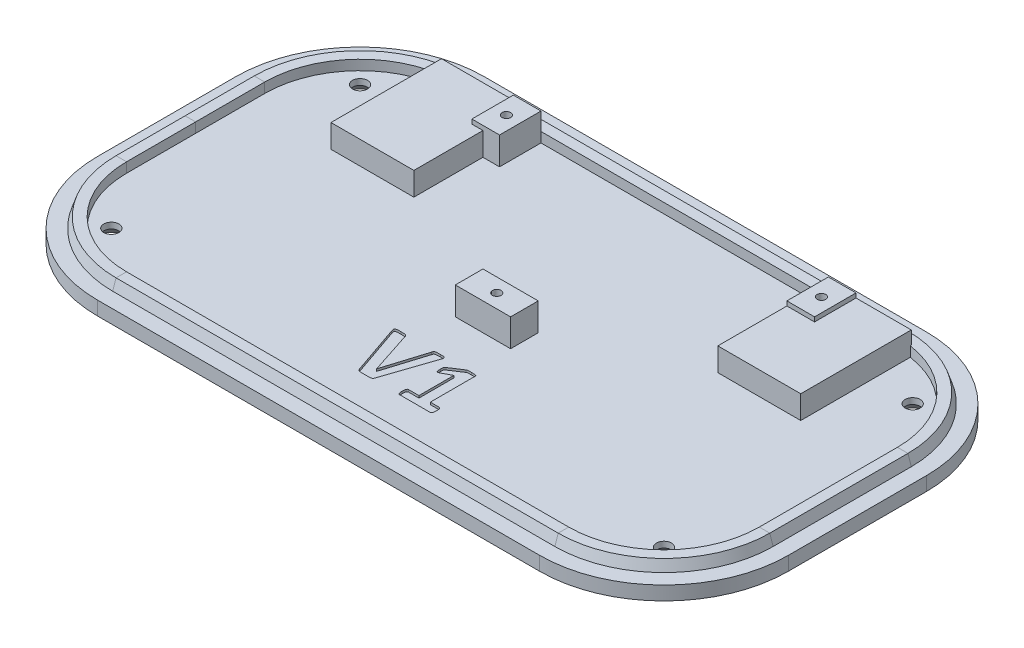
ISO-10303-21;
HEADER;
FILE_DESCRIPTION(('STEP AP214'),'2;1');
FILE_NAME('part.step','',(''),(''),'','','');
FILE_SCHEMA(('AUTOMOTIVE_DESIGN { 1 0 10303 214 1 1 1 1 }'));
ENDSEC;
DATA;
#1=APPLICATION_CONTEXT('core data for automotive mechanical design processes');
#2=APPLICATION_PROTOCOL_DEFINITION('international standard','automotive_design',2000,#1);
#3=PRODUCT_CONTEXT('',#1,'mechanical');
#4=PRODUCT('Part','Part','',(#3));
#5=PRODUCT_RELATED_PRODUCT_CATEGORY('part','',(#4));
#6=PRODUCT_DEFINITION_FORMATION('','',#4);
#7=PRODUCT_DEFINITION_CONTEXT('part definition',#1,'design');
#8=PRODUCT_DEFINITION('design','',#6,#7);
#9=PRODUCT_DEFINITION_SHAPE('','',#8);
#10=(LENGTH_UNIT() NAMED_UNIT(*) SI_UNIT(.MILLI.,.METRE.));
#11=(NAMED_UNIT(*) PLANE_ANGLE_UNIT() SI_UNIT($,.RADIAN.));
#12=(NAMED_UNIT(*) SI_UNIT($,.STERADIAN.) SOLID_ANGLE_UNIT());
#13=UNCERTAINTY_MEASURE_WITH_UNIT(LENGTH_MEASURE(1.E-05),#10,'distance_accuracy_value','');
#14=(GEOMETRIC_REPRESENTATION_CONTEXT(3) GLOBAL_UNCERTAINTY_ASSIGNED_CONTEXT((#13)) GLOBAL_UNIT_ASSIGNED_CONTEXT((#10,
#11,#12)) REPRESENTATION_CONTEXT('',''));
#15=CARTESIAN_POINT('',(0.,0.,0.));
#16=DIRECTION('',(0.,0.,1.));
#17=DIRECTION('',(1.,0.,0.));
#18=AXIS2_PLACEMENT_3D('',#15,#16,#17);
#19=CARTESIAN_POINT('',(0.,3.175,0.));
#20=DIRECTION('',(0.,1.,0.));
#21=DIRECTION('',(0.,0.,1.));
#22=AXIS2_PLACEMENT_3D('',#19,#20,#21);
#23=PLANE('',#22);
#24=CARTESIAN_POINT('',(63.5,3.175,-28.575));
#25=DIRECTION('',(0.,1.,0.));
#26=DIRECTION('',(0.,0.,1.));
#27=AXIS2_PLACEMENT_3D('',#24,#25,#26);
#28=CIRCLE('',#27,1.7272);
#29=CARTESIAN_POINT('',(63.5,3.175,-26.8478));
#30=VERTEX_POINT('',#29);
#31=EDGE_CURVE('E46',#30,#30,#28,.T.);
#32=ORIENTED_EDGE('',*,*,#31,.F.);
#33=EDGE_LOOP('',(#32));
#34=FACE_BOUND('',#33,.T.);
#35=CARTESIAN_POINT('',(63.5,3.175,28.575));
#36=DIRECTION('',(0.,1.,0.));
#37=DIRECTION('',(0.,0.,1.));
#38=AXIS2_PLACEMENT_3D('',#35,#36,#37);
#39=CIRCLE('',#38,1.7272);
#40=CARTESIAN_POINT('',(63.5,3.175,30.3022));
#41=VERTEX_POINT('',#40);
#42=EDGE_CURVE('E1030',#41,#41,#39,.T.);
#43=ORIENTED_EDGE('',*,*,#42,.F.);
#44=EDGE_LOOP('',(#43));
#45=FACE_BOUND('',#44,.T.);
#46=CARTESIAN_POINT('',(-63.5,3.175,28.575));
#47=DIRECTION('',(0.,1.,0.));
#48=DIRECTION('',(0.,0.,1.));
#49=AXIS2_PLACEMENT_3D('',#46,#47,#48);
#50=CIRCLE('',#49,1.7272);
#51=CARTESIAN_POINT('',(-63.5,3.175,30.3022));
#52=VERTEX_POINT('',#51);
#53=EDGE_CURVE('E1034',#52,#52,#50,.T.);
#54=ORIENTED_EDGE('',*,*,#53,.F.);
#55=EDGE_LOOP('',(#54));
#56=FACE_BOUND('',#55,.T.);
#57=CARTESIAN_POINT('',(-63.5,3.175,-28.575));
#58=DIRECTION('',(0.,1.,0.));
#59=DIRECTION('',(0.,0.,1.));
#60=AXIS2_PLACEMENT_3D('',#57,#58,#59);
#61=CIRCLE('',#60,1.7272);
#62=CARTESIAN_POINT('',(-63.5,3.175,-26.8478));
#63=VERTEX_POINT('',#62);
#64=EDGE_CURVE('E1038',#63,#63,#61,.T.);
#65=ORIENTED_EDGE('',*,*,#64,.F.);
#66=EDGE_LOOP('',(#65));
#67=FACE_BOUND('',#66,.T.);
#68=DIRECTION('',(-1.,0.,0.));
#69=VECTOR('',#68,1.);
#70=CARTESIAN_POINT('',(-31.1150000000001,3.175,-28.25));
#71=LINE('',#70,#69);
#72=CARTESIAN_POINT('',(-31.1150000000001,3.175,-28.25));
#73=VERTEX_POINT('',#72);
#74=CARTESIAN_POINT('',(-34.925,3.175,-28.25));
#75=VERTEX_POINT('',#74);
#76=EDGE_CURVE('E1042',#73,#75,#71,.T.);
#77=ORIENTED_EDGE('',*,*,#76,.T.);
#78=DIRECTION('',(0.,0.,-1.));
#79=VECTOR('',#78,1.);
#80=CARTESIAN_POINT('',(-34.925,3.175,0.));
#81=LINE('',#80,#79);
#82=CARTESIAN_POINT('',(-34.925,3.175,-12.375));
#83=VERTEX_POINT('',#82);
#84=EDGE_CURVE('E1479',#83,#75,#81,.T.);
#85=ORIENTED_EDGE('',*,*,#84,.F.);
#86=DIRECTION('',(1.,0.,0.));
#87=VECTOR('',#86,1.);
#88=CARTESIAN_POINT('',(0.,3.175,-12.375));
#89=LINE('',#88,#87);
#90=CARTESIAN_POINT('',(-53.975,3.175,-12.375));
#91=VERTEX_POINT('',#90);
#92=EDGE_CURVE('E1471',#91,#83,#89,.T.);
#93=ORIENTED_EDGE('',*,*,#92,.F.);
#94=DIRECTION('',(0.,0.,1.));
#95=VECTOR('',#94,1.);
#96=CARTESIAN_POINT('',(-53.975,3.175,0.));
#97=LINE('',#96,#95);
#98=CARTESIAN_POINT('',(-53.975,3.175,-37.5436265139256));
#99=VERTEX_POINT('',#98);
#100=EDGE_CURVE('E1475',#99,#91,#97,.T.);
#101=ORIENTED_EDGE('',*,*,#100,.F.);
#102=CARTESIAN_POINT('',(-50.8,3.175,-15.875));
#103=DIRECTION('',(0.,-1.,0.));
#104=DIRECTION('',(-1.,0.,0.));
#105=AXIS2_PLACEMENT_3D('',#102,#103,#104);
#106=CIRCLE('',#105,21.9);
#107=CARTESIAN_POINT('',(-72.7,3.175,-15.875));
#108=VERTEX_POINT('',#107);
#109=EDGE_CURVE('E1327',#108,#99,#106,.T.);
#110=ORIENTED_EDGE('',*,*,#109,.F.);
#111=DIRECTION('',(0.,0.,-1.));
#112=VECTOR('',#111,1.);
#113=CARTESIAN_POINT('',(-72.7,3.175,0.));
#114=LINE('',#113,#112);
#115=CARTESIAN_POINT('',(-72.7,3.175,0.));
#116=VERTEX_POINT('',#115);
#117=EDGE_CURVE('E1310',#116,#108,#114,.T.);
#118=ORIENTED_EDGE('',*,*,#117,.F.);
#119=DIRECTION('',(0.,0.,-1.));
#120=VECTOR('',#119,1.);
#121=CARTESIAN_POINT('',(-72.7,3.175,15.875));
#122=LINE('',#121,#120);
#123=CARTESIAN_POINT('',(-72.7,3.175,15.8750000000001));
#124=VERTEX_POINT('',#123);
#125=EDGE_CURVE('E1360',#124,#116,#122,.T.);
#126=ORIENTED_EDGE('',*,*,#125,.F.);
#127=CARTESIAN_POINT('',(-50.8,3.175,15.875));
#128=DIRECTION('',(0.,-1.,0.));
#129=DIRECTION('',(0.,0.,1.));
#130=AXIS2_PLACEMENT_3D('',#127,#128,#129);
#131=CIRCLE('',#130,21.9);
#132=CARTESIAN_POINT('',(-50.8,3.175,37.775));
#133=VERTEX_POINT('',#132);
#134=EDGE_CURVE('E1270',#133,#124,#131,.T.);
#135=ORIENTED_EDGE('',*,*,#134,.F.);
#136=DIRECTION('',(-1.,0.,0.));
#137=VECTOR('',#136,1.);
#138=CARTESIAN_POINT('',(50.7999999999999,3.175,37.775));
#139=LINE('',#138,#137);
#140=CARTESIAN_POINT('',(50.8,3.175,37.775));
#141=VERTEX_POINT('',#140);
#142=EDGE_CURVE('E1351',#141,#133,#139,.T.);
#143=ORIENTED_EDGE('',*,*,#142,.F.);
#144=CARTESIAN_POINT('',(50.8,3.175,15.875));
#145=DIRECTION('',(0.,-1.,0.));
#146=DIRECTION('',(1.,0.,0.));
#147=AXIS2_PLACEMENT_3D('',#144,#145,#146);
#148=CIRCLE('',#147,21.9);
#149=CARTESIAN_POINT('',(72.7,3.175,15.875));
#150=VERTEX_POINT('',#149);
#151=EDGE_CURVE('E1346',#150,#141,#148,.T.);
#152=ORIENTED_EDGE('',*,*,#151,.F.);
#153=DIRECTION('',(0.,0.,1.));
#154=VECTOR('',#153,1.);
#155=CARTESIAN_POINT('',(72.7,3.175,-15.875));
#156=LINE('',#155,#154);
#157=CARTESIAN_POINT('',(72.7,3.175,-15.875));
#158=VERTEX_POINT('',#157);
#159=EDGE_CURVE('E1285',#158,#150,#156,.T.);
#160=ORIENTED_EDGE('',*,*,#159,.F.);
#161=CARTESIAN_POINT('',(50.8,3.175,-15.875));
#162=DIRECTION('',(0.,-1.,0.));
#163=DIRECTION('',(0.,0.,-1.));
#164=AXIS2_PLACEMENT_3D('',#161,#162,#163);
#165=CIRCLE('',#164,21.9);
#166=CARTESIAN_POINT('',(53.9749999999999,3.175,-37.5436265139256));
#167=VERTEX_POINT('',#166);
#168=EDGE_CURVE('E1338',#167,#158,#165,.T.);
#169=ORIENTED_EDGE('',*,*,#168,.F.);
#170=DIRECTION('',(0.,0.,-1.));
#171=VECTOR('',#170,1.);
#172=CARTESIAN_POINT('',(53.9749999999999,3.175,0.));
#173=LINE('',#172,#171);
#174=CARTESIAN_POINT('',(53.9749999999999,3.175,-12.375));
#175=VERTEX_POINT('',#174);
#176=EDGE_CURVE('E1481',#175,#167,#173,.T.);
#177=ORIENTED_EDGE('',*,*,#176,.F.);
#178=DIRECTION('',(1.,0.,0.));
#179=VECTOR('',#178,1.);
#180=CARTESIAN_POINT('',(0.,3.175,-12.375));
#181=LINE('',#180,#179);
#182=CARTESIAN_POINT('',(34.9249999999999,3.175,-12.375));
#183=VERTEX_POINT('',#182);
#184=EDGE_CURVE('E52',#183,#175,#181,.T.);
#185=ORIENTED_EDGE('',*,*,#184,.F.);
#186=DIRECTION('',(0.,0.,1.));
#187=VECTOR('',#186,1.);
#188=CARTESIAN_POINT('',(34.9249999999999,3.175,0.));
#189=LINE('',#188,#187);
#190=CARTESIAN_POINT('',(34.9249999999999,3.175,-37.775));
#191=VERTEX_POINT('',#190);
#192=EDGE_CURVE('E11',#191,#183,#189,.T.);
#193=ORIENTED_EDGE('',*,*,#192,.F.);
#194=DIRECTION('',(1.,0.,0.));
#195=VECTOR('',#194,1.);
#196=CARTESIAN_POINT('',(-50.8,3.175,-37.775));
#197=LINE('',#196,#195);
#198=CARTESIAN_POINT('',(-31.1150000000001,3.175,-37.775));
#199=VERTEX_POINT('',#198);
#200=EDGE_CURVE('E1333',#199,#191,#197,.T.);
#201=ORIENTED_EDGE('',*,*,#200,.F.);
#202=DIRECTION('',(0.,0.,1.));
#203=VECTOR('',#202,1.);
#204=CARTESIAN_POINT('',(-31.1150000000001,3.175,-37.775));
#205=LINE('',#204,#203);
#206=EDGE_CURVE('E1550',#199,#73,#205,.T.);
#207=ORIENTED_EDGE('',*,*,#206,.T.);
#208=EDGE_LOOP('',(#77,#85,#93,#101,#110,#118,#126,#135,#143,#152,#160,#169,#177,#185,#193,#201,#207));
#209=FACE_BOUND('',#208,.T.);
#210=DIRECTION('',(1.,0.,0.));
#211=VECTOR('',#210,1.);
#212=CARTESIAN_POINT('',(-6.35,3.175,6.67500000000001));
#213=LINE('',#212,#211);
#214=CARTESIAN_POINT('',(-6.35,3.175,6.67500000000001));
#215=VERTEX_POINT('',#214);
#216=CARTESIAN_POINT('',(6.35,3.175,6.675));
#217=VERTEX_POINT('',#216);
#218=EDGE_CURVE('E1048',#215,#217,#213,.T.);
#219=ORIENTED_EDGE('',*,*,#218,.F.);
#220=DIRECTION('',(0.,0.,1.));
#221=VECTOR('',#220,1.);
#222=CARTESIAN_POINT('',(-6.35,3.175,0.325000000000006));
#223=LINE('',#222,#221);
#224=CARTESIAN_POINT('',(-6.35,3.175,0.325000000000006));
#225=VERTEX_POINT('',#224);
#226=EDGE_CURVE('E1573',#225,#215,#223,.T.);
#227=ORIENTED_EDGE('',*,*,#226,.F.);
#228=DIRECTION('',(-1.,0.,0.));
#229=VECTOR('',#228,1.);
#230=CARTESIAN_POINT('',(-6.35,3.175,0.325000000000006));
#231=LINE('',#230,#229);
#232=CARTESIAN_POINT('',(6.35,3.175,0.325000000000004));
#233=VERTEX_POINT('',#232);
#234=EDGE_CURVE('E1610',#233,#225,#231,.T.);
#235=ORIENTED_EDGE('',*,*,#234,.F.);
#236=DIRECTION('',(0.,0.,-1.));
#237=VECTOR('',#236,1.);
#238=CARTESIAN_POINT('',(6.35,3.175,0.325000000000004));
#239=LINE('',#238,#237);
#240=EDGE_CURVE('E1625',#217,#233,#239,.T.);
#241=ORIENTED_EDGE('',*,*,#240,.F.);
#242=EDGE_LOOP('',(#219,#227,#235,#241));
#243=FACE_BOUND('',#242,.T.);
#244=DIRECTION('',(1.,0.,0.));
#245=VECTOR('',#244,1.);
#246=CARTESIAN_POINT('',(7.75073529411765,3.175,26.5205882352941));
#247=LINE('',#246,#245);
#248=CARTESIAN_POINT('',(7.75073529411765,3.175,26.5205882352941));
#249=VERTEX_POINT('',#248);
#250=CARTESIAN_POINT('',(9.79055606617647,3.175,26.5205882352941));
#251=VERTEX_POINT('',#250);
#252=EDGE_CURVE('E644',#249,#251,#247,.T.);
#253=ORIENTED_EDGE('',*,*,#252,.T.);
#254=CARTESIAN_POINT('',(9.79055606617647,3.175,26.5205882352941));
#255=CARTESIAN_POINT('',(9.81925270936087,3.175,26.5235742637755));
#256=CARTESIAN_POINT('',(9.87674523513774,3.175,26.5295566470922));
#257=CARTESIAN_POINT('',(9.95811368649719,3.175,26.574622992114));
#258=CARTESIAN_POINT('',(10.0256229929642,3.175,26.6525639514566));
#259=CARTESIAN_POINT('',(10.0838167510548,3.175,26.7608868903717));
#260=CARTESIAN_POINT('',(10.1306199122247,3.175,26.9037220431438));
#261=CARTESIAN_POINT('',(10.1552225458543,3.175,27.0860943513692));
#262=CARTESIAN_POINT('',(10.1775810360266,3.175,27.3089284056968));
#263=CARTESIAN_POINT('',(10.1782893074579,3.175,27.4728050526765));
#264=CARTESIAN_POINT('',(10.1786764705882,3.175,27.5623851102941));
#265=B_SPLINE_CURVE_WITH_KNOTS('',3,(#254,#255,#256,#257,#258,#259,#260,#261,#262,#263,#264),
.UNSPECIFIED.,.F.,.F.,(4,1,1,1,1,1,1,1,4),(0.,0.0709336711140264,0.142112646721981,
0.223996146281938,0.323263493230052,0.445222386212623,0.59422092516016,0.778188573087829,1.),.UNSPECIFIED.);
#266=CARTESIAN_POINT('',(10.1786764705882,3.175,27.5623851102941));
#267=VERTEX_POINT('',#266);
#268=EDGE_CURVE('E68',#251,#267,#265,.T.);
#269=ORIENTED_EDGE('',*,*,#268,.T.);
#270=CARTESIAN_POINT('',(10.1786764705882,3.175,27.5623851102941));
#271=CARTESIAN_POINT('',(10.1784666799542,3.175,27.6500297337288));
#272=CARTESIAN_POINT('',(10.1780811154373,3.175,27.8111077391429));
#273=CARTESIAN_POINT('',(10.1533540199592,3.175,28.0313374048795));
#274=CARTESIAN_POINT('',(10.122000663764,3.175,28.2115738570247));
#275=CARTESIAN_POINT('',(10.0725246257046,3.175,28.3511323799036));
#276=CARTESIAN_POINT('',(10.0142992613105,3.175,28.4556464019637));
#277=CARTESIAN_POINT('',(9.94566933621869,3.175,28.5261695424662));
#278=CARTESIAN_POINT('',(9.86694675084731,3.175,28.5696985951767));
#279=CARTESIAN_POINT('',(9.81054208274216,3.175,28.5732105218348));
#280=CARTESIAN_POINT('',(9.78180147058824,3.175,28.575));
#281=B_SPLINE_CURVE_WITH_KNOTS('',3,(#270,#271,#272,#273,#274,#275,#276,#277,#278,#279,#280),
.UNSPECIFIED.,.F.,.F.,(4,1,1,1,1,1,1,1,4),(0.,0.221172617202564,0.406482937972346,
0.559224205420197,0.682018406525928,0.778932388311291,0.858846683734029,0.928076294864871,1.),.UNSPECIFIED.);
#282=CARTESIAN_POINT('',(9.78180147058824,3.175,28.575));
#283=VERTEX_POINT('',#282);
#284=EDGE_CURVE('E2103',#267,#283,#281,.T.);
#285=ORIENTED_EDGE('',*,*,#284,.T.);
#286=DIRECTION('',(-1.,0.,0.));
#287=VECTOR('',#286,1.);
#288=CARTESIAN_POINT('',(9.78180147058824,3.175,28.575));
#289=LINE('',#288,#287);
#290=CARTESIAN_POINT('',(2.71976102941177,3.175,28.575));
#291=VERTEX_POINT('',#290);
#292=EDGE_CURVE('E2096',#283,#291,#289,.T.);
#293=ORIENTED_EDGE('',*,*,#292,.T.);
#294=CARTESIAN_POINT('',(2.71976102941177,3.175,28.575));
#295=CARTESIAN_POINT('',(2.69406624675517,3.175,28.5727680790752));
#296=CARTESIAN_POINT('',(2.64084805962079,3.175,28.5681453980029));
#297=CARTESIAN_POINT('',(2.56477239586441,3.175,28.5270001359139));
#298=CARTESIAN_POINT('',(2.49923934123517,3.175,28.4544174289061));
#299=CARTESIAN_POINT('',(2.44043829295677,3.175,28.3513722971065));
#300=CARTESIAN_POINT('',(2.39150977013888,3.175,28.2114689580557));
#301=CARTESIAN_POINT('',(2.35890488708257,3.175,28.031551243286));
#302=CARTESIAN_POINT('',(2.33995459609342,3.175,27.8108326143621));
#303=CARTESIAN_POINT('',(2.33646109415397,3.175,27.6499748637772));
#304=CARTESIAN_POINT('',(2.33455882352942,3.175,27.5623851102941));
#305=B_SPLINE_CURVE_WITH_KNOTS('',3,(#294,#295,#296,#297,#298,#299,#300,#301,#302,#303,#304),
.UNSPECIFIED.,.F.,.F.,(4,1,1,1,1,1,1,1,4),(0.,0.0652293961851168,0.135100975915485,
0.214022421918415,0.311835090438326,0.435767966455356,0.589925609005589,0.776707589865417,1.),.UNSPECIFIED.);
#306=CARTESIAN_POINT('',(2.33455882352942,3.175,27.5623851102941));
#307=VERTEX_POINT('',#306);
#308=EDGE_CURVE('E2087',#291,#307,#305,.T.);
#309=ORIENTED_EDGE('',*,*,#308,.T.);
#310=CARTESIAN_POINT('',(2.33455882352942,3.175,27.5623851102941));
#311=CARTESIAN_POINT('',(2.33569940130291,3.175,27.4728991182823));
#312=CARTESIAN_POINT('',(2.33778490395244,3.175,27.3092774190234));
#313=CARTESIAN_POINT('',(2.35169666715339,3.175,27.0851251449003));
#314=CARTESIAN_POINT('',(2.38722499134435,3.175,26.9043615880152));
#315=CARTESIAN_POINT('',(2.43198508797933,3.175,26.7608264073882));
#316=CARTESIAN_POINT('',(2.49060006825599,3.175,26.6525759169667));
#317=CARTESIAN_POINT('',(2.55802526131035,3.175,26.5746204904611));
#318=CARTESIAN_POINT('',(2.63941166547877,3.175,26.529557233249));
#319=CARTESIAN_POINT('',(2.69690191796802,3.175,26.5235744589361));
#320=CARTESIAN_POINT('',(2.72559742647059,3.175,26.5205882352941));
#321=B_SPLINE_CURVE_WITH_KNOTS('',3,(#310,#311,#312,#313,#314,#315,#316,#317,#318,#319,#320),
.UNSPECIFIED.,.F.,.F.,(4,1,1,1,1,1,1,1,4),(0.,0.221667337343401,0.405310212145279,
0.5550668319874,0.676946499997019,0.776149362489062,0.857979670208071,0.929112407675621,1.),.UNSPECIFIED.);
#322=CARTESIAN_POINT('',(2.72559742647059,3.175,26.5205882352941));
#323=VERTEX_POINT('',#322);
#324=EDGE_CURVE('E2081',#307,#323,#321,.T.);
#325=ORIENTED_EDGE('',*,*,#324,.T.);
#326=DIRECTION('',(1.,0.,0.));
#327=VECTOR('',#326,1.);
#328=CARTESIAN_POINT('',(2.72559742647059,3.175,26.5205882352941));
#329=LINE('',#328,#327);
#330=CARTESIAN_POINT('',(5.13602941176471,3.175,26.5205882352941));
#331=VERTEX_POINT('',#330);
#332=EDGE_CURVE('E2077',#323,#331,#329,.T.);
#333=ORIENTED_EDGE('',*,*,#332,.T.);
#334=DIRECTION('',(0.,0.,-1.));
#335=VECTOR('',#334,1.);
#336=CARTESIAN_POINT('',(5.13602941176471,3.175,26.5205882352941));
#337=LINE('',#336,#335);
#338=CARTESIAN_POINT('',(5.13602941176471,3.175,18.4897058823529));
#339=VERTEX_POINT('',#338);
#340=EDGE_CURVE('E2074',#331,#339,#337,.T.);
#341=ORIENTED_EDGE('',*,*,#340,.T.);
#342=DIRECTION('',(-0.878465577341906,0.,0.477805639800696));
#343=VECTOR('',#342,1.);
#344=CARTESIAN_POINT('',(5.13602941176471,3.175,18.4897058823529));
#345=LINE('',#344,#343);
#346=CARTESIAN_POINT('',(3.07578125,3.175,19.6102941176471));
#347=VERTEX_POINT('',#346);
#348=EDGE_CURVE('E2067',#339,#347,#345,.T.);
#349=ORIENTED_EDGE('',*,*,#348,.T.);
#350=CARTESIAN_POINT('',(3.07578125,3.175,19.6102941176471));
#351=CARTESIAN_POINT('',(3.00727118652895,3.175,19.6407747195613));
#352=CARTESIAN_POINT('',(2.88699418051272,3.175,19.6942867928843));
#353=CARTESIAN_POINT('',(2.72080977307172,3.175,19.7492901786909));
#354=CARTESIAN_POINT('',(2.57951696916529,3.175,19.7537650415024));
#355=CARTESIAN_POINT('',(2.46269384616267,3.175,19.6895263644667));
#356=CARTESIAN_POINT('',(2.39522003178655,3.175,19.5558821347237));
#357=CARTESIAN_POINT('',(2.35469072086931,3.175,19.3687854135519));
#358=CARTESIAN_POINT('',(2.34046723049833,3.175,19.1094209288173));
#359=CARTESIAN_POINT('',(2.3367056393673,3.175,18.9118134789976));
#360=CARTESIAN_POINT('',(2.33455882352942,3.175,18.7990349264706));
#361=B_SPLINE_CURVE_WITH_KNOTS('',3,(#350,#351,#352,#353,#354,#355,#356,#357,#358,#359,#360),
.UNSPECIFIED.,.F.,.F.,(4,1,1,1,1,1,1,1,4),(0.,0.145138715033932,0.254807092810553,
0.337681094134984,0.411022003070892,0.498860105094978,0.61714574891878,0.781497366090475,1.),.UNSPECIFIED.);
#362=CARTESIAN_POINT('',(2.33455882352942,3.175,18.7990349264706));
#363=VERTEX_POINT('',#362);
#364=EDGE_CURVE('E2058',#347,#363,#361,.T.);
#365=ORIENTED_EDGE('',*,*,#364,.T.);
#366=CARTESIAN_POINT('',(2.33455882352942,3.175,18.7990349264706));
#367=CARTESIAN_POINT('',(2.33544019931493,3.175,18.7260773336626));
#368=CARTESIAN_POINT('',(2.3370270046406,3.175,18.5947264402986));
#369=CARTESIAN_POINT('',(2.34042519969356,3.175,18.4144276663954));
#370=CARTESIAN_POINT('',(2.35591801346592,3.175,18.2660659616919));
#371=CARTESIAN_POINT('',(2.3889403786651,3.175,18.1423658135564));
#372=CARTESIAN_POINT('',(2.43333530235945,3.175,18.038503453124));
#373=CARTESIAN_POINT('',(2.5008784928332,3.175,17.9539026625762));
#374=CARTESIAN_POINT('',(2.58774804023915,3.175,17.8790658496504));
#375=CARTESIAN_POINT('',(2.65410777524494,3.175,17.8324612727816));
#376=CARTESIAN_POINT('',(2.69057904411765,3.175,17.8068474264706));
#377=B_SPLINE_CURVE_WITH_KNOTS('',3,(#366,#367,#368,#369,#370,#371,#372,#373,#374,#375,#376),
.UNSPECIFIED.,.F.,.F.,(4,1,1,1,1,1,1,1,4),(0.,0.195391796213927,0.351778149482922,
0.482962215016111,0.593544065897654,0.69379397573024,0.782898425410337,0.880681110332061,1.),.UNSPECIFIED.);
#378=CARTESIAN_POINT('',(2.69057904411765,3.175,17.8068474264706));
#379=VERTEX_POINT('',#378);
#380=EDGE_CURVE('E2052',#363,#379,#377,.T.);
#381=ORIENTED_EDGE('',*,*,#380,.T.);
#382=DIRECTION('',(0.836531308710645,0.,-0.547919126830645));
#383=VECTOR('',#382,1.);
#384=CARTESIAN_POINT('',(2.69057904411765,3.175,17.8068474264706));
#385=LINE('',#384,#383);
#386=CARTESIAN_POINT('',(5.43952205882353,3.175,16.0063189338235));
#387=VERTEX_POINT('',#386);
#388=EDGE_CURVE('E2045',#379,#387,#385,.T.);
#389=ORIENTED_EDGE('',*,*,#388,.T.);
#390=CARTESIAN_POINT('',(5.43952205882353,3.175,16.0063189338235));
#391=CARTESIAN_POINT('',(5.45741025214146,3.175,15.9925636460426));
#392=CARTESIAN_POINT('',(5.49521486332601,3.175,15.9634934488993));
#393=CARTESIAN_POINT('',(5.57017675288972,3.175,15.9402311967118));
#394=CARTESIAN_POINT('',(5.65810691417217,3.175,15.9152382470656));
#395=CARTESIAN_POINT('',(5.77092494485,3.175,15.8994066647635));
#396=CARTESIAN_POINT('',(5.91181936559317,3.175,15.8831719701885));
#397=CARTESIAN_POINT('',(6.09228830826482,3.175,15.8814013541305));
#398=CARTESIAN_POINT('',(6.31879567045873,3.175,15.8727283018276));
#399=CARTESIAN_POINT('',(6.4871369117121,3.175,15.8741893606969));
#400=CARTESIAN_POINT('',(6.58053768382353,3.175,15.875));
#401=B_SPLINE_CURVE_WITH_KNOTS('',3,(#390,#391,#392,#393,#394,#395,#396,#397,#398,#399,#400),
.UNSPECIFIED.,.F.,.F.,(4,1,1,1,1,1,1,1,4),(0.,0.0577703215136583,0.122090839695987,
0.20000302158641,0.294063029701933,0.415165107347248,0.565811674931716,0.7590992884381,1.),.UNSPECIFIED.);
#402=CARTESIAN_POINT('',(6.58053768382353,3.175,15.875));
#403=VERTEX_POINT('',#402);
#404=EDGE_CURVE('E2037',#387,#403,#401,.T.);
#405=ORIENTED_EDGE('',*,*,#404,.T.);
#406=CARTESIAN_POINT('',(6.58053768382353,3.175,15.875));
#407=CARTESIAN_POINT('',(6.69535327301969,3.175,15.8751059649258));
#408=CARTESIAN_POINT('',(6.89976745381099,3.175,15.8752946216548));
#409=CARTESIAN_POINT('',(7.17317623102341,3.175,15.8865885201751));
#410=CARTESIAN_POINT('',(7.38256825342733,3.175,15.9042412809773));
#411=CARTESIAN_POINT('',(7.53543173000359,3.175,15.9337127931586));
#412=CARTESIAN_POINT('',(7.64609896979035,3.175,15.9658024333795));
#413=CARTESIAN_POINT('',(7.71221835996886,3.175,16.0249496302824));
#414=CARTESIAN_POINT('',(7.74851432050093,3.175,16.0959901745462));
#415=CARTESIAN_POINT('',(7.74996236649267,3.175,16.1478780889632));
#416=CARTESIAN_POINT('',(7.75073529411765,3.175,16.1755744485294));
#417=B_SPLINE_CURVE_WITH_KNOTS('',3,(#406,#407,#408,#409,#410,#411,#412,#413,#414,#415,#416),
.UNSPECIFIED.,.F.,.F.,(4,1,1,1,1,1,1,1,4),(0.,0.26199462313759,0.466447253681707,
0.624846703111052,0.740233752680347,0.823128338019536,0.882868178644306,0.937478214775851,1.),.UNSPECIFIED.);
#418=CARTESIAN_POINT('',(7.75073529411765,3.175,16.1755744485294));
#419=VERTEX_POINT('',#418);
#420=EDGE_CURVE('E2031',#403,#419,#417,.T.);
#421=ORIENTED_EDGE('',*,*,#420,.T.);
#422=DIRECTION('',(0.,0.,1.));
#423=VECTOR('',#422,1.);
#424=CARTESIAN_POINT('',(7.75073529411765,3.175,16.1755744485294));
#425=LINE('',#424,#423);
#426=EDGE_CURVE('E2028',#419,#249,#425,.T.);
#427=ORIENTED_EDGE('',*,*,#426,.T.);
#428=EDGE_LOOP('',(#253,#269,#285,#293,#309,#325,#333,#341,#349,#365,#381,#389,#405,#421,#427));
#429=FACE_BOUND('',#428,.T.);
#430=CARTESIAN_POINT('',(-0.595312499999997,3.175,15.875));
#431=CARTESIAN_POINT('',(-0.523345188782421,3.175,15.876279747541));
#432=CARTESIAN_POINT('',(-0.387189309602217,3.175,15.8787009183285));
#433=CARTESIAN_POINT('',(-0.196213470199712,3.175,15.8774742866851));
#434=CARTESIAN_POINT('',(-0.0311383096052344,3.175,15.8927575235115));
#435=CARTESIAN_POINT('',(0.110572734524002,3.175,15.9011950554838));
#436=CARTESIAN_POINT('',(0.230144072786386,3.175,15.9209104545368));
#437=CARTESIAN_POINT('',(0.329754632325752,3.175,15.9498455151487));
#438=CARTESIAN_POINT('',(0.410540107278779,3.175,15.9887090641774));
#439=CARTESIAN_POINT('',(0.487000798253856,3.175,16.0614900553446));
#440=CARTESIAN_POINT('',(0.544316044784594,3.175,16.1907480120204));
#441=CARTESIAN_POINT('',(0.52698564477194,3.175,16.3843025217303));
#442=CARTESIAN_POINT('',(0.469999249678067,3.175,16.6254008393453));
#443=CARTESIAN_POINT('',(0.408586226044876,3.175,16.8034735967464));
#444=CARTESIAN_POINT('',(0.373529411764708,3.175,16.9051240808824));
#445=B_SPLINE_CURVE_WITH_KNOTS('',3,(#430,#431,#432,#433,#434,#435,#436,#437,#438,#439,#440,
#441,#442,#443,#444),.UNSPECIFIED.,.F.,.F.,(4,1,1,1,1,1,1,1,1,1,1,1,4),(0.,0.108370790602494,
0.20502808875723,0.287239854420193,0.357771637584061,0.418678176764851,0.469171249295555,
0.513707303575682,0.552032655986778,0.62607944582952,0.716880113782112,0.838384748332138,1.),.UNSPECIFIED.);
#446=CARTESIAN_POINT('',(-0.595312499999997,3.175,15.875));
#447=VERTEX_POINT('',#446);
#448=CARTESIAN_POINT('',(0.373529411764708,3.175,16.9051240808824));
#449=VERTEX_POINT('',#448);
#450=EDGE_CURVE('E616',#447,#449,#445,.T.);
#451=ORIENTED_EDGE('',*,*,#450,.T.);
#452=DIRECTION('',(-0.321272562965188,0.,0.946986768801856));
#453=VECTOR('',#452,1.);
#454=CARTESIAN_POINT('',(0.373529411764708,3.175,16.9051240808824));
#455=LINE('',#454,#453);
#456=CARTESIAN_POINT('',(-3.41429227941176,3.175,28.0701516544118));
#457=VERTEX_POINT('',#456);
#458=EDGE_CURVE('E60',#449,#457,#455,.T.);
#459=ORIENTED_EDGE('',*,*,#458,.T.);
#460=CARTESIAN_POINT('',(-3.41429227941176,3.175,28.0701516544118));
#461=CARTESIAN_POINT('',(-3.43077213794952,3.175,28.1205784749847));
#462=CARTESIAN_POINT('',(-3.46153521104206,3.175,28.2147105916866));
#463=CARTESIAN_POINT('',(-3.53701675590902,3.175,28.3396851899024));
#464=CARTESIAN_POINT('',(-3.64919986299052,3.175,28.4397721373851));
#465=CARTESIAN_POINT('',(-3.8130758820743,3.175,28.5033672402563));
#466=CARTESIAN_POINT('',(-4.02996592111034,3.175,28.5446776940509));
#467=CARTESIAN_POINT('',(-4.2486334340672,3.175,28.560089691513));
#468=CARTESIAN_POINT('',(-4.45899288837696,3.175,28.5663633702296));
#469=CARTESIAN_POINT('',(-4.64670231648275,3.175,28.573023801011));
#470=CARTESIAN_POINT('',(-4.85879351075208,3.175,28.5755901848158));
#471=CARTESIAN_POINT('',(-5.00762857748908,3.175,28.5752042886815));
#472=CARTESIAN_POINT('',(-5.0864200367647,3.175,28.575));
#473=B_SPLINE_CURVE_WITH_KNOTS('',3,(#460,#461,#462,#463,#464,#465,#466,#467,#468,#469,#470,
#471,#472),.UNSPECIFIED.,.F.,.F.,(4,1,1,1,1,1,1,1,1,1,4),(0.,0.0838483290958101,
0.156520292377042,0.2285525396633,0.317563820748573,0.430871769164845,0.577750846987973,
0.664081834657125,0.764270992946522,0.875207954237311,1.),.UNSPECIFIED.);
#474=CARTESIAN_POINT('',(-5.0864200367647,3.175,28.575));
#475=VERTEX_POINT('',#474);
#476=EDGE_CURVE('E620',#457,#475,#473,.T.);
#477=ORIENTED_EDGE('',*,*,#476,.T.);
#478=CARTESIAN_POINT('',(-5.0864200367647,3.175,28.575));
#479=CARTESIAN_POINT('',(-5.20898301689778,3.175,28.5751759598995));
#480=CARTESIAN_POINT('',(-5.43563180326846,3.175,28.5755013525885));
#481=CARTESIAN_POINT('',(-5.74989351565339,3.175,28.573449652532));
#482=CARTESIAN_POINT('',(-6.01465257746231,3.175,28.5658149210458));
#483=CARTESIAN_POINT('',(-6.23506800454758,3.175,28.5498643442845));
#484=CARTESIAN_POINT('',(-6.41502041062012,3.175,28.5227217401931));
#485=CARTESIAN_POINT('',(-6.56212200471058,3.175,28.493613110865));
#486=CARTESIAN_POINT('',(-6.67909271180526,3.175,28.4478105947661));
#487=CARTESIAN_POINT('',(-6.77553571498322,3.175,28.3963388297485));
#488=CARTESIAN_POINT('',(-6.85084638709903,3.175,28.3300915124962));
#489=CARTESIAN_POINT('',(-6.90992135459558,3.175,28.2495653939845));
#490=CARTESIAN_POINT('',(-6.95112950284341,3.175,28.1503579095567));
#491=CARTESIAN_POINT('',(-6.97588251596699,3.175,28.0790202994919));
#492=CARTESIAN_POINT('',(-6.98908547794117,3.175,28.0409696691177));
#493=B_SPLINE_CURVE_WITH_KNOTS('',3,(#478,#479,#480,#481,#482,#483,#484,#485,#486,#487,#488,
#489,#490,#491,#492),.UNSPECIFIED.,.F.,.F.,(4,1,1,1,1,1,1,1,1,1,1,1,4),(0.,0.172163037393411,
0.318371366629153,0.441413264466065,0.544218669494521,0.628469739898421,0.697088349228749,
0.754182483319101,0.804349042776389,0.849851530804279,0.893852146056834,0.943382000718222,1.),.UNSPECIFIED.);
#494=CARTESIAN_POINT('',(-6.98908547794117,3.175,28.0409696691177));
#495=VERTEX_POINT('',#494);
#496=EDGE_CURVE('E1107',#475,#495,#493,.T.);
#497=ORIENTED_EDGE('',*,*,#496,.T.);
#498=DIRECTION('',(-0.325784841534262,0.,-0.94544393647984));
#499=VECTOR('',#498,1.);
#500=CARTESIAN_POINT('',(-6.98908547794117,3.175,28.0409696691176));
#501=LINE('',#500,#499);
#502=CARTESIAN_POINT('',(-10.8323529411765,3.175,16.8876148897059));
#503=VERTEX_POINT('',#502);
#504=EDGE_CURVE('E1110',#495,#503,#501,.T.);
#505=ORIENTED_EDGE('',*,*,#504,.T.);
#506=CARTESIAN_POINT('',(-10.8323529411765,3.175,16.8876148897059));
#507=CARTESIAN_POINT('',(-10.8499040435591,3.175,16.8321929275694));
#508=CARTESIAN_POINT('',(-10.8830641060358,3.175,16.7274817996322));
#509=CARTESIAN_POINT('',(-10.9288448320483,3.175,16.5805774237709));
#510=CARTESIAN_POINT('',(-10.9565061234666,3.175,16.450188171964));
#511=CARTESIAN_POINT('',(-10.980192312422,3.175,16.3391459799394));
#512=CARTESIAN_POINT('',(-10.9857566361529,3.175,16.2406963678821));
#513=CARTESIAN_POINT('',(-10.9666444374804,3.175,16.1565485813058));
#514=CARTESIAN_POINT('',(-10.9351772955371,3.175,16.0822763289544));
#515=CARTESIAN_POINT('',(-10.8791883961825,3.175,16.0221299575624));
#516=CARTESIAN_POINT('',(-10.802870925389,3.175,15.9743448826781));
#517=CARTESIAN_POINT('',(-10.7046880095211,3.175,15.94162178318));
#518=CARTESIAN_POINT('',(-10.5873209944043,3.175,15.9155792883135));
#519=CARTESIAN_POINT('',(-10.4474987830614,3.175,15.8991444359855));
#520=CARTESIAN_POINT('',(-10.2828791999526,3.175,15.8886416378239));
#521=CARTESIAN_POINT('',(-10.0892913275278,3.175,15.8788892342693));
#522=CARTESIAN_POINT('',(-9.86641784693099,3.175,15.8782749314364));
#523=CARTESIAN_POINT('',(-9.70786941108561,3.175,15.8761310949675));
#524=CARTESIAN_POINT('',(-9.62421875,3.175,15.875));
#525=B_SPLINE_CURVE_WITH_KNOTS('',3,(#506,#507,#508,#509,#510,#511,#512,#513,#514,#515,#516,
#517,#518,#519,#520,#521,#522,#523,#524),.UNSPECIFIED.,.F.,.F.,(4,1,1,1,1,1,1,1,1,1,1,1,1,1,1,1,
4),(0.,0.0796935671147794,0.150568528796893,0.210726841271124,0.26224219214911,
0.306259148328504,0.344437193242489,0.37963561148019,0.415509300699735,0.455081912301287,
0.501897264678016,0.556559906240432,0.619730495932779,0.694581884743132,0.782666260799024,
0.885334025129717,1.),.UNSPECIFIED.);
#526=CARTESIAN_POINT('',(-9.62421875,3.175,15.875));
#527=VERTEX_POINT('',#526);
#528=EDGE_CURVE('E1116',#503,#527,#525,.T.);
#529=ORIENTED_EDGE('',*,*,#528,.T.);
#530=CARTESIAN_POINT('',(-9.62421875,3.175,15.875));
#531=CARTESIAN_POINT('',(-9.55222537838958,3.175,15.8743571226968));
#532=CARTESIAN_POINT('',(-9.41696465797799,3.175,15.8731492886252));
#533=CARTESIAN_POINT('',(-9.22638183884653,3.175,15.8810465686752));
#534=CARTESIAN_POINT('',(-9.060879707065,3.175,15.8852863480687));
#535=CARTESIAN_POINT('',(-8.88170430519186,3.175,15.8968305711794));
#536=CARTESIAN_POINT('',(-8.70077959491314,3.175,15.9142456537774));
#537=CARTESIAN_POINT('',(-8.52616505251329,3.175,15.9536252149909));
#538=CARTESIAN_POINT('',(-8.39542172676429,3.175,16.0112600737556));
#539=CARTESIAN_POINT('',(-8.31707351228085,3.175,16.1092410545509));
#540=CARTESIAN_POINT('',(-8.26197294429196,3.175,16.2220826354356));
#541=CARTESIAN_POINT('',(-8.23321017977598,3.175,16.3055197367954));
#542=CARTESIAN_POINT('',(-8.21764705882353,3.175,16.3506663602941));
#543=B_SPLINE_CURVE_WITH_KNOTS('',3,(#530,#531,#532,#533,#534,#535,#536,#537,#538,#539,#540,
#541,#542),.UNSPECIFIED.,.F.,.F.,(4,1,1,1,1,1,1,1,1,1,4),(0.,0.132770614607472,
0.249448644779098,0.351780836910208,0.438070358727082,0.580728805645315,0.686037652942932,
0.768687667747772,0.83738458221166,0.912011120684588,1.),.UNSPECIFIED.);
#544=CARTESIAN_POINT('',(-8.21764705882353,3.175,16.3506663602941));
#545=VERTEX_POINT('',#544);
#546=EDGE_CURVE('E1137',#527,#545,#543,.T.);
#547=ORIENTED_EDGE('',*,*,#546,.T.);
#548=DIRECTION('',(0.310132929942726,0.,0.950693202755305));
#549=VECTOR('',#548,1.);
#550=CARTESIAN_POINT('',(-8.21764705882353,3.175,16.3506663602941));
#551=LINE('',#550,#549);
#552=CARTESIAN_POINT('',(-5.05140165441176,3.175,26.0565946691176));
#553=VERTEX_POINT('',#552);
#554=EDGE_CURVE('E1146',#545,#553,#551,.T.);
#555=ORIENTED_EDGE('',*,*,#554,.T.);
#556=DIRECTION('',(1.,0.,0.));
#557=VECTOR('',#556,1.);
#558=CARTESIAN_POINT('',(-5.05140165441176,3.175,26.0565946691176));
#559=LINE('',#558,#557);
#560=CARTESIAN_POINT('',(-5.04264705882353,3.175,26.0565946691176));
#561=VERTEX_POINT('',#560);
#562=EDGE_CURVE('E1153',#553,#561,#559,.T.);
#563=ORIENTED_EDGE('',*,*,#562,.T.);
#564=DIRECTION('',(0.295627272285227,0.,-0.955303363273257));
#565=VECTOR('',#564,1.);
#566=CARTESIAN_POINT('',(-5.04264705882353,3.175,26.0565946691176));
#567=LINE('',#566,#565);
#568=CARTESIAN_POINT('',(-2.05441176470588,3.175,16.4002757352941));
#569=VERTEX_POINT('',#568);
#570=EDGE_CURVE('E1064',#561,#569,#567,.T.);
#571=ORIENTED_EDGE('',*,*,#570,.T.);
#572=CARTESIAN_POINT('',(-2.05441176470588,3.175,16.4002757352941));
#573=CARTESIAN_POINT('',(-2.03974335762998,3.175,16.3495202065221));
#574=CARTESIAN_POINT('',(-2.0132489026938,3.175,16.257844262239));
#575=CARTESIAN_POINT('',(-1.96300417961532,3.175,16.1296167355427));
#576=CARTESIAN_POINT('',(-1.87280528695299,3.175,16.0313598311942));
#577=CARTESIAN_POINT('',(-1.73966248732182,3.175,15.9595703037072));
#578=CARTESIAN_POINT('',(-1.55624966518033,3.175,15.9128796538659));
#579=CARTESIAN_POINT('',(-1.36605540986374,3.175,15.8968017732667));
#580=CARTESIAN_POINT('',(-1.1800358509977,3.175,15.8853651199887));
#581=CARTESIAN_POINT('',(-1.00677197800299,3.175,15.8809970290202));
#582=CARTESIAN_POINT('',(-0.809371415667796,3.175,15.8731958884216));
#583=CARTESIAN_POINT('',(-0.669250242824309,3.175,15.8743768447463));
#584=CARTESIAN_POINT('',(-0.595312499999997,3.175,15.875));
#585=B_SPLINE_CURVE_WITH_KNOTS('',3,(#572,#573,#574,#575,#576,#577,#578,#579,#580,#581,#582,
#583,#584),.UNSPECIFIED.,.F.,.F.,(4,1,1,1,1,1,1,1,1,1,4),(0.,0.0926230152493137,
0.167298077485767,0.238414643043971,0.320767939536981,0.428574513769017,0.56732116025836,
0.654295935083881,0.754797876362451,0.870614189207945,1.),.UNSPECIFIED.);
#586=EDGE_CURVE('E1058',#569,#447,#585,.T.);
#587=ORIENTED_EDGE('',*,*,#586,.T.);
#588=EDGE_LOOP('',(#451,#459,#477,#497,#505,#529,#547,#555,#563,#571,#587));
#589=FACE_BOUND('',#588,.T.);
#590=ADVANCED_FACE('F42',(#34,#45,#56,#67,#209,#243,#429,#589),#23,.T.);
#591=CARTESIAN_POINT('',(0.,0.,0.));
#592=DIRECTION('',(0.,1.,0.));
#593=DIRECTION('',(0.,0.,1.));
#594=AXIS2_PLACEMENT_3D('',#591,#592,#593);
#595=PLANE('',#594);
#596=CARTESIAN_POINT('',(63.5,0.,-28.575));
#597=DIRECTION('',(0.,-1.,0.));
#598=DIRECTION('',(0.,0.,-1.));
#599=AXIS2_PLACEMENT_3D('',#596,#597,#598);
#600=CIRCLE('',#599,3.29909170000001);
#601=CARTESIAN_POINT('',(63.5,0.,-31.8740917));
#602=VERTEX_POINT('',#601);
#603=EDGE_CURVE('E622',#602,#602,#600,.T.);
#604=ORIENTED_EDGE('',*,*,#603,.F.);
#605=EDGE_LOOP('',(#604));
#606=FACE_BOUND('',#605,.T.);
#607=DIRECTION('',(0.,0.,1.));
#608=VECTOR('',#607,1.);
#609=CARTESIAN_POINT('',(-79.375,0.,-44.45));
#610=LINE('',#609,#608);
#611=CARTESIAN_POINT('',(-79.375,0.,-15.875));
#612=VERTEX_POINT('',#611);
#613=CARTESIAN_POINT('',(-79.375,0.,15.875));
#614=VERTEX_POINT('',#613);
#615=EDGE_CURVE('E1364',#612,#614,#610,.T.);
#616=ORIENTED_EDGE('',*,*,#615,.F.);
#617=CARTESIAN_POINT('',(-50.8,0.,-15.875));
#618=DIRECTION('',(0.,1.,0.));
#619=DIRECTION('',(0.,0.,1.));
#620=AXIS2_PLACEMENT_3D('',#617,#618,#619);
#621=CIRCLE('',#620,28.575);
#622=CARTESIAN_POINT('',(-50.8,0.,-44.45));
#623=VERTEX_POINT('',#622);
#624=EDGE_CURVE('E1436',#612,#623,#621,.F.);
#625=ORIENTED_EDGE('',*,*,#624,.T.);
#626=DIRECTION('',(-1.,0.,0.));
#627=VECTOR('',#626,1.);
#628=CARTESIAN_POINT('',(-79.375,0.,-44.45));
#629=LINE('',#628,#627);
#630=CARTESIAN_POINT('',(50.7999999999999,0.,-44.45));
#631=VERTEX_POINT('',#630);
#632=EDGE_CURVE('E1394',#631,#623,#629,.T.);
#633=ORIENTED_EDGE('',*,*,#632,.F.);
#634=CARTESIAN_POINT('',(50.8,0.,-15.875));
#635=DIRECTION('',(0.,1.,0.));
#636=DIRECTION('',(0.,0.,1.));
#637=AXIS2_PLACEMENT_3D('',#634,#635,#636);
#638=CIRCLE('',#637,28.575);
#639=CARTESIAN_POINT('',(79.375,0.,-15.875));
#640=VERTEX_POINT('',#639);
#641=EDGE_CURVE('E1430',#631,#640,#638,.F.);
#642=ORIENTED_EDGE('',*,*,#641,.T.);
#643=DIRECTION('',(0.,0.,-1.));
#644=VECTOR('',#643,1.);
#645=CARTESIAN_POINT('',(79.375,0.,-44.45));
#646=LINE('',#645,#644);
#647=CARTESIAN_POINT('',(79.375,0.,15.875));
#648=VERTEX_POINT('',#647);
#649=EDGE_CURVE('E1414',#648,#640,#646,.T.);
#650=ORIENTED_EDGE('',*,*,#649,.F.);
#651=CARTESIAN_POINT('',(50.8,0.,15.875));
#652=DIRECTION('',(0.,1.,0.));
#653=DIRECTION('',(0.,0.,1.));
#654=AXIS2_PLACEMENT_3D('',#651,#652,#653);
#655=CIRCLE('',#654,28.575);
#656=CARTESIAN_POINT('',(50.7999999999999,0.,44.45));
#657=VERTEX_POINT('',#656);
#658=EDGE_CURVE('E1427',#648,#657,#655,.F.);
#659=ORIENTED_EDGE('',*,*,#658,.T.);
#660=DIRECTION('',(1.,0.,0.));
#661=VECTOR('',#660,1.);
#662=CARTESIAN_POINT('',(-79.375,0.,44.45));
#663=LINE('',#662,#661);
#664=CARTESIAN_POINT('',(-50.8,0.,44.45));
#665=VERTEX_POINT('',#664);
#666=EDGE_CURVE('E1410',#665,#657,#663,.T.);
#667=ORIENTED_EDGE('',*,*,#666,.F.);
#668=CARTESIAN_POINT('',(-50.8,0.,15.875));
#669=DIRECTION('',(0.,1.,0.));
#670=DIRECTION('',(0.,0.,1.));
#671=AXIS2_PLACEMENT_3D('',#668,#669,#670);
#672=CIRCLE('',#671,28.575);
#673=EDGE_CURVE('E1433',#665,#614,#672,.F.);
#674=ORIENTED_EDGE('',*,*,#673,.T.);
#675=EDGE_LOOP('',(#616,#625,#633,#642,#650,#659,#667,#674));
#676=FACE_BOUND('',#675,.T.);
#677=DIRECTION('',(0.,0.,-1.));
#678=VECTOR('',#677,1.);
#679=CARTESIAN_POINT('',(42.2274999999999,0.,-29.52));
#680=LINE('',#679,#678);
#681=CARTESIAN_POINT('',(42.2274999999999,0.,-25.1980295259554));
#682=VERTEX_POINT('',#681);
#683=CARTESIAN_POINT('',(42.2274999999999,0.,-29.52));
#684=VERTEX_POINT('',#683);
#685=EDGE_CURVE('E1308',#682,#684,#680,.T.);
#686=ORIENTED_EDGE('',*,*,#685,.F.);
#687=CARTESIAN_POINT('',(44.4499999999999,0.,-20.63));
#688=DIRECTION('',(0.,-1.,0.));
#689=DIRECTION('',(0.,0.,1.));
#690=AXIS2_PLACEMENT_3D('',#687,#688,#689);
#691=CIRCLE('',#690,5.08);
#692=CARTESIAN_POINT('',(46.6724999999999,0.,-25.1980295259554));
#693=VERTEX_POINT('',#692);
#694=EDGE_CURVE('E1670',#693,#682,#691,.T.);
#695=ORIENTED_EDGE('',*,*,#694,.F.);
#696=DIRECTION('',(0.,0.,1.));
#697=VECTOR('',#696,1.);
#698=CARTESIAN_POINT('',(46.6724999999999,0.,-29.52));
#699=LINE('',#698,#697);
#700=CARTESIAN_POINT('',(46.6724999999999,0.,-29.52));
#701=VERTEX_POINT('',#700);
#702=EDGE_CURVE('E1307',#701,#693,#699,.T.);
#703=ORIENTED_EDGE('',*,*,#702,.F.);
#704=CARTESIAN_POINT('',(44.4499999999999,0.,-29.52));
#705=DIRECTION('',(0.,-1.,0.));
#706=DIRECTION('',(0.,0.,-1.));
#707=AXIS2_PLACEMENT_3D('',#704,#705,#706);
#708=CIRCLE('',#707,2.2225);
#709=EDGE_CURVE('E1304',#684,#701,#708,.T.);
#710=ORIENTED_EDGE('',*,*,#709,.F.);
#711=EDGE_LOOP('',(#686,#695,#703,#710));
#712=FACE_BOUND('',#711,.T.);
#713=DIRECTION('',(0.,0.,1.));
#714=VECTOR('',#713,1.);
#715=CARTESIAN_POINT('',(-42.2275,0.,-29.52));
#716=LINE('',#715,#714);
#717=CARTESIAN_POINT('',(-42.2275,0.,-29.52));
#718=VERTEX_POINT('',#717);
#719=CARTESIAN_POINT('',(-42.2275,0.,-25.1980295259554));
#720=VERTEX_POINT('',#719);
#721=EDGE_CURVE('E1301',#718,#720,#716,.T.);
#722=ORIENTED_EDGE('',*,*,#721,.F.);
#723=CARTESIAN_POINT('',(-44.45,0.,-29.52));
#724=DIRECTION('',(0.,-1.,0.));
#725=DIRECTION('',(0.,0.,1.));
#726=AXIS2_PLACEMENT_3D('',#723,#724,#725);
#727=CIRCLE('',#726,2.2225);
#728=CARTESIAN_POINT('',(-46.6725,0.,-29.52));
#729=VERTEX_POINT('',#728);
#730=EDGE_CURVE('E1299',#729,#718,#727,.T.);
#731=ORIENTED_EDGE('',*,*,#730,.F.);
#732=DIRECTION('',(0.,0.,-1.));
#733=VECTOR('',#732,1.);
#734=CARTESIAN_POINT('',(-46.6725,0.,-29.52));
#735=LINE('',#734,#733);
#736=CARTESIAN_POINT('',(-46.6725,0.,-25.1980295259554));
#737=VERTEX_POINT('',#736);
#738=EDGE_CURVE('E1715',#737,#729,#735,.T.);
#739=ORIENTED_EDGE('',*,*,#738,.F.);
#740=CARTESIAN_POINT('',(-44.45,0.,-20.63));
#741=DIRECTION('',(0.,-1.,0.));
#742=DIRECTION('',(0.,0.,-1.));
#743=AXIS2_PLACEMENT_3D('',#740,#741,#742);
#744=CIRCLE('',#743,5.08);
#745=EDGE_CURVE('E1729',#720,#737,#744,.T.);
#746=ORIENTED_EDGE('',*,*,#745,.F.);
#747=EDGE_LOOP('',(#722,#731,#739,#746));
#748=FACE_BOUND('',#747,.T.);
#749=CARTESIAN_POINT('',(-63.5,0.,-28.575));
#750=DIRECTION('',(0.,-1.,0.));
#751=DIRECTION('',(0.,0.,-1.));
#752=AXIS2_PLACEMENT_3D('',#749,#750,#751);
#753=CIRCLE('',#752,3.2990917);
#754=CARTESIAN_POINT('',(-63.5,0.,-31.8740917));
#755=VERTEX_POINT('',#754);
#756=EDGE_CURVE('E1294',#755,#755,#753,.T.);
#757=ORIENTED_EDGE('',*,*,#756,.F.);
#758=EDGE_LOOP('',(#757));
#759=FACE_BOUND('',#758,.T.);
#760=CARTESIAN_POINT('',(-63.5,0.,28.575));
#761=DIRECTION('',(0.,-1.,0.));
#762=DIRECTION('',(0.,0.,-1.));
#763=AXIS2_PLACEMENT_3D('',#760,#761,#762);
#764=CIRCLE('',#763,3.2990917);
#765=CARTESIAN_POINT('',(-63.5,0.,25.2759083));
#766=VERTEX_POINT('',#765);
#767=EDGE_CURVE('E1493',#766,#766,#764,.T.);
#768=ORIENTED_EDGE('',*,*,#767,.F.);
#769=EDGE_LOOP('',(#768));
#770=FACE_BOUND('',#769,.T.);
#771=CARTESIAN_POINT('',(63.5,0.,28.575));
#772=DIRECTION('',(0.,-1.,0.));
#773=DIRECTION('',(0.,0.,-1.));
#774=AXIS2_PLACEMENT_3D('',#771,#772,#773);
#775=CIRCLE('',#774,3.29909170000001);
#776=CARTESIAN_POINT('',(63.5,0.,25.2759083));
#777=VERTEX_POINT('',#776);
#778=EDGE_CURVE('E1242',#777,#777,#775,.T.);
#779=ORIENTED_EDGE('',*,*,#778,.F.);
#780=EDGE_LOOP('',(#779));
#781=FACE_BOUND('',#780,.T.);
#782=ADVANCED_FACE('F840',(#606,#676,#712,#748,#759,#770,#781),#595,.F.);
#783=CARTESIAN_POINT('',(0.,8.509,0.));
#784=DIRECTION('',(0.,-1.,0.));
#785=DIRECTION('',(0.,0.,-1.));
#786=AXIS2_PLACEMENT_3D('',#783,#784,#785);
#787=PLANE('',#786);
#788=DIRECTION('',(0.,0.,-1.));
#789=VECTOR('',#788,1.);
#790=CARTESIAN_POINT('',(41.2749999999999,8.509,-37.775));
#791=LINE('',#790,#789);
#792=CARTESIAN_POINT('',(41.2749999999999,8.509,-28.25));
#793=VERTEX_POINT('',#792);
#794=CARTESIAN_POINT('',(41.2749999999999,8.509,-37.775));
#795=VERTEX_POINT('',#794);
#796=EDGE_CURVE('E1531',#793,#795,#791,.T.);
#797=ORIENTED_EDGE('',*,*,#796,.F.);
#798=DIRECTION('',(1.,0.,0.));
#799=VECTOR('',#798,1.);
#800=CARTESIAN_POINT('',(34.9249999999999,8.509,-28.25));
#801=LINE('',#800,#799);
#802=CARTESIAN_POINT('',(34.9249999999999,8.509,-28.25));
#803=VERTEX_POINT('',#802);
#804=EDGE_CURVE('E1517',#803,#793,#801,.T.);
#805=ORIENTED_EDGE('',*,*,#804,.F.);
#806=DIRECTION('',(0.,0.,-1.));
#807=VECTOR('',#806,1.);
#808=CARTESIAN_POINT('',(34.9249999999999,8.509,-37.775));
#809=LINE('',#808,#807);
#810=CARTESIAN_POINT('',(34.9249999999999,8.509,-12.375));
#811=VERTEX_POINT('',#810);
#812=EDGE_CURVE('E1288',#811,#803,#809,.T.);
#813=ORIENTED_EDGE('',*,*,#812,.F.);
#814=DIRECTION('',(-1.,0.,0.));
#815=VECTOR('',#814,1.);
#816=CARTESIAN_POINT('',(34.9249999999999,8.509,-12.375));
#817=LINE('',#816,#815);
#818=CARTESIAN_POINT('',(53.9749999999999,8.509,-12.375));
#819=VERTEX_POINT('',#818);
#820=EDGE_CURVE('E1292',#819,#811,#817,.T.);
#821=ORIENTED_EDGE('',*,*,#820,.F.);
#822=DIRECTION('',(0.,0.,1.));
#823=VECTOR('',#822,1.);
#824=CARTESIAN_POINT('',(53.9749999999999,8.509,-37.775));
#825=LINE('',#824,#823);
#826=CARTESIAN_POINT('',(53.9749999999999,8.509,-37.775));
#827=VERTEX_POINT('',#826);
#828=EDGE_CURVE('E1783',#827,#819,#825,.T.);
#829=ORIENTED_EDGE('',*,*,#828,.F.);
#830=DIRECTION('',(1.,0.,0.));
#831=VECTOR('',#830,1.);
#832=CARTESIAN_POINT('',(34.9249999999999,8.509,-37.775));
#833=LINE('',#832,#831);
#834=EDGE_CURVE('E1738',#795,#827,#833,.T.);
#835=ORIENTED_EDGE('',*,*,#834,.F.);
#836=EDGE_LOOP('',(#797,#805,#813,#821,#829,#835));
#837=FACE_BOUND('',#836,.T.);
#838=ADVANCED_FACE('F836',(#837),#787,.F.);
#839=DIRECTION('',(-1.,0.,0.));
#840=VECTOR('',#839,1.);
#841=CARTESIAN_POINT('',(-79.375,3.175,-44.45));
#842=LINE('',#841,#840);
#843=CARTESIAN_POINT('',(50.7999999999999,3.175,-44.45));
#844=VERTEX_POINT('',#843);
#845=CARTESIAN_POINT('',(-50.8,3.175,-44.45));
#846=VERTEX_POINT('',#845);
#847=EDGE_CURVE('E1402',#844,#846,#842,.T.);
#848=ORIENTED_EDGE('',*,*,#847,.T.);
#849=CARTESIAN_POINT('',(-50.8,3.175,-15.875));
#850=DIRECTION('',(0.,1.,0.));
#851=DIRECTION('',(0.,0.,1.));
#852=AXIS2_PLACEMENT_3D('',#849,#850,#851);
#853=CIRCLE('',#852,28.575);
#854=CARTESIAN_POINT('',(-79.375,3.175,-15.875));
#855=VERTEX_POINT('',#854);
#856=EDGE_CURVE('E1454',#846,#855,#853,.T.);
#857=ORIENTED_EDGE('',*,*,#856,.T.);
#858=DIRECTION('',(0.,0.,1.));
#859=VECTOR('',#858,1.);
#860=CARTESIAN_POINT('',(-79.375,3.175,-44.45));
#861=LINE('',#860,#859);
#862=CARTESIAN_POINT('',(-79.375,3.175,15.875));
#863=VERTEX_POINT('',#862);
#864=EDGE_CURVE('E1389',#855,#863,#861,.T.);
#865=ORIENTED_EDGE('',*,*,#864,.T.);
#866=CARTESIAN_POINT('',(-50.8,3.175,15.875));
#867=DIRECTION('',(0.,1.,0.));
#868=DIRECTION('',(0.,0.,1.));
#869=AXIS2_PLACEMENT_3D('',#866,#867,#868);
#870=CIRCLE('',#869,28.575);
#871=CARTESIAN_POINT('',(-50.8,3.175,44.45));
#872=VERTEX_POINT('',#871);
#873=EDGE_CURVE('E1451',#863,#872,#870,.T.);
#874=ORIENTED_EDGE('',*,*,#873,.T.);
#875=DIRECTION('',(1.,0.,0.));
#876=VECTOR('',#875,1.);
#877=CARTESIAN_POINT('',(-79.375,3.175,44.45));
#878=LINE('',#877,#876);
#879=CARTESIAN_POINT('',(50.7999999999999,3.175,44.45));
#880=VERTEX_POINT('',#879);
#881=EDGE_CURVE('E1393',#872,#880,#878,.T.);
#882=ORIENTED_EDGE('',*,*,#881,.T.);
#883=CARTESIAN_POINT('',(50.8,3.175,15.875));
#884=DIRECTION('',(0.,1.,0.));
#885=DIRECTION('',(0.,0.,1.));
#886=AXIS2_PLACEMENT_3D('',#883,#884,#885);
#887=CIRCLE('',#886,28.575);
#888=CARTESIAN_POINT('',(79.375,3.175,15.875));
#889=VERTEX_POINT('',#888);
#890=EDGE_CURVE('E1445',#880,#889,#887,.T.);
#891=ORIENTED_EDGE('',*,*,#890,.T.);
#892=DIRECTION('',(0.,0.,-1.));
#893=VECTOR('',#892,1.);
#894=CARTESIAN_POINT('',(79.375,3.175,-44.45));
#895=LINE('',#894,#893);
#896=CARTESIAN_POINT('',(79.375,3.175,-15.875));
#897=VERTEX_POINT('',#896);
#898=EDGE_CURVE('E1398',#889,#897,#895,.T.);
#899=ORIENTED_EDGE('',*,*,#898,.T.);
#900=CARTESIAN_POINT('',(50.8,3.175,-15.875));
#901=DIRECTION('',(0.,1.,0.));
#902=DIRECTION('',(0.,0.,1.));
#903=AXIS2_PLACEMENT_3D('',#900,#901,#902);
#904=CIRCLE('',#903,28.575);
#905=EDGE_CURVE('E1448',#897,#844,#904,.T.);
#906=ORIENTED_EDGE('',*,*,#905,.T.);
#907=EDGE_LOOP('',(#848,#857,#865,#874,#882,#891,#899,#906));
#908=FACE_BOUND('',#907,.T.);
#909=DIRECTION('',(0.,0.,-1.));
#910=VECTOR('',#909,1.);
#911=CARTESIAN_POINT('',(-75.875,3.175,15.875));
#912=LINE('',#911,#910);
#913=CARTESIAN_POINT('',(-75.875,3.175,15.8750000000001));
#914=VERTEX_POINT('',#913);
#915=CARTESIAN_POINT('',(-75.875,3.175,0.));
#916=VERTEX_POINT('',#915);
#917=EDGE_CURVE('E1280',#914,#916,#912,.T.);
#918=ORIENTED_EDGE('',*,*,#917,.T.);
#919=DIRECTION('',(0.,0.,-1.));
#920=VECTOR('',#919,1.);
#921=CARTESIAN_POINT('',(-75.875,3.175,0.));
#922=LINE('',#921,#920);
#923=CARTESIAN_POINT('',(-75.875,3.175,-15.875));
#924=VERTEX_POINT('',#923);
#925=EDGE_CURVE('E1312',#916,#924,#922,.T.);
#926=ORIENTED_EDGE('',*,*,#925,.T.);
#927=CARTESIAN_POINT('',(-50.8,3.175,-15.875));
#928=DIRECTION('',(0.,-1.,0.));
#929=DIRECTION('',(-1.,0.,0.));
#930=AXIS2_PLACEMENT_3D('',#927,#928,#929);
#931=CIRCLE('',#930,25.075);
#932=CARTESIAN_POINT('',(-50.8,3.175,-40.95));
#933=VERTEX_POINT('',#932);
#934=EDGE_CURVE('E1332',#924,#933,#931,.T.);
#935=ORIENTED_EDGE('',*,*,#934,.T.);
#936=DIRECTION('',(1.,0.,0.));
#937=VECTOR('',#936,1.);
#938=CARTESIAN_POINT('',(-50.8,3.175,-40.95));
#939=LINE('',#938,#937);
#940=CARTESIAN_POINT('',(50.7999999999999,3.175,-40.95));
#941=VERTEX_POINT('',#940);
#942=EDGE_CURVE('E1337',#933,#941,#939,.T.);
#943=ORIENTED_EDGE('',*,*,#942,.T.);
#944=CARTESIAN_POINT('',(50.8,3.175,-15.875));
#945=DIRECTION('',(0.,-1.,0.));
#946=DIRECTION('',(0.,0.,-1.));
#947=AXIS2_PLACEMENT_3D('',#944,#945,#946);
#948=CIRCLE('',#947,25.075);
#949=CARTESIAN_POINT('',(75.875,3.175,-15.875));
#950=VERTEX_POINT('',#949);
#951=EDGE_CURVE('E1342',#941,#950,#948,.T.);
#952=ORIENTED_EDGE('',*,*,#951,.T.);
#953=DIRECTION('',(0.,0.,1.));
#954=VECTOR('',#953,1.);
#955=CARTESIAN_POINT('',(75.875,3.175,-15.875));
#956=LINE('',#955,#954);
#957=CARTESIAN_POINT('',(75.875,3.175,15.875));
#958=VERTEX_POINT('',#957);
#959=EDGE_CURVE('E1282',#950,#958,#956,.T.);
#960=ORIENTED_EDGE('',*,*,#959,.T.);
#961=CARTESIAN_POINT('',(50.8,3.175,15.875));
#962=DIRECTION('',(0.,-1.,0.));
#963=DIRECTION('',(1.,0.,0.));
#964=AXIS2_PLACEMENT_3D('',#961,#962,#963);
#965=CIRCLE('',#964,25.075);
#966=CARTESIAN_POINT('',(50.8,3.175,40.95));
#967=VERTEX_POINT('',#966);
#968=EDGE_CURVE('E1350',#958,#967,#965,.T.);
#969=ORIENTED_EDGE('',*,*,#968,.T.);
#970=DIRECTION('',(-1.,0.,0.));
#971=VECTOR('',#970,1.);
#972=CARTESIAN_POINT('',(50.7999999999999,3.175,40.95));
#973=LINE('',#972,#971);
#974=CARTESIAN_POINT('',(-50.8,3.175,40.95));
#975=VERTEX_POINT('',#974);
#976=EDGE_CURVE('E1355',#967,#975,#973,.T.);
#977=ORIENTED_EDGE('',*,*,#976,.T.);
#978=CARTESIAN_POINT('',(-50.8,3.175,15.875));
#979=DIRECTION('',(0.,-1.,0.));
#980=DIRECTION('',(0.,0.,1.));
#981=AXIS2_PLACEMENT_3D('',#978,#979,#980);
#982=CIRCLE('',#981,25.075);
#983=EDGE_CURVE('E1359',#975,#914,#982,.T.);
#984=ORIENTED_EDGE('',*,*,#983,.T.);
#985=EDGE_LOOP('',(#918,#926,#935,#943,#952,#960,#969,#977,#984));
#986=FACE_BOUND('',#985,.T.);
#987=ADVANCED_FACE('F839',(#908,#986),#23,.T.);
#988=CARTESIAN_POINT('',(-79.375,3.175,-44.45));
#989=DIRECTION('',(1.,0.,0.));
#990=DIRECTION('',(0.,0.,-1.));
#991=AXIS2_PLACEMENT_3D('',#988,#989,#990);
#992=PLANE('',#991);
#993=ORIENTED_EDGE('',*,*,#864,.F.);
#994=DIRECTION('',(0.,-1.,0.));
#995=VECTOR('',#994,1.);
#996=CARTESIAN_POINT('',(-79.375,3.175,-15.875));
#997=LINE('',#996,#995);
#998=EDGE_CURVE('E1423',#855,#612,#997,.T.);
#999=ORIENTED_EDGE('',*,*,#998,.T.);
#1000=ORIENTED_EDGE('',*,*,#615,.T.);
#1001=DIRECTION('',(0.,-1.,0.));
#1002=VECTOR('',#1001,1.);
#1003=CARTESIAN_POINT('',(-79.375,3.175,15.875));
#1004=LINE('',#1003,#1002);
#1005=EDGE_CURVE('E1406',#614,#863,#1004,.F.);
#1006=ORIENTED_EDGE('',*,*,#1005,.T.);
#1007=EDGE_LOOP('',(#993,#999,#1000,#1006));
#1008=FACE_BOUND('',#1007,.T.);
#1009=ADVANCED_FACE('F987',(#1008),#992,.F.);
#1010=CARTESIAN_POINT('',(-79.375,3.175,44.45));
#1011=DIRECTION('',(0.,0.,-1.));
#1012=DIRECTION('',(-1.,0.,0.));
#1013=AXIS2_PLACEMENT_3D('',#1010,#1011,#1012);
#1014=PLANE('',#1013);
#1015=ORIENTED_EDGE('',*,*,#881,.F.);
#1016=DIRECTION('',(0.,-1.,0.));
#1017=VECTOR('',#1016,1.);
#1018=CARTESIAN_POINT('',(-50.8,3.175,44.45));
#1019=LINE('',#1018,#1017);
#1020=EDGE_CURVE('E1460',#872,#665,#1019,.T.);
#1021=ORIENTED_EDGE('',*,*,#1020,.T.);
#1022=ORIENTED_EDGE('',*,*,#666,.T.);
#1023=DIRECTION('',(0.,-1.,0.));
#1024=VECTOR('',#1023,1.);
#1025=CARTESIAN_POINT('',(50.8,3.175,44.45));
#1026=LINE('',#1025,#1024);
#1027=EDGE_CURVE('E1457',#657,#880,#1026,.F.);
#1028=ORIENTED_EDGE('',*,*,#1027,.T.);
#1029=EDGE_LOOP('',(#1015,#1021,#1022,#1028));
#1030=FACE_BOUND('',#1029,.T.);
#1031=ADVANCED_FACE('F1000',(#1030),#1014,.F.);
#1032=CARTESIAN_POINT('',(79.375,3.175,-44.45));
#1033=DIRECTION('',(-1.,0.,0.));
#1034=DIRECTION('',(0.,0.,1.));
#1035=AXIS2_PLACEMENT_3D('',#1032,#1033,#1034);
#1036=PLANE('',#1035);
#1037=ORIENTED_EDGE('',*,*,#649,.T.);
#1038=DIRECTION('',(0.,-1.,0.));
#1039=VECTOR('',#1038,1.);
#1040=CARTESIAN_POINT('',(79.375,3.175,-15.875));
#1041=LINE('',#1040,#1039);
#1042=EDGE_CURVE('E1468',#640,#897,#1041,.F.);
#1043=ORIENTED_EDGE('',*,*,#1042,.T.);
#1044=ORIENTED_EDGE('',*,*,#898,.F.);
#1045=DIRECTION('',(0.,-1.,0.));
#1046=VECTOR('',#1045,1.);
#1047=CARTESIAN_POINT('',(79.375,3.175,15.875));
#1048=LINE('',#1047,#1046);
#1049=EDGE_CURVE('E1464',#889,#648,#1048,.T.);
#1050=ORIENTED_EDGE('',*,*,#1049,.T.);
#1051=EDGE_LOOP('',(#1037,#1043,#1044,#1050));
#1052=FACE_BOUND('',#1051,.T.);
#1053=ADVANCED_FACE('F996',(#1052),#1036,.F.);
#1054=CARTESIAN_POINT('',(-79.375,3.175,-44.45));
#1055=DIRECTION('',(0.,0.,1.));
#1056=DIRECTION('',(1.,0.,0.));
#1057=AXIS2_PLACEMENT_3D('',#1054,#1055,#1056);
#1058=PLANE('',#1057);
#1059=ORIENTED_EDGE('',*,*,#632,.T.);
#1060=DIRECTION('',(0.,-1.,0.));
#1061=VECTOR('',#1060,1.);
#1062=CARTESIAN_POINT('',(-50.8,3.175,-44.45));
#1063=LINE('',#1062,#1061);
#1064=EDGE_CURVE('E1442',#623,#846,#1063,.F.);
#1065=ORIENTED_EDGE('',*,*,#1064,.T.);
#1066=ORIENTED_EDGE('',*,*,#847,.F.);
#1067=DIRECTION('',(0.,-1.,0.));
#1068=VECTOR('',#1067,1.);
#1069=CARTESIAN_POINT('',(50.8,3.175,-44.45));
#1070=LINE('',#1069,#1068);
#1071=EDGE_CURVE('E1438',#844,#631,#1070,.T.);
#1072=ORIENTED_EDGE('',*,*,#1071,.T.);
#1073=EDGE_LOOP('',(#1059,#1065,#1066,#1072));
#1074=FACE_BOUND('',#1073,.T.);
#1075=ADVANCED_FACE('F992',(#1074),#1058,.F.);
#1076=CARTESIAN_POINT('',(-50.8,3.175,-15.875));
#1077=DIRECTION('',(0.,-1.,0.));
#1078=DIRECTION('',(0.,0.,-1.));
#1079=AXIS2_PLACEMENT_3D('',#1076,#1077,#1078);
#1080=CYLINDRICAL_SURFACE('',#1079,28.575);
#1081=ORIENTED_EDGE('',*,*,#856,.F.);
#1082=ORIENTED_EDGE('',*,*,#1064,.F.);
#1083=ORIENTED_EDGE('',*,*,#624,.F.);
#1084=ORIENTED_EDGE('',*,*,#998,.F.);
#1085=EDGE_LOOP('',(#1081,#1082,#1083,#1084));
#1086=FACE_BOUND('',#1085,.T.);
#1087=ADVANCED_FACE('F995',(#1086),#1080,.T.);
#1088=CARTESIAN_POINT('',(-50.8,3.175,15.875));
#1089=DIRECTION('',(0.,-1.,0.));
#1090=DIRECTION('',(0.,0.,-1.));
#1091=AXIS2_PLACEMENT_3D('',#1088,#1089,#1090);
#1092=CYLINDRICAL_SURFACE('',#1091,28.575);
#1093=ORIENTED_EDGE('',*,*,#873,.F.);
#1094=ORIENTED_EDGE('',*,*,#1005,.F.);
#1095=ORIENTED_EDGE('',*,*,#673,.F.);
#1096=ORIENTED_EDGE('',*,*,#1020,.F.);
#1097=EDGE_LOOP('',(#1093,#1094,#1095,#1096));
#1098=FACE_BOUND('',#1097,.T.);
#1099=ADVANCED_FACE('F1010',(#1098),#1092,.T.);
#1100=CARTESIAN_POINT('',(50.8,3.175,-15.875));
#1101=DIRECTION('',(0.,-1.,0.));
#1102=DIRECTION('',(0.,0.,-1.));
#1103=AXIS2_PLACEMENT_3D('',#1100,#1101,#1102);
#1104=CYLINDRICAL_SURFACE('',#1103,28.575);
#1105=ORIENTED_EDGE('',*,*,#905,.F.);
#1106=ORIENTED_EDGE('',*,*,#1042,.F.);
#1107=ORIENTED_EDGE('',*,*,#641,.F.);
#1108=ORIENTED_EDGE('',*,*,#1071,.F.);
#1109=EDGE_LOOP('',(#1105,#1106,#1107,#1108));
#1110=FACE_BOUND('',#1109,.T.);
#1111=ADVANCED_FACE('F1013',(#1110),#1104,.T.);
#1112=CARTESIAN_POINT('',(50.8,3.175,15.875));
#1113=DIRECTION('',(0.,-1.,0.));
#1114=DIRECTION('',(0.,0.,-1.));
#1115=AXIS2_PLACEMENT_3D('',#1112,#1113,#1114);
#1116=CYLINDRICAL_SURFACE('',#1115,28.575);
#1117=ORIENTED_EDGE('',*,*,#890,.F.);
#1118=ORIENTED_EDGE('',*,*,#1027,.F.);
#1119=ORIENTED_EDGE('',*,*,#658,.F.);
#1120=ORIENTED_EDGE('',*,*,#1049,.F.);
#1121=EDGE_LOOP('',(#1117,#1118,#1119,#1120));
#1122=FACE_BOUND('',#1121,.T.);
#1123=ADVANCED_FACE('F44',(#1122),#1116,.T.);
#1124=CARTESIAN_POINT('',(-75.1129977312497,5.461,15.875));
#1125=DIRECTION('',(0.,-1.,0.));
#1126=DIRECTION('',(1.,0.,0.));
#1127=AXIS2_PLACEMENT_3D('',#1124,#1125,#1126);
#1128=PLANE('',#1127);
#1129=DIRECTION('',(-1.,0.,0.));
#1130=VECTOR('',#1129,1.);
#1131=CARTESIAN_POINT('',(-75.1129977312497,5.461,15.8750000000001));
#1132=LINE('',#1131,#1130);
#1133=CARTESIAN_POINT('',(-72.7,5.461,15.8750000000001));
#1134=VERTEX_POINT('',#1133);
#1135=CARTESIAN_POINT('',(-75.1129977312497,5.461,15.8750000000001));
#1136=VERTEX_POINT('',#1135);
#1137=EDGE_CURVE('E1921',#1134,#1136,#1132,.T.);
#1138=ORIENTED_EDGE('',*,*,#1137,.F.);
#1139=DIRECTION('',(0.,0.,-1.));
#1140=VECTOR('',#1139,1.);
#1141=CARTESIAN_POINT('',(-72.7,5.461,15.875));
#1142=LINE('',#1141,#1140);
#1143=CARTESIAN_POINT('',(-72.7,5.461,0.));
#1144=VERTEX_POINT('',#1143);
#1145=EDGE_CURVE('E1269',#1134,#1144,#1142,.T.);
#1146=ORIENTED_EDGE('',*,*,#1145,.T.);
#1147=DIRECTION('',(-1.,0.,0.));
#1148=VECTOR('',#1147,1.);
#1149=CARTESIAN_POINT('',(-75.1129977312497,5.461,0.));
#1150=LINE('',#1149,#1148);
#1151=CARTESIAN_POINT('',(-75.1129977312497,5.461,0.));
#1152=VERTEX_POINT('',#1151);
#1153=EDGE_CURVE('E1855',#1144,#1152,#1150,.T.);
#1154=ORIENTED_EDGE('',*,*,#1153,.T.);
#1155=DIRECTION('',(0.,0.,-1.));
#1156=VECTOR('',#1155,1.);
#1157=CARTESIAN_POINT('',(-75.1129977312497,5.461,15.875));
#1158=LINE('',#1157,#1156);
#1159=EDGE_CURVE('E1277',#1136,#1152,#1158,.T.);
#1160=ORIENTED_EDGE('',*,*,#1159,.F.);
#1161=EDGE_LOOP('',(#1138,#1146,#1154,#1160));
#1162=FACE_BOUND('',#1161,.T.);
#1163=ADVANCED_FACE('F882',(#1162),#1128,.F.);
#1164=CARTESIAN_POINT('',(-75.1129977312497,5.461,0.));
#1165=DIRECTION('',(0.,-1.,0.));
#1166=DIRECTION('',(1.,0.,0.));
#1167=AXIS2_PLACEMENT_3D('',#1164,#1165,#1166);
#1168=PLANE('',#1167);
#1169=DIRECTION('',(0.,0.,-1.));
#1170=VECTOR('',#1169,1.);
#1171=CARTESIAN_POINT('',(-75.1129977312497,5.461,0.));
#1172=LINE('',#1171,#1170);
#1173=CARTESIAN_POINT('',(-75.1129977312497,5.461,-15.875));
#1174=VERTEX_POINT('',#1173);
#1175=EDGE_CURVE('E1862',#1152,#1174,#1172,.T.);
#1176=ORIENTED_EDGE('',*,*,#1175,.F.);
#1177=ORIENTED_EDGE('',*,*,#1153,.F.);
#1178=DIRECTION('',(0.,0.,-1.));
#1179=VECTOR('',#1178,1.);
#1180=CARTESIAN_POINT('',(-72.7,5.461,0.));
#1181=LINE('',#1180,#1179);
#1182=CARTESIAN_POINT('',(-72.7,5.461,-15.875));
#1183=VERTEX_POINT('',#1182);
#1184=EDGE_CURVE('E1368',#1144,#1183,#1181,.T.);
#1185=ORIENTED_EDGE('',*,*,#1184,.T.);
#1186=DIRECTION('',(-1.,0.,0.));
#1187=VECTOR('',#1186,1.);
#1188=CARTESIAN_POINT('',(-75.1129977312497,5.461,-15.875));
#1189=LINE('',#1188,#1187);
#1190=EDGE_CURVE('E1858',#1183,#1174,#1189,.T.);
#1191=ORIENTED_EDGE('',*,*,#1190,.T.);
#1192=EDGE_LOOP('',(#1176,#1177,#1185,#1191));
#1193=FACE_BOUND('',#1192,.T.);
#1194=ADVANCED_FACE('F878',(#1193),#1168,.F.);
#1195=CARTESIAN_POINT('',(-75.875,3.175,0.));
#1196=DIRECTION('',(0.948683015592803,-0.316228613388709,0.));
#1197=DIRECTION('',(0.316228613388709,0.948683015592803,0.));
#1198=AXIS2_PLACEMENT_3D('',#1195,#1196,#1197);
#1199=PLANE('',#1198);
#1200=ORIENTED_EDGE('',*,*,#925,.F.);
#1201=DIRECTION('',(-0.316228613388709,-0.948683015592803,0.));
#1202=VECTOR('',#1201,1.);
#1203=CARTESIAN_POINT('',(-75.875,3.175,0.));
#1204=LINE('',#1203,#1202);
#1205=EDGE_CURVE('E1369',#1152,#916,#1204,.T.);
#1206=ORIENTED_EDGE('',*,*,#1205,.F.);
#1207=ORIENTED_EDGE('',*,*,#1175,.T.);
#1208=DIRECTION('',(-0.316228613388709,-0.948683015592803,0.));
#1209=VECTOR('',#1208,1.);
#1210=CARTESIAN_POINT('',(-75.875,3.175,-15.875));
#1211=LINE('',#1210,#1209);
#1212=EDGE_CURVE('E1322',#1174,#924,#1211,.T.);
#1213=ORIENTED_EDGE('',*,*,#1212,.T.);
#1214=EDGE_LOOP('',(#1200,#1206,#1207,#1213));
#1215=FACE_BOUND('',#1214,.T.);
#1216=ADVANCED_FACE('F881',(#1215),#1199,.F.);
#1217=CARTESIAN_POINT('',(-72.7,5.461,0.));
#1218=DIRECTION('',(-1.,0.,0.));
#1219=DIRECTION('',(0.,0.,1.));
#1220=AXIS2_PLACEMENT_3D('',#1217,#1218,#1219);
#1221=PLANE('',#1220);
#1222=DIRECTION('',(0.,1.,0.));
#1223=VECTOR('',#1222,1.);
#1224=CARTESIAN_POINT('',(-72.7,5.461,-15.875));
#1225=LINE('',#1224,#1223);
#1226=EDGE_CURVE('E1311',#108,#1183,#1225,.T.);
#1227=ORIENTED_EDGE('',*,*,#1226,.T.);
#1228=ORIENTED_EDGE('',*,*,#1184,.F.);
#1229=DIRECTION('',(0.,1.,0.));
#1230=VECTOR('',#1229,1.);
#1231=CARTESIAN_POINT('',(-72.7,5.461,0.));
#1232=LINE('',#1231,#1230);
#1233=EDGE_CURVE('E1365',#116,#1144,#1232,.T.);
#1234=ORIENTED_EDGE('',*,*,#1233,.F.);
#1235=ORIENTED_EDGE('',*,*,#117,.T.);
#1236=EDGE_LOOP('',(#1227,#1228,#1234,#1235));
#1237=FACE_BOUND('',#1236,.T.);
#1238=ADVANCED_FACE('F888',(#1237),#1221,.F.);
#1239=CARTESIAN_POINT('',(-75.1129977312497,5.461,-15.875));
#1240=DIRECTION('',(0.,-1.,0.));
#1241=DIRECTION('',(0.,0.,-1.));
#1242=AXIS2_PLACEMENT_3D('',#1239,#1240,#1241);
#1243=PLANE('',#1242);
#1244=DIRECTION('',(0.,0.,-1.));
#1245=VECTOR('',#1244,1.);
#1246=CARTESIAN_POINT('',(-53.975,5.461,-15.875));
#1247=LINE('',#1246,#1245);
#1248=CARTESIAN_POINT('',(-53.975,5.461,-37.5436265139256));
#1249=VERTEX_POINT('',#1248);
#1250=CARTESIAN_POINT('',(-53.975,5.461,-37.775));
#1251=VERTEX_POINT('',#1250);
#1252=EDGE_CURVE('E1849',#1249,#1251,#1247,.T.);
#1253=ORIENTED_EDGE('',*,*,#1252,.T.);
#1254=DIRECTION('',(1.,0.,0.));
#1255=VECTOR('',#1254,1.);
#1256=CARTESIAN_POINT('',(-75.1129977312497,5.461,-37.775));
#1257=LINE('',#1256,#1255);
#1258=CARTESIAN_POINT('',(-50.8,5.461,-37.775));
#1259=VERTEX_POINT('',#1258);
#1260=EDGE_CURVE('E1852',#1251,#1259,#1257,.T.);
#1261=ORIENTED_EDGE('',*,*,#1260,.T.);
#1262=DIRECTION('',(0.,0.,-1.));
#1263=VECTOR('',#1262,1.);
#1264=CARTESIAN_POINT('',(-50.8,5.461,-40.1879977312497));
#1265=LINE('',#1264,#1263);
#1266=CARTESIAN_POINT('',(-50.8,5.461,-40.1879977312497));
#1267=VERTEX_POINT('',#1266);
#1268=EDGE_CURVE('E1867',#1259,#1267,#1265,.T.);
#1269=ORIENTED_EDGE('',*,*,#1268,.T.);
#1270=CARTESIAN_POINT('',(-50.8,5.461,-15.875));
#1271=DIRECTION('',(0.,-1.,0.));
#1272=DIRECTION('',(-1.,0.,0.));
#1273=AXIS2_PLACEMENT_3D('',#1270,#1271,#1272);
#1274=CIRCLE('',#1273,24.3129977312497);
#1275=EDGE_CURVE('E1871',#1174,#1267,#1274,.T.);
#1276=ORIENTED_EDGE('',*,*,#1275,.F.);
#1277=ORIENTED_EDGE('',*,*,#1190,.F.);
#1278=CARTESIAN_POINT('',(-50.8,5.461,-15.875));
#1279=DIRECTION('',(0.,-1.,0.));
#1280=DIRECTION('',(-1.,0.,0.));
#1281=AXIS2_PLACEMENT_3D('',#1278,#1279,#1280);
#1282=CIRCLE('',#1281,21.9);
#1283=EDGE_CURVE('E1318',#1183,#1249,#1282,.T.);
#1284=ORIENTED_EDGE('',*,*,#1283,.T.);
#1285=EDGE_LOOP('',(#1253,#1261,#1269,#1276,#1277,#1284));
#1286=FACE_BOUND('',#1285,.T.);
#1287=ADVANCED_FACE('F884',(#1286),#1243,.F.);
#1288=CARTESIAN_POINT('',(-50.8,5.461,-15.875));
#1289=DIRECTION('',(0.,-1.,0.));
#1290=DIRECTION('',(0.,0.,-1.));
#1291=AXIS2_PLACEMENT_3D('',#1288,#1289,#1290);
#1292=CONICAL_SURFACE('',#1291,24.3129977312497,0.321751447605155);
#1293=ORIENTED_EDGE('',*,*,#934,.F.);
#1294=ORIENTED_EDGE('',*,*,#1212,.F.);
#1295=ORIENTED_EDGE('',*,*,#1275,.T.);
#1296=DIRECTION('',(0.,-0.948683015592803,-0.316228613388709));
#1297=VECTOR('',#1296,1.);
#1298=CARTESIAN_POINT('',(-50.8,3.175,-40.95));
#1299=LINE('',#1298,#1297);
#1300=EDGE_CURVE('E1874',#1267,#933,#1299,.T.);
#1301=ORIENTED_EDGE('',*,*,#1300,.T.);
#1302=EDGE_LOOP('',(#1293,#1294,#1295,#1301));
#1303=FACE_BOUND('',#1302,.T.);
#1304=ADVANCED_FACE('F887',(#1303),#1292,.T.);
#1305=CARTESIAN_POINT('',(-50.8,3.175,-15.875));
#1306=DIRECTION('',(0.,-1.,0.));
#1307=DIRECTION('',(0.,0.,-1.));
#1308=AXIS2_PLACEMENT_3D('',#1305,#1306,#1307);
#1309=CYLINDRICAL_SURFACE('',#1308,21.9);
#1310=ORIENTED_EDGE('',*,*,#109,.T.);
#1311=DIRECTION('',(0.,-1.,0.));
#1312=VECTOR('',#1311,1.);
#1313=CARTESIAN_POINT('',(-53.975,3.175,-37.5436265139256));
#1314=LINE('',#1313,#1312);
#1315=EDGE_CURVE('E1839',#99,#1249,#1314,.F.);
#1316=ORIENTED_EDGE('',*,*,#1315,.T.);
#1317=ORIENTED_EDGE('',*,*,#1283,.F.);
#1318=ORIENTED_EDGE('',*,*,#1226,.F.);
#1319=EDGE_LOOP('',(#1310,#1316,#1317,#1318));
#1320=FACE_BOUND('',#1319,.T.);
#1321=ADVANCED_FACE('F894',(#1320),#1309,.F.);
#1322=CARTESIAN_POINT('',(-50.8,5.461,-40.1879977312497));
#1323=DIRECTION('',(0.,-1.,0.));
#1324=DIRECTION('',(0.,0.,-1.));
#1325=AXIS2_PLACEMENT_3D('',#1322,#1323,#1324);
#1326=PLANE('',#1325);
#1327=DIRECTION('',(1.,0.,0.));
#1328=VECTOR('',#1327,1.);
#1329=CARTESIAN_POINT('',(-50.8,5.461,-40.1879977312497));
#1330=LINE('',#1329,#1328);
#1331=CARTESIAN_POINT('',(50.7999999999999,5.461,-40.1879977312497));
#1332=VERTEX_POINT('',#1331);
#1333=EDGE_CURVE('E1882',#1267,#1332,#1330,.T.);
#1334=ORIENTED_EDGE('',*,*,#1333,.F.);
#1335=ORIENTED_EDGE('',*,*,#1268,.F.);
#1336=DIRECTION('',(1.,0.,0.));
#1337=VECTOR('',#1336,1.);
#1338=CARTESIAN_POINT('',(-50.8,5.461,-37.775));
#1339=LINE('',#1338,#1337);
#1340=CARTESIAN_POINT('',(-31.1150000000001,5.461,-37.775));
#1341=VERTEX_POINT('',#1340);
#1342=EDGE_CURVE('E1883',#1259,#1341,#1339,.T.);
#1343=ORIENTED_EDGE('',*,*,#1342,.T.);
#1344=CARTESIAN_POINT('',(34.9249999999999,5.461,-37.775));
#1345=VERTEX_POINT('',#1344);
#1346=EDGE_CURVE('E1331',#1341,#1345,#1339,.T.);
#1347=ORIENTED_EDGE('',*,*,#1346,.T.);
#1348=DIRECTION('',(1.,0.,0.));
#1349=VECTOR('',#1348,1.);
#1350=CARTESIAN_POINT('',(-50.8,5.461,-37.775));
#1351=LINE('',#1350,#1349);
#1352=CARTESIAN_POINT('',(50.7999999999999,5.461,-37.775));
#1353=VERTEX_POINT('',#1352);
#1354=EDGE_CURVE('E1816',#1345,#1353,#1351,.T.);
#1355=ORIENTED_EDGE('',*,*,#1354,.T.);
#1356=DIRECTION('',(0.,0.,-1.));
#1357=VECTOR('',#1356,1.);
#1358=CARTESIAN_POINT('',(50.7999999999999,5.461,-40.1879977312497));
#1359=LINE('',#1358,#1357);
#1360=EDGE_CURVE('E1878',#1353,#1332,#1359,.T.);
#1361=ORIENTED_EDGE('',*,*,#1360,.T.);
#1362=EDGE_LOOP('',(#1334,#1335,#1343,#1347,#1355,#1361));
#1363=FACE_BOUND('',#1362,.T.);
#1364=ADVANCED_FACE('F890',(#1363),#1326,.F.);
#1365=CARTESIAN_POINT('',(-50.8,3.175,-40.95));
#1366=DIRECTION('',(0.,-0.316228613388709,0.948683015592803));
#1367=DIRECTION('',(0.,-0.948683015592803,-0.316228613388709));
#1368=AXIS2_PLACEMENT_3D('',#1365,#1366,#1367);
#1369=PLANE('',#1368);
#1370=ORIENTED_EDGE('',*,*,#942,.F.);
#1371=ORIENTED_EDGE('',*,*,#1300,.F.);
#1372=ORIENTED_EDGE('',*,*,#1333,.T.);
#1373=DIRECTION('',(0.,-0.948683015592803,-0.316228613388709));
#1374=VECTOR('',#1373,1.);
#1375=CARTESIAN_POINT('',(50.7999999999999,3.175,-40.95));
#1376=LINE('',#1375,#1374);
#1377=EDGE_CURVE('E1886',#1332,#941,#1376,.T.);
#1378=ORIENTED_EDGE('',*,*,#1377,.T.);
#1379=EDGE_LOOP('',(#1370,#1371,#1372,#1378));
#1380=FACE_BOUND('',#1379,.T.);
#1381=ADVANCED_FACE('F893',(#1380),#1369,.F.);
#1382=CARTESIAN_POINT('',(-50.8,5.461,-37.775));
#1383=DIRECTION('',(0.,0.,-1.));
#1384=DIRECTION('',(-1.,0.,0.));
#1385=AXIS2_PLACEMENT_3D('',#1382,#1383,#1384);
#1386=PLANE('',#1385);
#1387=ORIENTED_EDGE('',*,*,#1346,.F.);
#1388=DIRECTION('',(0.,1.,0.));
#1389=VECTOR('',#1388,1.);
#1390=CARTESIAN_POINT('',(-31.1150000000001,-0.00200000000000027,-37.775));
#1391=LINE('',#1390,#1389);
#1392=EDGE_CURVE('E1586',#199,#1341,#1391,.T.);
#1393=ORIENTED_EDGE('',*,*,#1392,.F.);
#1394=ORIENTED_EDGE('',*,*,#200,.T.);
#1395=DIRECTION('',(0.,-1.,0.));
#1396=VECTOR('',#1395,1.);
#1397=CARTESIAN_POINT('',(34.9249999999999,8.509,-37.775));
#1398=LINE('',#1397,#1396);
#1399=EDGE_CURVE('E1795',#1345,#191,#1398,.T.);
#1400=ORIENTED_EDGE('',*,*,#1399,.F.);
#1401=EDGE_LOOP('',(#1387,#1393,#1394,#1400));
#1402=FACE_BOUND('',#1401,.T.);
#1403=ADVANCED_FACE('F900',(#1402),#1386,.F.);
#1404=CARTESIAN_POINT('',(50.7999999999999,5.461,-40.1879977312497));
#1405=DIRECTION('',(0.,-1.,0.));
#1406=DIRECTION('',(0.,0.,-1.));
#1407=AXIS2_PLACEMENT_3D('',#1404,#1405,#1406);
#1408=PLANE('',#1407);
#1409=ORIENTED_EDGE('',*,*,#1360,.F.);
#1410=DIRECTION('',(1.,0.,0.));
#1411=VECTOR('',#1410,1.);
#1412=CARTESIAN_POINT('',(50.7999999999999,5.461,-37.775));
#1413=LINE('',#1412,#1411);
#1414=CARTESIAN_POINT('',(53.9749999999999,5.461,-37.775));
#1415=VERTEX_POINT('',#1414);
#1416=EDGE_CURVE('E1813',#1353,#1415,#1413,.T.);
#1417=ORIENTED_EDGE('',*,*,#1416,.T.);
#1418=DIRECTION('',(0.,0.,1.));
#1419=VECTOR('',#1418,1.);
#1420=CARTESIAN_POINT('',(53.9749999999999,5.461,-40.1879977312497));
#1421=LINE('',#1420,#1419);
#1422=CARTESIAN_POINT('',(53.9749999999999,5.461,-37.5436265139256));
#1423=VERTEX_POINT('',#1422);
#1424=EDGE_CURVE('E1810',#1415,#1423,#1421,.T.);
#1425=ORIENTED_EDGE('',*,*,#1424,.T.);
#1426=CARTESIAN_POINT('',(50.8,5.461,-15.875));
#1427=DIRECTION('',(0.,-1.,0.));
#1428=DIRECTION('',(0.,0.,-1.));
#1429=AXIS2_PLACEMENT_3D('',#1426,#1427,#1428);
#1430=CIRCLE('',#1429,21.9);
#1431=CARTESIAN_POINT('',(72.7,5.461,-15.875));
#1432=VERTEX_POINT('',#1431);
#1433=EDGE_CURVE('E1336',#1423,#1432,#1430,.T.);
#1434=ORIENTED_EDGE('',*,*,#1433,.T.);
#1435=DIRECTION('',(1.,0.,0.));
#1436=VECTOR('',#1435,1.);
#1437=CARTESIAN_POINT('',(75.1129977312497,5.461,-15.875));
#1438=LINE('',#1437,#1436);
#1439=CARTESIAN_POINT('',(75.1129977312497,5.461,-15.875));
#1440=VERTEX_POINT('',#1439);
#1441=EDGE_CURVE('E1275',#1432,#1440,#1438,.T.);
#1442=ORIENTED_EDGE('',*,*,#1441,.T.);
#1443=CARTESIAN_POINT('',(50.8,5.461,-15.875));
#1444=DIRECTION('',(0.,-1.,0.));
#1445=DIRECTION('',(0.,0.,-1.));
#1446=AXIS2_PLACEMENT_3D('',#1443,#1444,#1445);
#1447=CIRCLE('',#1446,24.3129977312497);
#1448=EDGE_CURVE('E1272',#1332,#1440,#1447,.T.);
#1449=ORIENTED_EDGE('',*,*,#1448,.F.);
#1450=EDGE_LOOP('',(#1409,#1417,#1425,#1434,#1442,#1449));
#1451=FACE_BOUND('',#1450,.T.);
#1452=ADVANCED_FACE('F896',(#1451),#1408,.F.);
#1453=CARTESIAN_POINT('',(50.8,5.461,-15.875));
#1454=DIRECTION('',(0.,-1.,0.));
#1455=DIRECTION('',(0.,0.,-1.));
#1456=AXIS2_PLACEMENT_3D('',#1453,#1454,#1455);
#1457=CONICAL_SURFACE('',#1456,24.3129977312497,0.321751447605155);
#1458=ORIENTED_EDGE('',*,*,#951,.F.);
#1459=ORIENTED_EDGE('',*,*,#1377,.F.);
#1460=ORIENTED_EDGE('',*,*,#1448,.T.);
#1461=DIRECTION('',(0.316228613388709,-0.948683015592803,0.));
#1462=VECTOR('',#1461,1.);
#1463=CARTESIAN_POINT('',(75.875,3.175,-15.875));
#1464=LINE('',#1463,#1462);
#1465=EDGE_CURVE('E1274',#1440,#950,#1464,.T.);
#1466=ORIENTED_EDGE('',*,*,#1465,.T.);
#1467=EDGE_LOOP('',(#1458,#1459,#1460,#1466));
#1468=FACE_BOUND('',#1467,.T.);
#1469=ADVANCED_FACE('F899',(#1468),#1457,.T.);
#1470=CARTESIAN_POINT('',(50.8,3.175,-15.875));
#1471=DIRECTION('',(0.,-1.,0.));
#1472=DIRECTION('',(0.,0.,-1.));
#1473=AXIS2_PLACEMENT_3D('',#1470,#1471,#1472);
#1474=CYLINDRICAL_SURFACE('',#1473,21.9);
#1475=ORIENTED_EDGE('',*,*,#1433,.F.);
#1476=DIRECTION('',(0.,-1.,0.));
#1477=VECTOR('',#1476,1.);
#1478=CARTESIAN_POINT('',(53.9749999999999,3.175,-37.5436265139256));
#1479=LINE('',#1478,#1477);
#1480=EDGE_CURVE('E1794',#1423,#167,#1479,.T.);
#1481=ORIENTED_EDGE('',*,*,#1480,.T.);
#1482=ORIENTED_EDGE('',*,*,#168,.T.);
#1483=DIRECTION('',(0.,1.,0.));
#1484=VECTOR('',#1483,1.);
#1485=CARTESIAN_POINT('',(72.7,5.461,-15.875));
#1486=LINE('',#1485,#1484);
#1487=EDGE_CURVE('E1341',#158,#1432,#1486,.T.);
#1488=ORIENTED_EDGE('',*,*,#1487,.T.);
#1489=EDGE_LOOP('',(#1475,#1481,#1482,#1488));
#1490=FACE_BOUND('',#1489,.T.);
#1491=ADVANCED_FACE('F906',(#1490),#1474,.F.);
#1492=CARTESIAN_POINT('',(75.1129977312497,5.461,-15.875));
#1493=DIRECTION('',(0.,-1.,0.));
#1494=DIRECTION('',(1.,0.,0.));
#1495=AXIS2_PLACEMENT_3D('',#1492,#1493,#1494);
#1496=PLANE('',#1495);
#1497=DIRECTION('',(0.,0.,1.));
#1498=VECTOR('',#1497,1.);
#1499=CARTESIAN_POINT('',(75.1129977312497,5.461,-15.875));
#1500=LINE('',#1499,#1498);
#1501=CARTESIAN_POINT('',(75.1129977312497,5.461,15.875));
#1502=VERTEX_POINT('',#1501);
#1503=EDGE_CURVE('E1286',#1440,#1502,#1500,.T.);
#1504=ORIENTED_EDGE('',*,*,#1503,.F.);
#1505=ORIENTED_EDGE('',*,*,#1441,.F.);
#1506=DIRECTION('',(0.,0.,1.));
#1507=VECTOR('',#1506,1.);
#1508=CARTESIAN_POINT('',(72.7,5.461,-15.875));
#1509=LINE('',#1508,#1507);
#1510=CARTESIAN_POINT('',(72.7,5.461,15.875));
#1511=VERTEX_POINT('',#1510);
#1512=EDGE_CURVE('E1374',#1432,#1511,#1509,.T.);
#1513=ORIENTED_EDGE('',*,*,#1512,.T.);
#1514=DIRECTION('',(1.,0.,0.));
#1515=VECTOR('',#1514,1.);
#1516=CARTESIAN_POINT('',(75.1129977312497,5.461,15.875));
#1517=LINE('',#1516,#1515);
#1518=EDGE_CURVE('E1345',#1511,#1502,#1517,.T.);
#1519=ORIENTED_EDGE('',*,*,#1518,.T.);
#1520=EDGE_LOOP('',(#1504,#1505,#1513,#1519));
#1521=FACE_BOUND('',#1520,.T.);
#1522=ADVANCED_FACE('F902',(#1521),#1496,.F.);
#1523=CARTESIAN_POINT('',(75.875,3.175,-15.875));
#1524=DIRECTION('',(-0.948683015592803,-0.316228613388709,0.));
#1525=DIRECTION('',(0.316228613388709,-0.948683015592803,0.));
#1526=AXIS2_PLACEMENT_3D('',#1523,#1524,#1525);
#1527=PLANE('',#1526);
#1528=ORIENTED_EDGE('',*,*,#959,.F.);
#1529=ORIENTED_EDGE('',*,*,#1465,.F.);
#1530=ORIENTED_EDGE('',*,*,#1503,.T.);
#1531=DIRECTION('',(0.316228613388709,-0.948683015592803,0.));
#1532=VECTOR('',#1531,1.);
#1533=CARTESIAN_POINT('',(75.875,3.175,15.875));
#1534=LINE('',#1533,#1532);
#1535=EDGE_CURVE('E1380',#1502,#958,#1534,.T.);
#1536=ORIENTED_EDGE('',*,*,#1535,.T.);
#1537=EDGE_LOOP('',(#1528,#1529,#1530,#1536));
#1538=FACE_BOUND('',#1537,.T.);
#1539=ADVANCED_FACE('F905',(#1538),#1527,.F.);
#1540=CARTESIAN_POINT('',(72.7,5.461,-15.875));
#1541=DIRECTION('',(1.,0.,0.));
#1542=DIRECTION('',(0.,0.,-1.));
#1543=AXIS2_PLACEMENT_3D('',#1540,#1541,#1542);
#1544=PLANE('',#1543);
#1545=DIRECTION('',(0.,1.,0.));
#1546=VECTOR('',#1545,1.);
#1547=CARTESIAN_POINT('',(72.7,5.461,15.875));
#1548=LINE('',#1547,#1546);
#1549=EDGE_CURVE('E1375',#150,#1511,#1548,.T.);
#1550=ORIENTED_EDGE('',*,*,#1549,.T.);
#1551=ORIENTED_EDGE('',*,*,#1512,.F.);
#1552=ORIENTED_EDGE('',*,*,#1487,.F.);
#1553=ORIENTED_EDGE('',*,*,#159,.T.);
#1554=EDGE_LOOP('',(#1550,#1551,#1552,#1553));
#1555=FACE_BOUND('',#1554,.T.);
#1556=ADVANCED_FACE('F912',(#1555),#1544,.F.);
#1557=CARTESIAN_POINT('',(75.1129977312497,5.461,15.875));
#1558=DIRECTION('',(0.,-1.,0.));
#1559=DIRECTION('',(0.,0.,-1.));
#1560=AXIS2_PLACEMENT_3D('',#1557,#1558,#1559);
#1561=PLANE('',#1560);
#1562=CARTESIAN_POINT('',(50.8,5.461,15.875));
#1563=DIRECTION('',(0.,-1.,0.));
#1564=DIRECTION('',(1.,0.,0.));
#1565=AXIS2_PLACEMENT_3D('',#1562,#1563,#1564);
#1566=CIRCLE('',#1565,24.3129977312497);
#1567=CARTESIAN_POINT('',(50.8,5.461,40.1879977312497));
#1568=VERTEX_POINT('',#1567);
#1569=EDGE_CURVE('E1905',#1502,#1568,#1566,.T.);
#1570=ORIENTED_EDGE('',*,*,#1569,.F.);
#1571=ORIENTED_EDGE('',*,*,#1518,.F.);
#1572=CARTESIAN_POINT('',(50.8,5.461,15.875));
#1573=DIRECTION('',(0.,-1.,0.));
#1574=DIRECTION('',(1.,0.,0.));
#1575=AXIS2_PLACEMENT_3D('',#1572,#1573,#1574);
#1576=CIRCLE('',#1575,21.9);
#1577=CARTESIAN_POINT('',(50.8,5.461,37.775));
#1578=VERTEX_POINT('',#1577);
#1579=EDGE_CURVE('E1379',#1511,#1578,#1576,.T.);
#1580=ORIENTED_EDGE('',*,*,#1579,.T.);
#1581=DIRECTION('',(0.,0.,1.));
#1582=VECTOR('',#1581,1.);
#1583=CARTESIAN_POINT('',(50.8,5.461,40.1879977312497));
#1584=LINE('',#1583,#1582);
#1585=EDGE_CURVE('E1901',#1578,#1568,#1584,.T.);
#1586=ORIENTED_EDGE('',*,*,#1585,.T.);
#1587=EDGE_LOOP('',(#1570,#1571,#1580,#1586));
#1588=FACE_BOUND('',#1587,.T.);
#1589=ADVANCED_FACE('F908',(#1588),#1561,.F.);
#1590=CARTESIAN_POINT('',(50.8,5.461,15.875));
#1591=DIRECTION('',(0.,-1.,0.));
#1592=DIRECTION('',(0.,0.,-1.));
#1593=AXIS2_PLACEMENT_3D('',#1590,#1591,#1592);
#1594=CONICAL_SURFACE('',#1593,24.3129977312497,0.321751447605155);
#1595=ORIENTED_EDGE('',*,*,#968,.F.);
#1596=ORIENTED_EDGE('',*,*,#1535,.F.);
#1597=ORIENTED_EDGE('',*,*,#1569,.T.);
#1598=DIRECTION('',(0.,-0.948683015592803,0.316228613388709));
#1599=VECTOR('',#1598,1.);
#1600=CARTESIAN_POINT('',(50.8,3.175,40.95));
#1601=LINE('',#1600,#1599);
#1602=EDGE_CURVE('E1908',#1568,#967,#1601,.T.);
#1603=ORIENTED_EDGE('',*,*,#1602,.T.);
#1604=EDGE_LOOP('',(#1595,#1596,#1597,#1603));
#1605=FACE_BOUND('',#1604,.T.);
#1606=ADVANCED_FACE('F911',(#1605),#1594,.T.);
#1607=CARTESIAN_POINT('',(50.8,3.175,15.875));
#1608=DIRECTION('',(0.,-1.,0.));
#1609=DIRECTION('',(0.,0.,-1.));
#1610=AXIS2_PLACEMENT_3D('',#1607,#1608,#1609);
#1611=CYLINDRICAL_SURFACE('',#1610,21.9);
#1612=DIRECTION('',(0.,1.,0.));
#1613=VECTOR('',#1612,1.);
#1614=CARTESIAN_POINT('',(50.8,5.461,37.775));
#1615=LINE('',#1614,#1613);
#1616=EDGE_CURVE('E1349',#141,#1578,#1615,.T.);
#1617=ORIENTED_EDGE('',*,*,#1616,.T.);
#1618=ORIENTED_EDGE('',*,*,#1579,.F.);
#1619=ORIENTED_EDGE('',*,*,#1549,.F.);
#1620=ORIENTED_EDGE('',*,*,#151,.T.);
#1621=EDGE_LOOP('',(#1617,#1618,#1619,#1620));
#1622=FACE_BOUND('',#1621,.T.);
#1623=ADVANCED_FACE('F918',(#1622),#1611,.F.);
#1624=CARTESIAN_POINT('',(50.7999999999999,5.461,40.1879977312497));
#1625=DIRECTION('',(0.,-1.,0.));
#1626=DIRECTION('',(0.,0.,-1.));
#1627=AXIS2_PLACEMENT_3D('',#1624,#1625,#1626);
#1628=PLANE('',#1627);
#1629=DIRECTION('',(-1.,0.,0.));
#1630=VECTOR('',#1629,1.);
#1631=CARTESIAN_POINT('',(50.7999999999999,5.461,40.1879977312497));
#1632=LINE('',#1631,#1630);
#1633=CARTESIAN_POINT('',(-50.8,5.461,40.1879977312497));
#1634=VERTEX_POINT('',#1633);
#1635=EDGE_CURVE('E1915',#1568,#1634,#1632,.T.);
#1636=ORIENTED_EDGE('',*,*,#1635,.F.);
#1637=ORIENTED_EDGE('',*,*,#1585,.F.);
#1638=DIRECTION('',(-1.,0.,0.));
#1639=VECTOR('',#1638,1.);
#1640=CARTESIAN_POINT('',(50.7999999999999,5.461,37.775));
#1641=LINE('',#1640,#1639);
#1642=CARTESIAN_POINT('',(-50.8,5.461,37.775));
#1643=VERTEX_POINT('',#1642);
#1644=EDGE_CURVE('E1384',#1578,#1643,#1641,.T.);
#1645=ORIENTED_EDGE('',*,*,#1644,.T.);
#1646=DIRECTION('',(0.,0.,1.));
#1647=VECTOR('',#1646,1.);
#1648=CARTESIAN_POINT('',(-50.8,5.461,40.1879977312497));
#1649=LINE('',#1648,#1647);
#1650=EDGE_CURVE('E1911',#1643,#1634,#1649,.T.);
#1651=ORIENTED_EDGE('',*,*,#1650,.T.);
#1652=EDGE_LOOP('',(#1636,#1637,#1645,#1651));
#1653=FACE_BOUND('',#1652,.T.);
#1654=ADVANCED_FACE('F914',(#1653),#1628,.F.);
#1655=CARTESIAN_POINT('',(50.7999999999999,3.175,40.95));
#1656=DIRECTION('',(0.,-0.316228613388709,-0.948683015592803));
#1657=DIRECTION('',(0.,0.948683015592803,-0.316228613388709));
#1658=AXIS2_PLACEMENT_3D('',#1655,#1656,#1657);
#1659=PLANE('',#1658);
#1660=ORIENTED_EDGE('',*,*,#976,.F.);
#1661=ORIENTED_EDGE('',*,*,#1602,.F.);
#1662=ORIENTED_EDGE('',*,*,#1635,.T.);
#1663=DIRECTION('',(0.,-0.948683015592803,0.316228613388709));
#1664=VECTOR('',#1663,1.);
#1665=CARTESIAN_POINT('',(-50.8,3.175,40.95));
#1666=LINE('',#1665,#1664);
#1667=EDGE_CURVE('E1918',#1634,#975,#1666,.T.);
#1668=ORIENTED_EDGE('',*,*,#1667,.T.);
#1669=EDGE_LOOP('',(#1660,#1661,#1662,#1668));
#1670=FACE_BOUND('',#1669,.T.);
#1671=ADVANCED_FACE('F917',(#1670),#1659,.F.);
#1672=CARTESIAN_POINT('',(50.7999999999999,5.461,37.775));
#1673=DIRECTION('',(0.,0.,1.));
#1674=DIRECTION('',(1.,0.,0.));
#1675=AXIS2_PLACEMENT_3D('',#1672,#1673,#1674);
#1676=PLANE('',#1675);
#1677=DIRECTION('',(0.,1.,0.));
#1678=VECTOR('',#1677,1.);
#1679=CARTESIAN_POINT('',(-50.8,5.461,37.775));
#1680=LINE('',#1679,#1678);
#1681=EDGE_CURVE('E1354',#133,#1643,#1680,.T.);
#1682=ORIENTED_EDGE('',*,*,#1681,.T.);
#1683=ORIENTED_EDGE('',*,*,#1644,.F.);
#1684=ORIENTED_EDGE('',*,*,#1616,.F.);
#1685=ORIENTED_EDGE('',*,*,#142,.T.);
#1686=EDGE_LOOP('',(#1682,#1683,#1684,#1685));
#1687=FACE_BOUND('',#1686,.T.);
#1688=ADVANCED_FACE('F924',(#1687),#1676,.F.);
#1689=CARTESIAN_POINT('',(-50.8,5.461,40.1879977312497));
#1690=DIRECTION('',(0.,-1.,0.));
#1691=DIRECTION('',(0.,0.,-1.));
#1692=AXIS2_PLACEMENT_3D('',#1689,#1690,#1691);
#1693=PLANE('',#1692);
#1694=CARTESIAN_POINT('',(-50.8,5.461,15.875));
#1695=DIRECTION('',(0.,-1.,0.));
#1696=DIRECTION('',(0.,0.,1.));
#1697=AXIS2_PLACEMENT_3D('',#1694,#1695,#1696);
#1698=CIRCLE('',#1697,24.3129977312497);
#1699=EDGE_CURVE('E1924',#1634,#1136,#1698,.T.);
#1700=ORIENTED_EDGE('',*,*,#1699,.F.);
#1701=ORIENTED_EDGE('',*,*,#1650,.F.);
#1702=CARTESIAN_POINT('',(-50.8,5.461,15.875));
#1703=DIRECTION('',(0.,-1.,0.));
#1704=DIRECTION('',(0.,0.,1.));
#1705=AXIS2_PLACEMENT_3D('',#1702,#1703,#1704);
#1706=CIRCLE('',#1705,21.9);
#1707=EDGE_CURVE('E1387',#1643,#1134,#1706,.T.);
#1708=ORIENTED_EDGE('',*,*,#1707,.T.);
#1709=ORIENTED_EDGE('',*,*,#1137,.T.);
#1710=EDGE_LOOP('',(#1700,#1701,#1708,#1709));
#1711=FACE_BOUND('',#1710,.T.);
#1712=ADVANCED_FACE('F920',(#1711),#1693,.F.);
#1713=CARTESIAN_POINT('',(-50.8,5.461,15.875));
#1714=DIRECTION('',(0.,-1.,0.));
#1715=DIRECTION('',(0.,0.,-1.));
#1716=AXIS2_PLACEMENT_3D('',#1713,#1714,#1715);
#1717=CONICAL_SURFACE('',#1716,24.3129977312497,0.321751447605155);
#1718=ORIENTED_EDGE('',*,*,#983,.F.);
#1719=ORIENTED_EDGE('',*,*,#1667,.F.);
#1720=ORIENTED_EDGE('',*,*,#1699,.T.);
#1721=DIRECTION('',(-0.316228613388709,-0.948683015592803,0.));
#1722=VECTOR('',#1721,1.);
#1723=CARTESIAN_POINT('',(-75.875,3.175,15.8750000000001));
#1724=LINE('',#1723,#1722);
#1725=EDGE_CURVE('E1928',#1136,#914,#1724,.T.);
#1726=ORIENTED_EDGE('',*,*,#1725,.T.);
#1727=EDGE_LOOP('',(#1718,#1719,#1720,#1726));
#1728=FACE_BOUND('',#1727,.T.);
#1729=ADVANCED_FACE('F923',(#1728),#1717,.T.);
#1730=CARTESIAN_POINT('',(-50.8,3.175,15.875));
#1731=DIRECTION('',(0.,-1.,0.));
#1732=DIRECTION('',(0.,0.,-1.));
#1733=AXIS2_PLACEMENT_3D('',#1730,#1731,#1732);
#1734=CYLINDRICAL_SURFACE('',#1733,21.9);
#1735=DIRECTION('',(0.,1.,0.));
#1736=VECTOR('',#1735,1.);
#1737=CARTESIAN_POINT('',(-72.7,5.461,15.8750000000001));
#1738=LINE('',#1737,#1736);
#1739=EDGE_CURVE('E1266',#124,#1134,#1738,.T.);
#1740=ORIENTED_EDGE('',*,*,#1739,.T.);
#1741=ORIENTED_EDGE('',*,*,#1707,.F.);
#1742=ORIENTED_EDGE('',*,*,#1681,.F.);
#1743=ORIENTED_EDGE('',*,*,#134,.T.);
#1744=EDGE_LOOP('',(#1740,#1741,#1742,#1743));
#1745=FACE_BOUND('',#1744,.T.);
#1746=ADVANCED_FACE('F952',(#1745),#1734,.F.);
#1747=CARTESIAN_POINT('',(-75.875,3.175,15.875));
#1748=DIRECTION('',(0.948683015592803,-0.316228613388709,0.));
#1749=DIRECTION('',(0.316228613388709,0.948683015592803,0.));
#1750=AXIS2_PLACEMENT_3D('',#1747,#1748,#1749);
#1751=PLANE('',#1750);
#1752=ORIENTED_EDGE('',*,*,#1159,.T.);
#1753=ORIENTED_EDGE('',*,*,#1205,.T.);
#1754=ORIENTED_EDGE('',*,*,#917,.F.);
#1755=ORIENTED_EDGE('',*,*,#1725,.F.);
#1756=EDGE_LOOP('',(#1752,#1753,#1754,#1755));
#1757=FACE_BOUND('',#1756,.T.);
#1758=ADVANCED_FACE('F954',(#1757),#1751,.F.);
#1759=CARTESIAN_POINT('',(-72.7,5.461,15.875));
#1760=DIRECTION('',(-1.,0.,0.));
#1761=DIRECTION('',(0.,0.,1.));
#1762=AXIS2_PLACEMENT_3D('',#1759,#1760,#1761);
#1763=PLANE('',#1762);
#1764=ORIENTED_EDGE('',*,*,#125,.T.);
#1765=ORIENTED_EDGE('',*,*,#1233,.T.);
#1766=ORIENTED_EDGE('',*,*,#1145,.F.);
#1767=ORIENTED_EDGE('',*,*,#1739,.F.);
#1768=EDGE_LOOP('',(#1764,#1765,#1766,#1767));
#1769=FACE_BOUND('',#1768,.T.);
#1770=ADVANCED_FACE('F866',(#1769),#1763,.F.);
#1771=CARTESIAN_POINT('',(-34.925,8.509,-37.775));
#1772=DIRECTION('',(0.,0.,-1.));
#1773=DIRECTION('',(-1.,0.,0.));
#1774=AXIS2_PLACEMENT_3D('',#1771,#1772,#1773);
#1775=PLANE('',#1774);
#1776=CARTESIAN_POINT('',(-31.1150000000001,9.525,-37.775));
#1777=VERTEX_POINT('',#1776);
#1778=EDGE_CURVE('E1595',#1341,#1777,#1391,.T.);
#1779=ORIENTED_EDGE('',*,*,#1778,.F.);
#1780=ORIENTED_EDGE('',*,*,#1342,.F.);
#1781=ORIENTED_EDGE('',*,*,#1260,.F.);
#1782=DIRECTION('',(0.,-1.,0.));
#1783=VECTOR('',#1782,1.);
#1784=CARTESIAN_POINT('',(-53.975,8.509,-37.775));
#1785=LINE('',#1784,#1783);
#1786=CARTESIAN_POINT('',(-53.975,8.509,-37.775));
#1787=VERTEX_POINT('',#1786);
#1788=EDGE_CURVE('E1835',#1787,#1251,#1785,.T.);
#1789=ORIENTED_EDGE('',*,*,#1788,.F.);
#1790=DIRECTION('',(1.,0.,0.));
#1791=VECTOR('',#1790,1.);
#1792=CARTESIAN_POINT('',(-34.925,8.509,-37.775));
#1793=LINE('',#1792,#1791);
#1794=CARTESIAN_POINT('',(-37.4650000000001,8.509,-37.775));
#1795=VERTEX_POINT('',#1794);
#1796=EDGE_CURVE('E1830',#1787,#1795,#1793,.T.);
#1797=ORIENTED_EDGE('',*,*,#1796,.T.);
#1798=DIRECTION('',(0.,1.,0.));
#1799=VECTOR('',#1798,1.);
#1800=CARTESIAN_POINT('',(-37.4650000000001,-0.00200000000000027,-37.775));
#1801=LINE('',#1800,#1799);
#1802=CARTESIAN_POINT('',(-37.4650000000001,9.525,-37.775));
#1803=VERTEX_POINT('',#1802);
#1804=EDGE_CURVE('E1568',#1795,#1803,#1801,.T.);
#1805=ORIENTED_EDGE('',*,*,#1804,.T.);
#1806=DIRECTION('',(-1.,0.,0.));
#1807=VECTOR('',#1806,1.);
#1808=CARTESIAN_POINT('',(-37.4650000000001,9.525,-37.775));
#1809=LINE('',#1808,#1807);
#1810=EDGE_CURVE('E1569',#1777,#1803,#1809,.T.);
#1811=ORIENTED_EDGE('',*,*,#1810,.F.);
#1812=EDGE_LOOP('',(#1779,#1780,#1781,#1789,#1797,#1805,#1811));
#1813=FACE_BOUND('',#1812,.T.);
#1814=ADVANCED_FACE('F862',(#1813),#1775,.T.);
#1815=CARTESIAN_POINT('',(-53.975,8.509,-37.775));
#1816=DIRECTION('',(-1.,0.,0.));
#1817=DIRECTION('',(0.,0.,1.));
#1818=AXIS2_PLACEMENT_3D('',#1815,#1816,#1817);
#1819=PLANE('',#1818);
#1820=ORIENTED_EDGE('',*,*,#1252,.F.);
#1821=ORIENTED_EDGE('',*,*,#1315,.F.);
#1822=ORIENTED_EDGE('',*,*,#100,.T.);
#1823=DIRECTION('',(0.,-1.,0.));
#1824=VECTOR('',#1823,1.);
#1825=CARTESIAN_POINT('',(-53.975,8.509,-12.375));
#1826=LINE('',#1825,#1824);
#1827=CARTESIAN_POINT('',(-53.975,8.509,-12.375));
#1828=VERTEX_POINT('',#1827);
#1829=EDGE_CURVE('E1840',#1828,#91,#1826,.T.);
#1830=ORIENTED_EDGE('',*,*,#1829,.F.);
#1831=DIRECTION('',(0.,0.,-1.));
#1832=VECTOR('',#1831,1.);
#1833=CARTESIAN_POINT('',(-53.975,8.509,-37.775));
#1834=LINE('',#1833,#1832);
#1835=EDGE_CURVE('E1826',#1828,#1787,#1834,.T.);
#1836=ORIENTED_EDGE('',*,*,#1835,.T.);
#1837=ORIENTED_EDGE('',*,*,#1788,.T.);
#1838=EDGE_LOOP('',(#1820,#1821,#1822,#1830,#1836,#1837));
#1839=FACE_BOUND('',#1838,.T.);
#1840=ADVANCED_FACE('F865',(#1839),#1819,.T.);
#1841=CARTESIAN_POINT('',(-34.925,8.509,-37.775));
#1842=DIRECTION('',(1.,0.,0.));
#1843=DIRECTION('',(0.,0.,-1.));
#1844=AXIS2_PLACEMENT_3D('',#1841,#1842,#1843);
#1845=PLANE('',#1844);
#1846=DIRECTION('',(0.,1.,0.));
#1847=VECTOR('',#1846,1.);
#1848=CARTESIAN_POINT('',(-34.925,-0.00200000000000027,-28.25));
#1849=LINE('',#1848,#1847);
#1850=CARTESIAN_POINT('',(-34.925,8.509,-28.25));
#1851=VERTEX_POINT('',#1850);
#1852=EDGE_CURVE('E1565',#75,#1851,#1849,.T.);
#1853=ORIENTED_EDGE('',*,*,#1852,.T.);
#1854=DIRECTION('',(0.,0.,1.));
#1855=VECTOR('',#1854,1.);
#1856=CARTESIAN_POINT('',(-34.925,8.509,-37.775));
#1857=LINE('',#1856,#1855);
#1858=CARTESIAN_POINT('',(-34.925,8.509,-12.375));
#1859=VERTEX_POINT('',#1858);
#1860=EDGE_CURVE('E1819',#1851,#1859,#1857,.T.);
#1861=ORIENTED_EDGE('',*,*,#1860,.T.);
#1862=DIRECTION('',(0.,-1.,0.));
#1863=VECTOR('',#1862,1.);
#1864=CARTESIAN_POINT('',(-34.925,8.509,-12.375));
#1865=LINE('',#1864,#1863);
#1866=EDGE_CURVE('E1834',#1859,#83,#1865,.T.);
#1867=ORIENTED_EDGE('',*,*,#1866,.T.);
#1868=ORIENTED_EDGE('',*,*,#84,.T.);
#1869=EDGE_LOOP('',(#1853,#1861,#1867,#1868));
#1870=FACE_BOUND('',#1869,.T.);
#1871=ADVANCED_FACE('F870',(#1870),#1845,.T.);
#1872=CARTESIAN_POINT('',(-34.925,8.509,-12.375));
#1873=DIRECTION('',(0.,0.,1.));
#1874=DIRECTION('',(1.,0.,0.));
#1875=AXIS2_PLACEMENT_3D('',#1872,#1873,#1874);
#1876=PLANE('',#1875);
#1877=ORIENTED_EDGE('',*,*,#1829,.T.);
#1878=ORIENTED_EDGE('',*,*,#92,.T.);
#1879=ORIENTED_EDGE('',*,*,#1866,.F.);
#1880=DIRECTION('',(-1.,0.,0.));
#1881=VECTOR('',#1880,1.);
#1882=CARTESIAN_POINT('',(-34.925,8.509,-12.375));
#1883=LINE('',#1882,#1881);
#1884=EDGE_CURVE('E1822',#1859,#1828,#1883,.T.);
#1885=ORIENTED_EDGE('',*,*,#1884,.T.);
#1886=EDGE_LOOP('',(#1877,#1878,#1879,#1885));
#1887=FACE_BOUND('',#1886,.T.);
#1888=ADVANCED_FACE('F860',(#1887),#1876,.T.);
#1889=CARTESIAN_POINT('',(0.,8.509,0.));
#1890=DIRECTION('',(0.,-1.,0.));
#1891=DIRECTION('',(0.,0.,-1.));
#1892=AXIS2_PLACEMENT_3D('',#1889,#1890,#1891);
#1893=PLANE('',#1892);
#1894=DIRECTION('',(1.,0.,0.));
#1895=VECTOR('',#1894,1.);
#1896=CARTESIAN_POINT('',(-31.1150000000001,8.509,-28.25));
#1897=LINE('',#1896,#1895);
#1898=CARTESIAN_POINT('',(-37.4650000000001,8.509,-28.25));
#1899=VERTEX_POINT('',#1898);
#1900=EDGE_CURVE('E1564',#1899,#1851,#1897,.T.);
#1901=ORIENTED_EDGE('',*,*,#1900,.F.);
#1902=DIRECTION('',(0.,0.,1.));
#1903=VECTOR('',#1902,1.);
#1904=CARTESIAN_POINT('',(-37.4650000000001,8.509,-28.25));
#1905=LINE('',#1904,#1903);
#1906=EDGE_CURVE('E1561',#1795,#1899,#1905,.T.);
#1907=ORIENTED_EDGE('',*,*,#1906,.F.);
#1908=ORIENTED_EDGE('',*,*,#1796,.F.);
#1909=ORIENTED_EDGE('',*,*,#1835,.F.);
#1910=ORIENTED_EDGE('',*,*,#1884,.F.);
#1911=ORIENTED_EDGE('',*,*,#1860,.F.);
#1912=EDGE_LOOP('',(#1901,#1907,#1908,#1909,#1910,#1911));
#1913=FACE_BOUND('',#1912,.T.);
#1914=ADVANCED_FACE('F856',(#1913),#1893,.F.);
#1915=CARTESIAN_POINT('',(34.9249999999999,8.509,-37.775));
#1916=DIRECTION('',(0.,0.,-1.));
#1917=DIRECTION('',(-1.,0.,0.));
#1918=AXIS2_PLACEMENT_3D('',#1915,#1916,#1917);
#1919=PLANE('',#1918);
#1920=ORIENTED_EDGE('',*,*,#1354,.F.);
#1921=CARTESIAN_POINT('',(34.9249999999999,9.525,-37.775));
#1922=VERTEX_POINT('',#1921);
#1923=EDGE_CURVE('E1790',#1922,#1345,#1398,.T.);
#1924=ORIENTED_EDGE('',*,*,#1923,.F.);
#1925=DIRECTION('',(-1.,0.,0.));
#1926=VECTOR('',#1925,1.);
#1927=CARTESIAN_POINT('',(34.9249999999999,9.525,-37.775));
#1928=LINE('',#1927,#1926);
#1929=CARTESIAN_POINT('',(41.2749999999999,9.525,-37.775));
#1930=VERTEX_POINT('',#1929);
#1931=EDGE_CURVE('E1541',#1930,#1922,#1928,.T.);
#1932=ORIENTED_EDGE('',*,*,#1931,.F.);
#1933=DIRECTION('',(0.,1.,0.));
#1934=VECTOR('',#1933,1.);
#1935=CARTESIAN_POINT('',(41.2749999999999,-0.00200000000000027,-37.775));
#1936=LINE('',#1935,#1934);
#1937=EDGE_CURVE('E1545',#795,#1930,#1936,.T.);
#1938=ORIENTED_EDGE('',*,*,#1937,.F.);
#1939=ORIENTED_EDGE('',*,*,#834,.T.);
#1940=DIRECTION('',(0.,-1.,0.));
#1941=VECTOR('',#1940,1.);
#1942=CARTESIAN_POINT('',(53.9749999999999,8.509,-37.775));
#1943=LINE('',#1942,#1941);
#1944=EDGE_CURVE('E1291',#827,#1415,#1943,.T.);
#1945=ORIENTED_EDGE('',*,*,#1944,.T.);
#1946=ORIENTED_EDGE('',*,*,#1416,.F.);
#1947=EDGE_LOOP('',(#1920,#1924,#1932,#1938,#1939,#1945,#1946));
#1948=FACE_BOUND('',#1947,.T.);
#1949=ADVANCED_FACE('F852',(#1948),#1919,.T.);
#1950=CARTESIAN_POINT('',(53.9749999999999,8.509,-37.775));
#1951=DIRECTION('',(1.,0.,0.));
#1952=DIRECTION('',(0.,0.,-1.));
#1953=AXIS2_PLACEMENT_3D('',#1950,#1951,#1952);
#1954=PLANE('',#1953);
#1955=ORIENTED_EDGE('',*,*,#1424,.F.);
#1956=ORIENTED_EDGE('',*,*,#1944,.F.);
#1957=ORIENTED_EDGE('',*,*,#828,.T.);
#1958=DIRECTION('',(0.,-1.,0.));
#1959=VECTOR('',#1958,1.);
#1960=CARTESIAN_POINT('',(53.9749999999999,8.509,-12.375));
#1961=LINE('',#1960,#1959);
#1962=EDGE_CURVE('E1800',#819,#175,#1961,.T.);
#1963=ORIENTED_EDGE('',*,*,#1962,.T.);
#1964=ORIENTED_EDGE('',*,*,#176,.T.);
#1965=ORIENTED_EDGE('',*,*,#1480,.F.);
#1966=EDGE_LOOP('',(#1955,#1956,#1957,#1963,#1964,#1965));
#1967=FACE_BOUND('',#1966,.T.);
#1968=ADVANCED_FACE('F845',(#1967),#1954,.T.);
#1969=CARTESIAN_POINT('',(34.9249999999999,8.509,-37.775));
#1970=DIRECTION('',(-1.,0.,0.));
#1971=DIRECTION('',(0.,0.,1.));
#1972=AXIS2_PLACEMENT_3D('',#1969,#1970,#1971);
#1973=PLANE('',#1972);
#1974=ORIENTED_EDGE('',*,*,#1399,.T.);
#1975=ORIENTED_EDGE('',*,*,#192,.T.);
#1976=DIRECTION('',(0.,-1.,0.));
#1977=VECTOR('',#1976,1.);
#1978=CARTESIAN_POINT('',(34.9249999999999,8.509,-12.375));
#1979=LINE('',#1978,#1977);
#1980=EDGE_CURVE('E1796',#811,#183,#1979,.T.);
#1981=ORIENTED_EDGE('',*,*,#1980,.F.);
#1982=ORIENTED_EDGE('',*,*,#812,.T.);
#1983=DIRECTION('',(0.,1.,0.));
#1984=VECTOR('',#1983,1.);
#1985=CARTESIAN_POINT('',(34.9249999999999,-0.00200000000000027,-28.25));
#1986=LINE('',#1985,#1984);
#1987=CARTESIAN_POINT('',(34.9249999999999,9.525,-28.25));
#1988=VERTEX_POINT('',#1987);
#1989=EDGE_CURVE('E1535',#803,#1988,#1986,.T.);
#1990=ORIENTED_EDGE('',*,*,#1989,.T.);
#1991=DIRECTION('',(0.,0.,1.));
#1992=VECTOR('',#1991,1.);
#1993=CARTESIAN_POINT('',(34.9249999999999,9.525,-37.775));
#1994=LINE('',#1993,#1992);
#1995=EDGE_CURVE('E1546',#1922,#1988,#1994,.T.);
#1996=ORIENTED_EDGE('',*,*,#1995,.F.);
#1997=ORIENTED_EDGE('',*,*,#1923,.T.);
#1998=EDGE_LOOP('',(#1974,#1975,#1981,#1982,#1990,#1996,#1997));
#1999=FACE_BOUND('',#1998,.T.);
#2000=ADVANCED_FACE('F842',(#1999),#1973,.T.);
#2001=CARTESIAN_POINT('',(34.9249999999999,8.509,-12.375));
#2002=DIRECTION('',(0.,0.,1.));
#2003=DIRECTION('',(1.,0.,0.));
#2004=AXIS2_PLACEMENT_3D('',#2001,#2002,#2003);
#2005=PLANE('',#2004);
#2006=ORIENTED_EDGE('',*,*,#1980,.T.);
#2007=ORIENTED_EDGE('',*,*,#184,.T.);
#2008=ORIENTED_EDGE('',*,*,#1962,.F.);
#2009=ORIENTED_EDGE('',*,*,#820,.T.);
#2010=EDGE_LOOP('',(#2006,#2007,#2008,#2009));
#2011=FACE_BOUND('',#2010,.T.);
#2012=ADVANCED_FACE('F834',(#2011),#2005,.T.);
#2013=CARTESIAN_POINT('',(44.4499999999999,3.175,-20.63));
#2014=DIRECTION('',(0.,-1.,0.));
#2015=DIRECTION('',(0.,0.,-1.));
#2016=AXIS2_PLACEMENT_3D('',#2013,#2014,#2015);
#2017=CYLINDRICAL_SURFACE('',#2016,5.08);
#2018=ORIENTED_EDGE('',*,*,#694,.T.);
#2019=DIRECTION('',(0.,-1.,0.));
#2020=VECTOR('',#2019,1.);
#2021=CARTESIAN_POINT('',(42.2274999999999,3.175,-25.1980295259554));
#2022=LINE('',#2021,#2020);
#2023=CARTESIAN_POINT('',(42.2274999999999,3.175,-25.1980295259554));
#2024=VERTEX_POINT('',#2023);
#2025=EDGE_CURVE('E1761',#2024,#682,#2022,.T.);
#2026=ORIENTED_EDGE('',*,*,#2025,.F.);
#2027=CARTESIAN_POINT('',(44.4499999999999,3.175,-20.63));
#2028=DIRECTION('',(0.,-1.,0.));
#2029=DIRECTION('',(0.,0.,1.));
#2030=AXIS2_PLACEMENT_3D('',#2027,#2028,#2029);
#2031=CIRCLE('',#2030,5.08);
#2032=CARTESIAN_POINT('',(39.3699999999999,3.175,-20.63));
#2033=VERTEX_POINT('',#2032);
#2034=EDGE_CURVE('E1752',#2033,#2024,#2031,.T.);
#2035=ORIENTED_EDGE('',*,*,#2034,.F.);
#2036=DIRECTION('',(0.,-1.,0.));
#2037=VECTOR('',#2036,1.);
#2038=CARTESIAN_POINT('',(39.3699999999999,6.985,-20.63));
#2039=LINE('',#2038,#2037);
#2040=CARTESIAN_POINT('',(39.3699999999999,6.985,-20.63));
#2041=VERTEX_POINT('',#2040);
#2042=EDGE_CURVE('E1261',#2041,#2033,#2039,.T.);
#2043=ORIENTED_EDGE('',*,*,#2042,.F.);
#2044=CARTESIAN_POINT('',(44.4499999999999,6.985,-20.63));
#2045=DIRECTION('',(0.,-1.,0.));
#2046=DIRECTION('',(0.,0.,-1.));
#2047=AXIS2_PLACEMENT_3D('',#2044,#2045,#2046);
#2048=CIRCLE('',#2047,5.07999999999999);
#2049=CARTESIAN_POINT('',(49.5299999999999,6.985,-20.63));
#2050=VERTEX_POINT('',#2049);
#2051=EDGE_CURVE('E1640',#2050,#2041,#2048,.T.);
#2052=ORIENTED_EDGE('',*,*,#2051,.F.);
#2053=DIRECTION('',(0.,-1.,0.));
#2054=VECTOR('',#2053,1.);
#2055=CARTESIAN_POINT('',(49.5299999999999,6.985,-20.63));
#2056=LINE('',#2055,#2054);
#2057=CARTESIAN_POINT('',(49.5299999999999,3.175,-20.63));
#2058=VERTEX_POINT('',#2057);
#2059=EDGE_CURVE('E1666',#2050,#2058,#2056,.T.);
#2060=ORIENTED_EDGE('',*,*,#2059,.T.);
#2061=CARTESIAN_POINT('',(46.6724999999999,3.175,-25.1980295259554));
#2062=VERTEX_POINT('',#2061);
#2063=EDGE_CURVE('E1748',#2062,#2058,#2031,.T.);
#2064=ORIENTED_EDGE('',*,*,#2063,.F.);
#2065=DIRECTION('',(0.,-1.,0.));
#2066=VECTOR('',#2065,1.);
#2067=CARTESIAN_POINT('',(46.6724999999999,3.175,-25.1980295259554));
#2068=LINE('',#2067,#2066);
#2069=EDGE_CURVE('E1302',#2062,#693,#2068,.T.);
#2070=ORIENTED_EDGE('',*,*,#2069,.T.);
#2071=EDGE_LOOP('',(#2018,#2026,#2035,#2043,#2052,#2060,#2064,#2070));
#2072=FACE_BOUND('',#2071,.T.);
#2073=ADVANCED_FACE('F824',(#2072),#2017,.F.);
#2074=CARTESIAN_POINT('',(46.6724999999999,3.175,-29.52));
#2075=DIRECTION('',(1.,0.,0.));
#2076=DIRECTION('',(0.,0.,-1.));
#2077=AXIS2_PLACEMENT_3D('',#2074,#2075,#2076);
#2078=PLANE('',#2077);
#2079=ORIENTED_EDGE('',*,*,#702,.T.);
#2080=ORIENTED_EDGE('',*,*,#2069,.F.);
#2081=DIRECTION('',(0.,0.,1.));
#2082=VECTOR('',#2081,1.);
#2083=CARTESIAN_POINT('',(46.6724999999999,3.175,-29.52));
#2084=LINE('',#2083,#2082);
#2085=CARTESIAN_POINT('',(46.6724999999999,3.175,-29.52));
#2086=VERTEX_POINT('',#2085);
#2087=EDGE_CURVE('E1758',#2086,#2062,#2084,.T.);
#2088=ORIENTED_EDGE('',*,*,#2087,.F.);
#2089=DIRECTION('',(0.,-1.,0.));
#2090=VECTOR('',#2089,1.);
#2091=CARTESIAN_POINT('',(46.6724999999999,3.175,-29.52));
#2092=LINE('',#2091,#2090);
#2093=EDGE_CURVE('E1772',#2086,#701,#2092,.T.);
#2094=ORIENTED_EDGE('',*,*,#2093,.T.);
#2095=EDGE_LOOP('',(#2079,#2080,#2088,#2094));
#2096=FACE_BOUND('',#2095,.T.);
#2097=ADVANCED_FACE('F820',(#2096),#2078,.F.);
#2098=CARTESIAN_POINT('',(44.4499999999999,3.175,-29.52));
#2099=DIRECTION('',(0.,-1.,0.));
#2100=DIRECTION('',(0.,0.,-1.));
#2101=AXIS2_PLACEMENT_3D('',#2098,#2099,#2100);
#2102=CYLINDRICAL_SURFACE('',#2101,2.2225);
#2103=ORIENTED_EDGE('',*,*,#709,.T.);
#2104=ORIENTED_EDGE('',*,*,#2093,.F.);
#2105=CARTESIAN_POINT('',(44.4499999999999,3.175,-29.52));
#2106=DIRECTION('',(0.,-1.,0.));
#2107=DIRECTION('',(0.,0.,-1.));
#2108=AXIS2_PLACEMENT_3D('',#2105,#2106,#2107);
#2109=CIRCLE('',#2108,2.2225);
#2110=CARTESIAN_POINT('',(42.2274999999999,3.175,-29.52));
#2111=VERTEX_POINT('',#2110);
#2112=EDGE_CURVE('E1755',#2111,#2086,#2109,.T.);
#2113=ORIENTED_EDGE('',*,*,#2112,.F.);
#2114=DIRECTION('',(0.,-1.,0.));
#2115=VECTOR('',#2114,1.);
#2116=CARTESIAN_POINT('',(42.2274999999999,3.175,-29.52));
#2117=LINE('',#2116,#2115);
#2118=EDGE_CURVE('E1775',#2111,#684,#2117,.T.);
#2119=ORIENTED_EDGE('',*,*,#2118,.T.);
#2120=EDGE_LOOP('',(#2103,#2104,#2113,#2119));
#2121=FACE_BOUND('',#2120,.T.);
#2122=ADVANCED_FACE('F823',(#2121),#2102,.F.);
#2123=CARTESIAN_POINT('',(42.2274999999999,3.175,-29.52));
#2124=DIRECTION('',(-1.,0.,0.));
#2125=DIRECTION('',(0.,0.,1.));
#2126=AXIS2_PLACEMENT_3D('',#2123,#2124,#2125);
#2127=PLANE('',#2126);
#2128=ORIENTED_EDGE('',*,*,#685,.T.);
#2129=ORIENTED_EDGE('',*,*,#2118,.F.);
#2130=DIRECTION('',(0.,0.,-1.));
#2131=VECTOR('',#2130,1.);
#2132=CARTESIAN_POINT('',(42.2274999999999,3.175,-29.52));
#2133=LINE('',#2132,#2131);
#2134=EDGE_CURVE('E1751',#2024,#2111,#2133,.T.);
#2135=ORIENTED_EDGE('',*,*,#2134,.F.);
#2136=ORIENTED_EDGE('',*,*,#2025,.T.);
#2137=EDGE_LOOP('',(#2128,#2129,#2135,#2136));
#2138=FACE_BOUND('',#2137,.T.);
#2139=ADVANCED_FACE('F818',(#2138),#2127,.F.);
#2140=CARTESIAN_POINT('',(-44.45,3.175,-29.52));
#2141=DIRECTION('',(0.,-1.,0.));
#2142=DIRECTION('',(0.,0.,-1.));
#2143=AXIS2_PLACEMENT_3D('',#2140,#2141,#2142);
#2144=CYLINDRICAL_SURFACE('',#2143,2.2225);
#2145=ORIENTED_EDGE('',*,*,#730,.T.);
#2146=DIRECTION('',(0.,-1.,0.));
#2147=VECTOR('',#2146,1.);
#2148=CARTESIAN_POINT('',(-42.2275,3.175,-29.52));
#2149=LINE('',#2148,#2147);
#2150=CARTESIAN_POINT('',(-42.2275,3.175,-29.52));
#2151=VERTEX_POINT('',#2150);
#2152=EDGE_CURVE('E1724',#2151,#718,#2149,.T.);
#2153=ORIENTED_EDGE('',*,*,#2152,.F.);
#2154=CARTESIAN_POINT('',(-44.45,3.175,-29.52));
#2155=DIRECTION('',(0.,-1.,0.));
#2156=DIRECTION('',(0.,0.,1.));
#2157=AXIS2_PLACEMENT_3D('',#2154,#2155,#2156);
#2158=CIRCLE('',#2157,2.2225);
#2159=CARTESIAN_POINT('',(-46.6725,3.175,-29.52));
#2160=VERTEX_POINT('',#2159);
#2161=EDGE_CURVE('E1711',#2160,#2151,#2158,.T.);
#2162=ORIENTED_EDGE('',*,*,#2161,.F.);
#2163=DIRECTION('',(0.,-1.,0.));
#2164=VECTOR('',#2163,1.);
#2165=CARTESIAN_POINT('',(-46.6725,3.175,-29.52));
#2166=LINE('',#2165,#2164);
#2167=EDGE_CURVE('E1735',#2160,#729,#2166,.T.);
#2168=ORIENTED_EDGE('',*,*,#2167,.T.);
#2169=EDGE_LOOP('',(#2145,#2153,#2162,#2168));
#2170=FACE_BOUND('',#2169,.T.);
#2171=ADVANCED_FACE('F808',(#2170),#2144,.F.);
#2172=CARTESIAN_POINT('',(-46.6725,3.175,-29.52));
#2173=DIRECTION('',(-1.,0.,0.));
#2174=DIRECTION('',(0.,0.,1.));
#2175=AXIS2_PLACEMENT_3D('',#2172,#2173,#2174);
#2176=PLANE('',#2175);
#2177=ORIENTED_EDGE('',*,*,#738,.T.);
#2178=ORIENTED_EDGE('',*,*,#2167,.F.);
#2179=DIRECTION('',(0.,0.,-1.));
#2180=VECTOR('',#2179,1.);
#2181=CARTESIAN_POINT('',(-46.6725,3.175,-29.52));
#2182=LINE('',#2181,#2180);
#2183=CARTESIAN_POINT('',(-46.6725,3.175,-25.1980295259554));
#2184=VERTEX_POINT('',#2183);
#2185=EDGE_CURVE('E1722',#2184,#2160,#2182,.T.);
#2186=ORIENTED_EDGE('',*,*,#2185,.F.);
#2187=DIRECTION('',(0.,-1.,0.));
#2188=VECTOR('',#2187,1.);
#2189=CARTESIAN_POINT('',(-46.6725,3.175,-25.1980295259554));
#2190=LINE('',#2189,#2188);
#2191=EDGE_CURVE('E1739',#2184,#737,#2190,.T.);
#2192=ORIENTED_EDGE('',*,*,#2191,.T.);
#2193=EDGE_LOOP('',(#2177,#2178,#2186,#2192));
#2194=FACE_BOUND('',#2193,.T.);
#2195=ADVANCED_FACE('F804',(#2194),#2176,.F.);
#2196=CARTESIAN_POINT('',(-44.45,3.175,-20.63));
#2197=DIRECTION('',(0.,-1.,0.));
#2198=DIRECTION('',(0.,0.,-1.));
#2199=AXIS2_PLACEMENT_3D('',#2196,#2197,#2198);
#2200=CYLINDRICAL_SURFACE('',#2199,5.08);
#2201=ORIENTED_EDGE('',*,*,#745,.T.);
#2202=ORIENTED_EDGE('',*,*,#2191,.F.);
#2203=CARTESIAN_POINT('',(-44.45,3.175,-20.63));
#2204=DIRECTION('',(0.,-1.,0.));
#2205=DIRECTION('',(0.,0.,-1.));
#2206=AXIS2_PLACEMENT_3D('',#2203,#2204,#2205);
#2207=CIRCLE('',#2206,5.08);
#2208=CARTESIAN_POINT('',(-49.5299999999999,3.175,-20.63));
#2209=VERTEX_POINT('',#2208);
#2210=EDGE_CURVE('E1718',#2209,#2184,#2207,.T.);
#2211=ORIENTED_EDGE('',*,*,#2210,.F.);
#2212=DIRECTION('',(0.,-1.,0.));
#2213=VECTOR('',#2212,1.);
#2214=CARTESIAN_POINT('',(-49.5299999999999,6.985,-20.63));
#2215=LINE('',#2214,#2213);
#2216=CARTESIAN_POINT('',(-49.5299999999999,6.985,-20.63));
#2217=VERTEX_POINT('',#2216);
#2218=EDGE_CURVE('E1693',#2217,#2209,#2215,.T.);
#2219=ORIENTED_EDGE('',*,*,#2218,.F.);
#2220=CARTESIAN_POINT('',(-44.4499999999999,6.985,-20.63));
#2221=DIRECTION('',(0.,-1.,0.));
#2222=DIRECTION('',(0.,0.,1.));
#2223=AXIS2_PLACEMENT_3D('',#2220,#2221,#2222);
#2224=CIRCLE('',#2223,5.07999999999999);
#2225=CARTESIAN_POINT('',(-39.3699999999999,6.985,-20.63));
#2226=VERTEX_POINT('',#2225);
#2227=EDGE_CURVE('E1676',#2226,#2217,#2224,.T.);
#2228=ORIENTED_EDGE('',*,*,#2227,.F.);
#2229=DIRECTION('',(0.,-1.,0.));
#2230=VECTOR('',#2229,1.);
#2231=CARTESIAN_POINT('',(-39.3699999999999,6.985,-20.63));
#2232=LINE('',#2231,#2230);
#2233=CARTESIAN_POINT('',(-39.3699999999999,3.175,-20.63));
#2234=VERTEX_POINT('',#2233);
#2235=EDGE_CURVE('E1255',#2226,#2234,#2232,.T.);
#2236=ORIENTED_EDGE('',*,*,#2235,.T.);
#2237=CARTESIAN_POINT('',(-42.2275,3.175,-25.1980295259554));
#2238=VERTEX_POINT('',#2237);
#2239=EDGE_CURVE('E1719',#2238,#2234,#2207,.T.);
#2240=ORIENTED_EDGE('',*,*,#2239,.F.);
#2241=DIRECTION('',(0.,-1.,0.));
#2242=VECTOR('',#2241,1.);
#2243=CARTESIAN_POINT('',(-42.2275,3.175,-25.1980295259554));
#2244=LINE('',#2243,#2242);
#2245=EDGE_CURVE('E1742',#2238,#720,#2244,.T.);
#2246=ORIENTED_EDGE('',*,*,#2245,.T.);
#2247=EDGE_LOOP('',(#2201,#2202,#2211,#2219,#2228,#2236,#2240,#2246));
#2248=FACE_BOUND('',#2247,.T.);
#2249=ADVANCED_FACE('F807',(#2248),#2200,.F.);
#2250=CARTESIAN_POINT('',(-42.2275,3.175,-29.52));
#2251=DIRECTION('',(1.,0.,0.));
#2252=DIRECTION('',(0.,0.,-1.));
#2253=AXIS2_PLACEMENT_3D('',#2250,#2251,#2252);
#2254=PLANE('',#2253);
#2255=ORIENTED_EDGE('',*,*,#721,.T.);
#2256=ORIENTED_EDGE('',*,*,#2245,.F.);
#2257=DIRECTION('',(0.,0.,1.));
#2258=VECTOR('',#2257,1.);
#2259=CARTESIAN_POINT('',(-42.2275,3.175,-29.52));
#2260=LINE('',#2259,#2258);
#2261=EDGE_CURVE('E1714',#2151,#2238,#2260,.T.);
#2262=ORIENTED_EDGE('',*,*,#2261,.F.);
#2263=ORIENTED_EDGE('',*,*,#2152,.T.);
#2264=EDGE_LOOP('',(#2255,#2256,#2262,#2263));
#2265=FACE_BOUND('',#2264,.T.);
#2266=ADVANCED_FACE('F792',(#2265),#2254,.F.);
#2267=CARTESIAN_POINT('',(-44.4499999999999,3.175,-20.63));
#2268=DIRECTION('',(0.,1.,0.));
#2269=DIRECTION('',(0.,0.,1.));
#2270=AXIS2_PLACEMENT_3D('',#2267,#2268,#2269);
#2271=PLANE('',#2270);
#2272=ORIENTED_EDGE('',*,*,#2239,.T.);
#2273=DIRECTION('',(0.,0.,1.));
#2274=VECTOR('',#2273,1.);
#2275=CARTESIAN_POINT('',(-39.3699999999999,3.175,-20.63));
#2276=LINE('',#2275,#2274);
#2277=CARTESIAN_POINT('',(-39.3699999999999,3.175,-29.52));
#2278=VERTEX_POINT('',#2277);
#2279=EDGE_CURVE('E1681',#2278,#2234,#2276,.T.);
#2280=ORIENTED_EDGE('',*,*,#2279,.F.);
#2281=CARTESIAN_POINT('',(-44.4499999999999,3.175,-29.52));
#2282=DIRECTION('',(0.,-1.,0.));
#2283=DIRECTION('',(0.,0.,1.));
#2284=AXIS2_PLACEMENT_3D('',#2281,#2282,#2283);
#2285=CIRCLE('',#2284,5.07999999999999);
#2286=CARTESIAN_POINT('',(-49.5299999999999,3.175,-29.52));
#2287=VERTEX_POINT('',#2286);
#2288=EDGE_CURVE('E1697',#2287,#2278,#2285,.T.);
#2289=ORIENTED_EDGE('',*,*,#2288,.F.);
#2290=DIRECTION('',(0.,0.,-1.));
#2291=VECTOR('',#2290,1.);
#2292=CARTESIAN_POINT('',(-49.5299999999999,3.175,-20.63));
#2293=LINE('',#2292,#2291);
#2294=EDGE_CURVE('E1252',#2209,#2287,#2293,.T.);
#2295=ORIENTED_EDGE('',*,*,#2294,.F.);
#2296=ORIENTED_EDGE('',*,*,#2210,.T.);
#2297=ORIENTED_EDGE('',*,*,#2185,.T.);
#2298=ORIENTED_EDGE('',*,*,#2161,.T.);
#2299=ORIENTED_EDGE('',*,*,#2261,.T.);
#2300=EDGE_LOOP('',(#2272,#2280,#2289,#2295,#2296,#2297,#2298,#2299));
#2301=FACE_BOUND('',#2300,.T.);
#2302=ADVANCED_FACE('F788',(#2301),#2271,.T.);
#2303=CARTESIAN_POINT('',(-39.3699999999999,6.985,-20.63));
#2304=DIRECTION('',(1.,0.,0.));
#2305=DIRECTION('',(0.,0.,-1.));
#2306=AXIS2_PLACEMENT_3D('',#2303,#2304,#2305);
#2307=PLANE('',#2306);
#2308=ORIENTED_EDGE('',*,*,#2279,.T.);
#2309=ORIENTED_EDGE('',*,*,#2235,.F.);
#2310=DIRECTION('',(0.,0.,1.));
#2311=VECTOR('',#2310,1.);
#2312=CARTESIAN_POINT('',(-39.3699999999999,6.985,-20.63));
#2313=LINE('',#2312,#2311);
#2314=CARTESIAN_POINT('',(-39.3699999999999,6.985,-29.52));
#2315=VERTEX_POINT('',#2314);
#2316=EDGE_CURVE('E1689',#2315,#2226,#2313,.T.);
#2317=ORIENTED_EDGE('',*,*,#2316,.F.);
#2318=DIRECTION('',(0.,-1.,0.));
#2319=VECTOR('',#2318,1.);
#2320=CARTESIAN_POINT('',(-39.3699999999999,6.985,-29.52));
#2321=LINE('',#2320,#2319);
#2322=EDGE_CURVE('E1259',#2315,#2278,#2321,.T.);
#2323=ORIENTED_EDGE('',*,*,#2322,.T.);
#2324=EDGE_LOOP('',(#2308,#2309,#2317,#2323));
#2325=FACE_BOUND('',#2324,.T.);
#2326=ADVANCED_FACE('F791',(#2325),#2307,.F.);
#2327=CARTESIAN_POINT('',(-44.4499999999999,6.985,-29.52));
#2328=DIRECTION('',(0.,-1.,0.));
#2329=DIRECTION('',(0.,0.,-1.));
#2330=AXIS2_PLACEMENT_3D('',#2327,#2328,#2329);
#2331=CYLINDRICAL_SURFACE('',#2330,5.07999999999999);
#2332=ORIENTED_EDGE('',*,*,#2288,.T.);
#2333=ORIENTED_EDGE('',*,*,#2322,.F.);
#2334=CARTESIAN_POINT('',(-44.4499999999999,6.985,-29.52));
#2335=DIRECTION('',(0.,-1.,0.));
#2336=DIRECTION('',(0.,0.,1.));
#2337=AXIS2_PLACEMENT_3D('',#2334,#2335,#2336);
#2338=CIRCLE('',#2337,5.07999999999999);
#2339=CARTESIAN_POINT('',(-49.5299999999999,6.985,-29.52));
#2340=VERTEX_POINT('',#2339);
#2341=EDGE_CURVE('E1685',#2340,#2315,#2338,.T.);
#2342=ORIENTED_EDGE('',*,*,#2341,.F.);
#2343=DIRECTION('',(0.,-1.,0.));
#2344=VECTOR('',#2343,1.);
#2345=CARTESIAN_POINT('',(-49.5299999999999,6.985,-29.52));
#2346=LINE('',#2345,#2344);
#2347=EDGE_CURVE('E1706',#2340,#2287,#2346,.T.);
#2348=ORIENTED_EDGE('',*,*,#2347,.T.);
#2349=EDGE_LOOP('',(#2332,#2333,#2342,#2348));
#2350=FACE_BOUND('',#2349,.T.);
#2351=ADVANCED_FACE('F796',(#2350),#2331,.F.);
#2352=CARTESIAN_POINT('',(-49.5299999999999,6.985,-20.63));
#2353=DIRECTION('',(-1.,0.,0.));
#2354=DIRECTION('',(0.,0.,1.));
#2355=AXIS2_PLACEMENT_3D('',#2352,#2353,#2354);
#2356=PLANE('',#2355);
#2357=ORIENTED_EDGE('',*,*,#2294,.T.);
#2358=ORIENTED_EDGE('',*,*,#2347,.F.);
#2359=DIRECTION('',(0.,0.,-1.));
#2360=VECTOR('',#2359,1.);
#2361=CARTESIAN_POINT('',(-49.5299999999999,6.985,-20.63));
#2362=LINE('',#2361,#2360);
#2363=EDGE_CURVE('E1680',#2217,#2340,#2362,.T.);
#2364=ORIENTED_EDGE('',*,*,#2363,.F.);
#2365=ORIENTED_EDGE('',*,*,#2218,.T.);
#2366=EDGE_LOOP('',(#2357,#2358,#2364,#2365));
#2367=FACE_BOUND('',#2366,.T.);
#2368=ADVANCED_FACE('F786',(#2367),#2356,.F.);
#2369=CARTESIAN_POINT('',(-44.4499999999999,6.985,-20.63));
#2370=DIRECTION('',(0.,1.,0.));
#2371=DIRECTION('',(0.,0.,1.));
#2372=AXIS2_PLACEMENT_3D('',#2369,#2370,#2371);
#2373=PLANE('',#2372);
#2374=ORIENTED_EDGE('',*,*,#2227,.T.);
#2375=ORIENTED_EDGE('',*,*,#2363,.T.);
#2376=ORIENTED_EDGE('',*,*,#2341,.T.);
#2377=ORIENTED_EDGE('',*,*,#2316,.T.);
#2378=EDGE_LOOP('',(#2374,#2375,#2376,#2377));
#2379=FACE_BOUND('',#2378,.T.);
#2380=ADVANCED_FACE('F776',(#2379),#2373,.F.);
#2381=CARTESIAN_POINT('',(49.5299999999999,6.985,-20.63));
#2382=DIRECTION('',(1.,0.,0.));
#2383=DIRECTION('',(0.,0.,-1.));
#2384=AXIS2_PLACEMENT_3D('',#2381,#2382,#2383);
#2385=PLANE('',#2384);
#2386=DIRECTION('',(0.,0.,1.));
#2387=VECTOR('',#2386,1.);
#2388=CARTESIAN_POINT('',(49.5299999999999,3.175,-20.63));
#2389=LINE('',#2388,#2387);
#2390=CARTESIAN_POINT('',(49.5299999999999,3.175,-29.52));
#2391=VERTEX_POINT('',#2390);
#2392=EDGE_CURVE('E1645',#2391,#2058,#2389,.T.);
#2393=ORIENTED_EDGE('',*,*,#2392,.T.);
#2394=ORIENTED_EDGE('',*,*,#2059,.F.);
#2395=DIRECTION('',(0.,0.,1.));
#2396=VECTOR('',#2395,1.);
#2397=CARTESIAN_POINT('',(49.5299999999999,6.985,-20.63));
#2398=LINE('',#2397,#2396);
#2399=CARTESIAN_POINT('',(49.5299999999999,6.985,-29.52));
#2400=VERTEX_POINT('',#2399);
#2401=EDGE_CURVE('E1264',#2400,#2050,#2398,.T.);
#2402=ORIENTED_EDGE('',*,*,#2401,.F.);
#2403=DIRECTION('',(0.,-1.,0.));
#2404=VECTOR('',#2403,1.);
#2405=CARTESIAN_POINT('',(49.5299999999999,6.985,-29.52));
#2406=LINE('',#2405,#2404);
#2407=EDGE_CURVE('E1671',#2400,#2391,#2406,.T.);
#2408=ORIENTED_EDGE('',*,*,#2407,.T.);
#2409=EDGE_LOOP('',(#2393,#2394,#2402,#2408));
#2410=FACE_BOUND('',#2409,.T.);
#2411=ADVANCED_FACE('F772',(#2410),#2385,.F.);
#2412=CARTESIAN_POINT('',(44.4499999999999,6.985,-29.52));
#2413=DIRECTION('',(0.,-1.,0.));
#2414=DIRECTION('',(0.,0.,-1.));
#2415=AXIS2_PLACEMENT_3D('',#2412,#2413,#2414);
#2416=CYLINDRICAL_SURFACE('',#2415,5.07999999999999);
#2417=CARTESIAN_POINT('',(44.4499999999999,3.175,-29.52));
#2418=DIRECTION('',(0.,-1.,0.));
#2419=DIRECTION('',(0.,0.,-1.));
#2420=AXIS2_PLACEMENT_3D('',#2417,#2418,#2419);
#2421=CIRCLE('',#2420,5.07999999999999);
#2422=CARTESIAN_POINT('',(39.3699999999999,3.175,-29.52));
#2423=VERTEX_POINT('',#2422);
#2424=EDGE_CURVE('E1659',#2423,#2391,#2421,.T.);
#2425=ORIENTED_EDGE('',*,*,#2424,.T.);
#2426=ORIENTED_EDGE('',*,*,#2407,.F.);
#2427=CARTESIAN_POINT('',(44.4499999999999,6.985,-29.52));
#2428=DIRECTION('',(0.,-1.,0.));
#2429=DIRECTION('',(0.,0.,-1.));
#2430=AXIS2_PLACEMENT_3D('',#2427,#2428,#2429);
#2431=CIRCLE('',#2430,5.07999999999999);
#2432=CARTESIAN_POINT('',(39.3699999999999,6.985,-29.52));
#2433=VERTEX_POINT('',#2432);
#2434=EDGE_CURVE('E1649',#2433,#2400,#2431,.T.);
#2435=ORIENTED_EDGE('',*,*,#2434,.F.);
#2436=DIRECTION('',(0.,-1.,0.));
#2437=VECTOR('',#2436,1.);
#2438=CARTESIAN_POINT('',(39.3699999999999,6.985,-29.52));
#2439=LINE('',#2438,#2437);
#2440=EDGE_CURVE('E1263',#2433,#2423,#2439,.T.);
#2441=ORIENTED_EDGE('',*,*,#2440,.T.);
#2442=EDGE_LOOP('',(#2425,#2426,#2435,#2441));
#2443=FACE_BOUND('',#2442,.T.);
#2444=ADVANCED_FACE('F775',(#2443),#2416,.F.);
#2445=CARTESIAN_POINT('',(39.3699999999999,6.985,-20.63));
#2446=DIRECTION('',(-1.,0.,0.));
#2447=DIRECTION('',(0.,0.,1.));
#2448=AXIS2_PLACEMENT_3D('',#2445,#2446,#2447);
#2449=PLANE('',#2448);
#2450=DIRECTION('',(0.,0.,-1.));
#2451=VECTOR('',#2450,1.);
#2452=CARTESIAN_POINT('',(39.3699999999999,3.175,-20.63));
#2453=LINE('',#2452,#2451);
#2454=EDGE_CURVE('E1258',#2033,#2423,#2453,.T.);
#2455=ORIENTED_EDGE('',*,*,#2454,.T.);
#2456=ORIENTED_EDGE('',*,*,#2440,.F.);
#2457=DIRECTION('',(0.,0.,-1.));
#2458=VECTOR('',#2457,1.);
#2459=CARTESIAN_POINT('',(39.3699999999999,6.985,-20.63));
#2460=LINE('',#2459,#2458);
#2461=EDGE_CURVE('E1644',#2041,#2433,#2460,.T.);
#2462=ORIENTED_EDGE('',*,*,#2461,.F.);
#2463=ORIENTED_EDGE('',*,*,#2042,.T.);
#2464=EDGE_LOOP('',(#2455,#2456,#2462,#2463));
#2465=FACE_BOUND('',#2464,.T.);
#2466=ADVANCED_FACE('F767',(#2465),#2449,.F.);
#2467=CARTESIAN_POINT('',(44.4499999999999,6.985,-20.63));
#2468=DIRECTION('',(0.,-1.,0.));
#2469=DIRECTION('',(0.,0.,-1.));
#2470=AXIS2_PLACEMENT_3D('',#2467,#2468,#2469);
#2471=PLANE('',#2470);
#2472=ORIENTED_EDGE('',*,*,#2051,.T.);
#2473=ORIENTED_EDGE('',*,*,#2461,.T.);
#2474=ORIENTED_EDGE('',*,*,#2434,.T.);
#2475=ORIENTED_EDGE('',*,*,#2401,.T.);
#2476=EDGE_LOOP('',(#2472,#2473,#2474,#2475));
#2477=FACE_BOUND('',#2476,.T.);
#2478=ADVANCED_FACE('F764',(#2477),#2471,.T.);
#2479=CARTESIAN_POINT('',(44.4499999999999,3.175,-20.63));
#2480=DIRECTION('',(0.,-1.,0.));
#2481=DIRECTION('',(0.,0.,-1.));
#2482=AXIS2_PLACEMENT_3D('',#2479,#2480,#2481);
#2483=PLANE('',#2482);
#2484=ORIENTED_EDGE('',*,*,#2063,.T.);
#2485=ORIENTED_EDGE('',*,*,#2392,.F.);
#2486=ORIENTED_EDGE('',*,*,#2424,.F.);
#2487=ORIENTED_EDGE('',*,*,#2454,.F.);
#2488=ORIENTED_EDGE('',*,*,#2034,.T.);
#2489=ORIENTED_EDGE('',*,*,#2134,.T.);
#2490=ORIENTED_EDGE('',*,*,#2112,.T.);
#2491=ORIENTED_EDGE('',*,*,#2087,.T.);
#2492=EDGE_LOOP('',(#2484,#2485,#2486,#2487,#2488,#2489,#2490,#2491));
#2493=FACE_BOUND('',#2492,.T.);
#2494=ADVANCED_FACE('F762',(#2493),#2483,.F.);
#2495=CARTESIAN_POINT('',(-6.35,9.525,0.325000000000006));
#2496=DIRECTION('',(1.,0.,0.));
#2497=DIRECTION('',(0.,0.,-1.));
#2498=AXIS2_PLACEMENT_3D('',#2495,#2496,#2497);
#2499=PLANE('',#2498);
#2500=ORIENTED_EDGE('',*,*,#226,.T.);
#2501=DIRECTION('',(0.,-1.,0.));
#2502=VECTOR('',#2501,1.);
#2503=CARTESIAN_POINT('',(-6.35,9.525,6.67500000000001));
#2504=LINE('',#2503,#2502);
#2505=CARTESIAN_POINT('',(-6.35,9.525,6.67500000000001));
#2506=VERTEX_POINT('',#2505);
#2507=EDGE_CURVE('E1250',#2506,#215,#2504,.T.);
#2508=ORIENTED_EDGE('',*,*,#2507,.F.);
#2509=DIRECTION('',(0.,0.,1.));
#2510=VECTOR('',#2509,1.);
#2511=CARTESIAN_POINT('',(-6.35,9.525,0.325000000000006));
#2512=LINE('',#2511,#2510);
#2513=CARTESIAN_POINT('',(-6.35,9.525,0.325000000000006));
#2514=VERTEX_POINT('',#2513);
#2515=EDGE_CURVE('E1605',#2514,#2506,#2512,.T.);
#2516=ORIENTED_EDGE('',*,*,#2515,.F.);
#2517=DIRECTION('',(0.,-1.,0.));
#2518=VECTOR('',#2517,1.);
#2519=CARTESIAN_POINT('',(-6.35,9.525,0.325000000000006));
#2520=LINE('',#2519,#2518);
#2521=EDGE_CURVE('E1619',#2514,#225,#2520,.T.);
#2522=ORIENTED_EDGE('',*,*,#2521,.T.);
#2523=EDGE_LOOP('',(#2500,#2508,#2516,#2522));
#2524=FACE_BOUND('',#2523,.T.);
#2525=ADVANCED_FACE('F758',(#2524),#2499,.F.);
#2526=CARTESIAN_POINT('',(-6.35,9.525,6.67500000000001));
#2527=DIRECTION('',(0.,0.,-1.));
#2528=DIRECTION('',(-1.,0.,0.));
#2529=AXIS2_PLACEMENT_3D('',#2526,#2527,#2528);
#2530=PLANE('',#2529);
#2531=ORIENTED_EDGE('',*,*,#218,.T.);
#2532=DIRECTION('',(0.,-1.,0.));
#2533=VECTOR('',#2532,1.);
#2534=CARTESIAN_POINT('',(6.35,9.525,6.675));
#2535=LINE('',#2534,#2533);
#2536=CARTESIAN_POINT('',(6.35,9.525,6.675));
#2537=VERTEX_POINT('',#2536);
#2538=EDGE_CURVE('E1253',#2537,#217,#2535,.T.);
#2539=ORIENTED_EDGE('',*,*,#2538,.F.);
#2540=DIRECTION('',(1.,0.,0.));
#2541=VECTOR('',#2540,1.);
#2542=CARTESIAN_POINT('',(-6.35,9.525,6.67500000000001));
#2543=LINE('',#2542,#2541);
#2544=EDGE_CURVE('E1609',#2506,#2537,#2543,.T.);
#2545=ORIENTED_EDGE('',*,*,#2544,.F.);
#2546=ORIENTED_EDGE('',*,*,#2507,.T.);
#2547=EDGE_LOOP('',(#2531,#2539,#2545,#2546));
#2548=FACE_BOUND('',#2547,.T.);
#2549=ADVANCED_FACE('F754',(#2548),#2530,.F.);
#2550=CARTESIAN_POINT('',(6.35,9.525,0.325000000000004));
#2551=DIRECTION('',(-1.,0.,0.));
#2552=DIRECTION('',(0.,0.,1.));
#2553=AXIS2_PLACEMENT_3D('',#2550,#2551,#2552);
#2554=PLANE('',#2553);
#2555=ORIENTED_EDGE('',*,*,#240,.T.);
#2556=DIRECTION('',(0.,-1.,0.));
#2557=VECTOR('',#2556,1.);
#2558=CARTESIAN_POINT('',(6.35,9.525,0.325000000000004));
#2559=LINE('',#2558,#2557);
#2560=CARTESIAN_POINT('',(6.35,9.525,0.325000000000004));
#2561=VERTEX_POINT('',#2560);
#2562=EDGE_CURVE('E1634',#2561,#233,#2559,.T.);
#2563=ORIENTED_EDGE('',*,*,#2562,.F.);
#2564=DIRECTION('',(0.,0.,-1.));
#2565=VECTOR('',#2564,1.);
#2566=CARTESIAN_POINT('',(6.35,9.525,0.325000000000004));
#2567=LINE('',#2566,#2565);
#2568=EDGE_CURVE('E1613',#2537,#2561,#2567,.T.);
#2569=ORIENTED_EDGE('',*,*,#2568,.F.);
#2570=ORIENTED_EDGE('',*,*,#2538,.T.);
#2571=EDGE_LOOP('',(#2555,#2563,#2569,#2570));
#2572=FACE_BOUND('',#2571,.T.);
#2573=ADVANCED_FACE('F750',(#2572),#2554,.F.);
#2574=CARTESIAN_POINT('',(-6.35,9.525,0.325000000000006));
#2575=DIRECTION('',(0.,0.,1.));
#2576=DIRECTION('',(1.,0.,0.));
#2577=AXIS2_PLACEMENT_3D('',#2574,#2575,#2576);
#2578=PLANE('',#2577);
#2579=ORIENTED_EDGE('',*,*,#234,.T.);
#2580=ORIENTED_EDGE('',*,*,#2521,.F.);
#2581=DIRECTION('',(-1.,0.,0.));
#2582=VECTOR('',#2581,1.);
#2583=CARTESIAN_POINT('',(-6.35,9.525,0.325000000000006));
#2584=LINE('',#2583,#2582);
#2585=EDGE_CURVE('E1616',#2561,#2514,#2584,.T.);
#2586=ORIENTED_EDGE('',*,*,#2585,.F.);
#2587=ORIENTED_EDGE('',*,*,#2562,.T.);
#2588=EDGE_LOOP('',(#2579,#2580,#2586,#2587));
#2589=FACE_BOUND('',#2588,.T.);
#2590=ADVANCED_FACE('F746',(#2589),#2578,.F.);
#2591=CARTESIAN_POINT('',(0.,9.525,0.));
#2592=DIRECTION('',(0.,1.,0.));
#2593=DIRECTION('',(0.,0.,1.));
#2594=AXIS2_PLACEMENT_3D('',#2591,#2592,#2593);
#2595=PLANE('',#2594);
#2596=CARTESIAN_POINT('',(0.,9.525,3.5));
#2597=DIRECTION('',(0.,1.,0.));
#2598=DIRECTION('',(0.,0.,1.));
#2599=AXIS2_PLACEMENT_3D('',#2596,#2597,#2598);
#2600=CIRCLE('',#2599,0.9906);
#2601=CARTESIAN_POINT('',(0.,9.525,4.4906));
#2602=VERTEX_POINT('',#2601);
#2603=EDGE_CURVE('E1244',#2602,#2602,#2600,.T.);
#2604=ORIENTED_EDGE('',*,*,#2603,.F.);
#2605=EDGE_LOOP('',(#2604));
#2606=FACE_BOUND('',#2605,.T.);
#2607=ORIENTED_EDGE('',*,*,#2515,.T.);
#2608=ORIENTED_EDGE('',*,*,#2544,.T.);
#2609=ORIENTED_EDGE('',*,*,#2568,.T.);
#2610=ORIENTED_EDGE('',*,*,#2585,.T.);
#2611=EDGE_LOOP('',(#2607,#2608,#2609,#2610));
#2612=FACE_BOUND('',#2611,.T.);
#2613=ADVANCED_FACE('F737',(#2606,#2612),#2595,.T.);
#2614=CARTESIAN_POINT('',(-37.4650000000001,-0.00200000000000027,-28.25));
#2615=DIRECTION('',(-1.,0.,0.));
#2616=DIRECTION('',(0.,0.,1.));
#2617=AXIS2_PLACEMENT_3D('',#2614,#2615,#2616);
#2618=PLANE('',#2617);
#2619=ORIENTED_EDGE('',*,*,#1804,.F.);
#2620=ORIENTED_EDGE('',*,*,#1906,.T.);
#2621=DIRECTION('',(0.,1.,0.));
#2622=VECTOR('',#2621,1.);
#2623=CARTESIAN_POINT('',(-37.4650000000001,-0.00200000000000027,-28.25));
#2624=LINE('',#2623,#2622);
#2625=CARTESIAN_POINT('',(-37.4650000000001,9.525,-28.25));
#2626=VERTEX_POINT('',#2625);
#2627=EDGE_CURVE('E1589',#1899,#2626,#2624,.T.);
#2628=ORIENTED_EDGE('',*,*,#2627,.T.);
#2629=DIRECTION('',(0.,0.,1.));
#2630=VECTOR('',#2629,1.);
#2631=CARTESIAN_POINT('',(-37.4650000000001,9.525,-28.25));
#2632=LINE('',#2631,#2630);
#2633=EDGE_CURVE('E1582',#1803,#2626,#2632,.T.);
#2634=ORIENTED_EDGE('',*,*,#2633,.F.);
#2635=EDGE_LOOP('',(#2619,#2620,#2628,#2634));
#2636=FACE_BOUND('',#2635,.T.);
#2637=ADVANCED_FACE('F728',(#2636),#2618,.T.);
#2638=CARTESIAN_POINT('',(-31.1150000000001,-0.00200000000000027,-28.25));
#2639=DIRECTION('',(0.,0.,1.));
#2640=DIRECTION('',(1.,0.,0.));
#2641=AXIS2_PLACEMENT_3D('',#2638,#2639,#2640);
#2642=PLANE('',#2641);
#2643=ORIENTED_EDGE('',*,*,#2627,.F.);
#2644=ORIENTED_EDGE('',*,*,#1900,.T.);
#2645=ORIENTED_EDGE('',*,*,#1852,.F.);
#2646=ORIENTED_EDGE('',*,*,#76,.F.);
#2647=DIRECTION('',(0.,1.,0.));
#2648=VECTOR('',#2647,1.);
#2649=CARTESIAN_POINT('',(-31.1150000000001,-0.00200000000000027,-28.25));
#2650=LINE('',#2649,#2648);
#2651=CARTESIAN_POINT('',(-31.1150000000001,9.525,-28.25));
#2652=VERTEX_POINT('',#2651);
#2653=EDGE_CURVE('E1592',#73,#2652,#2650,.T.);
#2654=ORIENTED_EDGE('',*,*,#2653,.T.);
#2655=DIRECTION('',(1.,0.,0.));
#2656=VECTOR('',#2655,1.);
#2657=CARTESIAN_POINT('',(-31.1150000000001,9.525,-28.25));
#2658=LINE('',#2657,#2656);
#2659=EDGE_CURVE('E1578',#2626,#2652,#2658,.T.);
#2660=ORIENTED_EDGE('',*,*,#2659,.F.);
#2661=EDGE_LOOP('',(#2643,#2644,#2645,#2646,#2654,#2660));
#2662=FACE_BOUND('',#2661,.T.);
#2663=ADVANCED_FACE('F732',(#2662),#2642,.T.);
#2664=CARTESIAN_POINT('',(0.,9.525,0.));
#2665=DIRECTION('',(0.,-1.,0.));
#2666=DIRECTION('',(0.,0.,-1.));
#2667=AXIS2_PLACEMENT_3D('',#2664,#2665,#2666);
#2668=PLANE('',#2667);
#2669=CARTESIAN_POINT('',(-34.2900000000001,9.525,-33.0125));
#2670=DIRECTION('',(0.,1.,0.));
#2671=DIRECTION('',(0.,0.,1.));
#2672=AXIS2_PLACEMENT_3D('',#2669,#2670,#2671);
#2673=CIRCLE('',#2672,0.990600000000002);
#2674=CARTESIAN_POINT('',(-34.2900000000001,9.525,-32.0219));
#2675=VERTEX_POINT('',#2674);
#2676=EDGE_CURVE('E1510',#2675,#2675,#2673,.T.);
#2677=ORIENTED_EDGE('',*,*,#2676,.F.);
#2678=EDGE_LOOP('',(#2677));
#2679=FACE_BOUND('',#2678,.T.);
#2680=ORIENTED_EDGE('',*,*,#1810,.T.);
#2681=ORIENTED_EDGE('',*,*,#2633,.T.);
#2682=ORIENTED_EDGE('',*,*,#2659,.T.);
#2683=DIRECTION('',(0.,0.,-1.));
#2684=VECTOR('',#2683,1.);
#2685=CARTESIAN_POINT('',(-31.1150000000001,9.525,-37.775));
#2686=LINE('',#2685,#2684);
#2687=EDGE_CURVE('E1574',#2652,#1777,#2686,.T.);
#2688=ORIENTED_EDGE('',*,*,#2687,.T.);
#2689=EDGE_LOOP('',(#2680,#2681,#2682,#2688));
#2690=FACE_BOUND('',#2689,.T.);
#2691=ADVANCED_FACE('F729',(#2679,#2690),#2668,.F.);
#2692=CARTESIAN_POINT('',(-31.1150000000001,-0.00200000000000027,-37.775));
#2693=DIRECTION('',(1.,0.,0.));
#2694=DIRECTION('',(0.,0.,-1.));
#2695=AXIS2_PLACEMENT_3D('',#2692,#2693,#2694);
#2696=PLANE('',#2695);
#2697=ORIENTED_EDGE('',*,*,#206,.F.);
#2698=ORIENTED_EDGE('',*,*,#1392,.T.);
#2699=ORIENTED_EDGE('',*,*,#1778,.T.);
#2700=ORIENTED_EDGE('',*,*,#2687,.F.);
#2701=ORIENTED_EDGE('',*,*,#2653,.F.);
#2702=EDGE_LOOP('',(#2697,#2698,#2699,#2700,#2701));
#2703=FACE_BOUND('',#2702,.T.);
#2704=ADVANCED_FACE('F723',(#2703),#2696,.T.);
#2705=CARTESIAN_POINT('',(34.9249999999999,-0.00200000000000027,-28.25));
#2706=DIRECTION('',(0.,0.,1.));
#2707=DIRECTION('',(1.,0.,0.));
#2708=AXIS2_PLACEMENT_3D('',#2705,#2706,#2707);
#2709=PLANE('',#2708);
#2710=ORIENTED_EDGE('',*,*,#1989,.F.);
#2711=ORIENTED_EDGE('',*,*,#804,.T.);
#2712=DIRECTION('',(0.,1.,0.));
#2713=VECTOR('',#2712,1.);
#2714=CARTESIAN_POINT('',(41.2749999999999,-0.00200000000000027,-28.25));
#2715=LINE('',#2714,#2713);
#2716=CARTESIAN_POINT('',(41.2749999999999,9.525,-28.25));
#2717=VERTEX_POINT('',#2716);
#2718=EDGE_CURVE('E1556',#793,#2717,#2715,.T.);
#2719=ORIENTED_EDGE('',*,*,#2718,.T.);
#2720=DIRECTION('',(1.,0.,0.));
#2721=VECTOR('',#2720,1.);
#2722=CARTESIAN_POINT('',(34.9249999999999,9.525,-28.25));
#2723=LINE('',#2722,#2721);
#2724=EDGE_CURVE('E1540',#1988,#2717,#2723,.T.);
#2725=ORIENTED_EDGE('',*,*,#2724,.F.);
#2726=EDGE_LOOP('',(#2710,#2711,#2719,#2725));
#2727=FACE_BOUND('',#2726,.T.);
#2728=ADVANCED_FACE('F716',(#2727),#2709,.T.);
#2729=CARTESIAN_POINT('',(0.,9.525,0.));
#2730=DIRECTION('',(0.,1.,0.));
#2731=DIRECTION('',(0.,0.,1.));
#2732=AXIS2_PLACEMENT_3D('',#2729,#2730,#2731);
#2733=PLANE('',#2732);
#2734=CARTESIAN_POINT('',(38.0999999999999,9.525,-33.0125));
#2735=DIRECTION('',(0.,1.,0.));
#2736=DIRECTION('',(0.,0.,1.));
#2737=AXIS2_PLACEMENT_3D('',#2734,#2735,#2736);
#2738=CIRCLE('',#2737,0.990600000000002);
#2739=CARTESIAN_POINT('',(38.0999999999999,9.525,-32.0219));
#2740=VERTEX_POINT('',#2739);
#2741=EDGE_CURVE('E1490',#2740,#2740,#2738,.T.);
#2742=ORIENTED_EDGE('',*,*,#2741,.F.);
#2743=EDGE_LOOP('',(#2742));
#2744=FACE_BOUND('',#2743,.T.);
#2745=ORIENTED_EDGE('',*,*,#1995,.T.);
#2746=ORIENTED_EDGE('',*,*,#2724,.T.);
#2747=DIRECTION('',(0.,0.,-1.));
#2748=VECTOR('',#2747,1.);
#2749=CARTESIAN_POINT('',(41.2749999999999,9.525,-37.775));
#2750=LINE('',#2749,#2748);
#2751=EDGE_CURVE('E1536',#2717,#1930,#2750,.T.);
#2752=ORIENTED_EDGE('',*,*,#2751,.T.);
#2753=ORIENTED_EDGE('',*,*,#1931,.T.);
#2754=EDGE_LOOP('',(#2745,#2746,#2752,#2753));
#2755=FACE_BOUND('',#2754,.T.);
#2756=ADVANCED_FACE('F717',(#2744,#2755),#2733,.T.);
#2757=CARTESIAN_POINT('',(41.2749999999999,-0.00200000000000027,-37.775));
#2758=DIRECTION('',(1.,0.,0.));
#2759=DIRECTION('',(0.,0.,-1.));
#2760=AXIS2_PLACEMENT_3D('',#2757,#2758,#2759);
#2761=PLANE('',#2760);
#2762=ORIENTED_EDGE('',*,*,#2718,.F.);
#2763=ORIENTED_EDGE('',*,*,#796,.T.);
#2764=ORIENTED_EDGE('',*,*,#1937,.T.);
#2765=ORIENTED_EDGE('',*,*,#2751,.F.);
#2766=EDGE_LOOP('',(#2762,#2763,#2764,#2765));
#2767=FACE_BOUND('',#2766,.T.);
#2768=ADVANCED_FACE('F714',(#2767),#2761,.T.);
#2769=CARTESIAN_POINT('',(38.0999999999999,0.373160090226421,-33.0125));
#2770=DIRECTION('',(0.,1.,0.));
#2771=DIRECTION('',(0.,0.,1.));
#2772=AXIS2_PLACEMENT_3D('',#2769,#2770,#2771);
#2773=CYLINDRICAL_SURFACE('',#2772,0.990600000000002);
#2774=CARTESIAN_POINT('',(38.0999999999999,3.175,-33.0125));
#2775=DIRECTION('',(0.,1.,0.));
#2776=DIRECTION('',(0.,0.,1.));
#2777=AXIS2_PLACEMENT_3D('',#2774,#2775,#2776);
#2778=CIRCLE('',#2777,0.990600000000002);
#2779=CARTESIAN_POINT('',(38.0999999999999,3.175,-32.0219));
#2780=VERTEX_POINT('',#2779);
#2781=EDGE_CURVE('E1248',#2780,#2780,#2778,.F.);
#2782=ORIENTED_EDGE('',*,*,#2781,.T.);
#2783=EDGE_LOOP('',(#2782));
#2784=FACE_BOUND('',#2783,.T.);
#2785=ORIENTED_EDGE('',*,*,#2741,.T.);
#2786=EDGE_LOOP('',(#2785));
#2787=FACE_BOUND('',#2786,.T.);
#2788=ADVANCED_FACE('F710',(#2784,#2787),#2773,.F.);
#2789=CARTESIAN_POINT('',(0.,3.175,0.));
#2790=DIRECTION('',(0.,1.,0.));
#2791=DIRECTION('',(0.,0.,1.));
#2792=AXIS2_PLACEMENT_3D('',#2789,#2790,#2791);
#2793=PLANE('',#2792);
#2794=ORIENTED_EDGE('',*,*,#2781,.F.);
#2795=EDGE_LOOP('',(#2794));
#2796=FACE_BOUND('',#2795,.T.);
#2797=ADVANCED_FACE('F700',(#2796),#2793,.T.);
#2798=CARTESIAN_POINT('',(-34.2900000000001,0.373160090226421,-33.0125));
#2799=DIRECTION('',(0.,1.,0.));
#2800=DIRECTION('',(0.,0.,1.));
#2801=AXIS2_PLACEMENT_3D('',#2798,#2799,#2800);
#2802=CYLINDRICAL_SURFACE('',#2801,0.990600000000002);
#2803=CARTESIAN_POINT('',(-34.2900000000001,3.175,-33.0125));
#2804=DIRECTION('',(0.,1.,0.));
#2805=DIRECTION('',(0.,0.,1.));
#2806=AXIS2_PLACEMENT_3D('',#2803,#2804,#2805);
#2807=CIRCLE('',#2806,0.990600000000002);
#2808=CARTESIAN_POINT('',(-34.2900000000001,3.175,-32.0219));
#2809=VERTEX_POINT('',#2808);
#2810=EDGE_CURVE('E1514',#2809,#2809,#2807,.F.);
#2811=ORIENTED_EDGE('',*,*,#2810,.T.);
#2812=EDGE_LOOP('',(#2811));
#2813=FACE_BOUND('',#2812,.T.);
#2814=ORIENTED_EDGE('',*,*,#2676,.T.);
#2815=EDGE_LOOP('',(#2814));
#2816=FACE_BOUND('',#2815,.T.);
#2817=ADVANCED_FACE('F696',(#2813,#2816),#2802,.F.);
#2818=CARTESIAN_POINT('',(0.,3.175,0.));
#2819=DIRECTION('',(0.,1.,0.));
#2820=DIRECTION('',(0.,0.,1.));
#2821=AXIS2_PLACEMENT_3D('',#2818,#2819,#2820);
#2822=PLANE('',#2821);
#2823=ORIENTED_EDGE('',*,*,#2810,.F.);
#2824=EDGE_LOOP('',(#2823));
#2825=FACE_BOUND('',#2824,.T.);
#2826=ADVANCED_FACE('F692',(#2825),#2822,.T.);
#2827=CARTESIAN_POINT('',(0.,0.373160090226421,3.5));
#2828=DIRECTION('',(0.,1.,0.));
#2829=DIRECTION('',(0.,0.,1.));
#2830=AXIS2_PLACEMENT_3D('',#2827,#2828,#2829);
#2831=CYLINDRICAL_SURFACE('',#2830,0.9906);
#2832=CARTESIAN_POINT('',(0.,3.175,3.5));
#2833=DIRECTION('',(0.,1.,0.));
#2834=DIRECTION('',(0.,0.,1.));
#2835=AXIS2_PLACEMENT_3D('',#2832,#2833,#2834);
#2836=CIRCLE('',#2835,0.9906);
#2837=CARTESIAN_POINT('',(0.,3.175,4.4906));
#2838=VERTEX_POINT('',#2837);
#2839=EDGE_CURVE('E1247',#2838,#2838,#2836,.F.);
#2840=ORIENTED_EDGE('',*,*,#2839,.T.);
#2841=EDGE_LOOP('',(#2840));
#2842=FACE_BOUND('',#2841,.T.);
#2843=ORIENTED_EDGE('',*,*,#2603,.T.);
#2844=EDGE_LOOP('',(#2843));
#2845=FACE_BOUND('',#2844,.T.);
#2846=ADVANCED_FACE('F695',(#2842,#2845),#2831,.F.);
#2847=CARTESIAN_POINT('',(0.,3.175,0.));
#2848=DIRECTION('',(0.,1.,0.));
#2849=DIRECTION('',(0.,0.,1.));
#2850=AXIS2_PLACEMENT_3D('',#2847,#2848,#2849);
#2851=PLANE('',#2850);
#2852=ORIENTED_EDGE('',*,*,#2839,.F.);
#2853=EDGE_LOOP('',(#2852));
#2854=FACE_BOUND('',#2853,.T.);
#2855=ADVANCED_FACE('F690',(#2854),#2851,.T.);
#2856=CARTESIAN_POINT('',(-63.5,0.,-28.575));
#2857=DIRECTION('',(0.,-1.,0.));
#2858=DIRECTION('',(0.,0.,-1.));
#2859=AXIS2_PLACEMENT_3D('',#2856,#2857,#2858);
#2860=CYLINDRICAL_SURFACE('',#2859,1.7272);
#2861=ORIENTED_EDGE('',*,*,#64,.T.);
#2862=EDGE_LOOP('',(#2861));
#2863=FACE_BOUND('',#2862,.T.);
#2864=CARTESIAN_POINT('',(-63.5,1.80825455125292,-28.575));
#2865=DIRECTION('',(0.,-1.,0.));
#2866=DIRECTION('',(0.,0.,-1.));
#2867=AXIS2_PLACEMENT_3D('',#2864,#2865,#2866);
#2868=CIRCLE('',#2867,1.7272);
#2869=CARTESIAN_POINT('',(-63.5,1.80825455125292,-30.3022));
#2870=VERTEX_POINT('',#2869);
#2871=EDGE_CURVE('E1297',#2870,#2870,#2868,.T.);
#2872=ORIENTED_EDGE('',*,*,#2871,.T.);
#2873=EDGE_LOOP('',(#2872));
#2874=FACE_BOUND('',#2873,.T.);
#2875=ADVANCED_FACE('F686',(#2863,#2874),#2860,.F.);
#2876=CARTESIAN_POINT('',(-63.5,0.,-28.575));
#2877=DIRECTION('',(0.,-1.,0.));
#2878=DIRECTION('',(0.,0.,-1.));
#2879=AXIS2_PLACEMENT_3D('',#2876,#2877,#2878);
#2880=CONICAL_SURFACE('',#2879,3.2990917,0.715584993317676);
#2881=ORIENTED_EDGE('',*,*,#2871,.F.);
#2882=EDGE_LOOP('',(#2881));
#2883=FACE_BOUND('',#2882,.T.);
#2884=ORIENTED_EDGE('',*,*,#756,.T.);
#2885=EDGE_LOOP('',(#2884));
#2886=FACE_BOUND('',#2885,.T.);
#2887=ADVANCED_FACE('F682',(#2883,#2886),#2880,.F.);
#2888=CARTESIAN_POINT('',(-63.5,0.,28.575));
#2889=DIRECTION('',(0.,-1.,0.));
#2890=DIRECTION('',(0.,0.,-1.));
#2891=AXIS2_PLACEMENT_3D('',#2888,#2889,#2890);
#2892=CYLINDRICAL_SURFACE('',#2891,1.7272);
#2893=ORIENTED_EDGE('',*,*,#53,.T.);
#2894=EDGE_LOOP('',(#2893));
#2895=FACE_BOUND('',#2894,.T.);
#2896=CARTESIAN_POINT('',(-63.5,1.80825455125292,28.575));
#2897=DIRECTION('',(0.,-1.,0.));
#2898=DIRECTION('',(0.,0.,-1.));
#2899=AXIS2_PLACEMENT_3D('',#2896,#2897,#2898);
#2900=CIRCLE('',#2899,1.7272);
#2901=CARTESIAN_POINT('',(-63.5,1.80825455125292,26.8478));
#2902=VERTEX_POINT('',#2901);
#2903=EDGE_CURVE('E1491',#2902,#2902,#2900,.T.);
#2904=ORIENTED_EDGE('',*,*,#2903,.T.);
#2905=EDGE_LOOP('',(#2904));
#2906=FACE_BOUND('',#2905,.T.);
#2907=ADVANCED_FACE('F678',(#2895,#2906),#2892,.F.);
#2908=CARTESIAN_POINT('',(-63.5,0.,28.575));
#2909=DIRECTION('',(0.,-1.,0.));
#2910=DIRECTION('',(0.,0.,-1.));
#2911=AXIS2_PLACEMENT_3D('',#2908,#2909,#2910);
#2912=CONICAL_SURFACE('',#2911,3.2990917,0.715584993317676);
#2913=ORIENTED_EDGE('',*,*,#2903,.F.);
#2914=EDGE_LOOP('',(#2913));
#2915=FACE_BOUND('',#2914,.T.);
#2916=ORIENTED_EDGE('',*,*,#767,.T.);
#2917=EDGE_LOOP('',(#2916));
#2918=FACE_BOUND('',#2917,.T.);
#2919=ADVANCED_FACE('F674',(#2915,#2918),#2912,.F.);
#2920=CARTESIAN_POINT('',(63.5,0.,28.575));
#2921=DIRECTION('',(0.,-1.,0.));
#2922=DIRECTION('',(0.,0.,-1.));
#2923=AXIS2_PLACEMENT_3D('',#2920,#2921,#2922);
#2924=CYLINDRICAL_SURFACE('',#2923,1.7272);
#2925=ORIENTED_EDGE('',*,*,#42,.T.);
#2926=EDGE_LOOP('',(#2925));
#2927=FACE_BOUND('',#2926,.T.);
#2928=CARTESIAN_POINT('',(63.5,1.80825455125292,28.575));
#2929=DIRECTION('',(0.,-1.,0.));
#2930=DIRECTION('',(0.,0.,-1.));
#2931=AXIS2_PLACEMENT_3D('',#2928,#2929,#2930);
#2932=CIRCLE('',#2931,1.7272);
#2933=CARTESIAN_POINT('',(63.5,1.80825455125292,26.8478));
#2934=VERTEX_POINT('',#2933);
#2935=EDGE_CURVE('E1239',#2934,#2934,#2932,.T.);
#2936=ORIENTED_EDGE('',*,*,#2935,.T.);
#2937=EDGE_LOOP('',(#2936));
#2938=FACE_BOUND('',#2937,.T.);
#2939=ADVANCED_FACE('F670',(#2927,#2938),#2924,.F.);
#2940=CARTESIAN_POINT('',(63.5,0.,28.575));
#2941=DIRECTION('',(0.,-1.,0.));
#2942=DIRECTION('',(0.,0.,-1.));
#2943=AXIS2_PLACEMENT_3D('',#2940,#2941,#2942);
#2944=CONICAL_SURFACE('',#2943,3.29909170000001,0.715584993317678);
#2945=ORIENTED_EDGE('',*,*,#2935,.F.);
#2946=EDGE_LOOP('',(#2945));
#2947=FACE_BOUND('',#2946,.T.);
#2948=ORIENTED_EDGE('',*,*,#778,.T.);
#2949=EDGE_LOOP('',(#2948));
#2950=FACE_BOUND('',#2949,.T.);
#2951=ADVANCED_FACE('F666',(#2947,#2950),#2944,.F.);
#2952=CARTESIAN_POINT('',(63.5,0.,-28.575));
#2953=DIRECTION('',(0.,-1.,0.));
#2954=DIRECTION('',(0.,0.,-1.));
#2955=AXIS2_PLACEMENT_3D('',#2952,#2953,#2954);
#2956=CYLINDRICAL_SURFACE('',#2955,1.7272);
#2957=ORIENTED_EDGE('',*,*,#31,.T.);
#2958=EDGE_LOOP('',(#2957));
#2959=FACE_BOUND('',#2958,.T.);
#2960=CARTESIAN_POINT('',(63.5,1.80825455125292,-28.575));
#2961=DIRECTION('',(0.,-1.,0.));
#2962=DIRECTION('',(0.,0.,-1.));
#2963=AXIS2_PLACEMENT_3D('',#2960,#2961,#2962);
#2964=CIRCLE('',#2963,1.7272);
#2965=CARTESIAN_POINT('',(63.5,1.80825455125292,-30.3022));
#2966=VERTEX_POINT('',#2965);
#2967=EDGE_CURVE('E629',#2966,#2966,#2964,.T.);
#2968=ORIENTED_EDGE('',*,*,#2967,.T.);
#2969=EDGE_LOOP('',(#2968));
#2970=FACE_BOUND('',#2969,.T.);
#2971=ADVANCED_FACE('F662',(#2959,#2970),#2956,.F.);
#2972=CARTESIAN_POINT('',(63.5,0.,-28.575));
#2973=DIRECTION('',(0.,-1.,0.));
#2974=DIRECTION('',(0.,0.,-1.));
#2975=AXIS2_PLACEMENT_3D('',#2972,#2973,#2974);
#2976=CONICAL_SURFACE('',#2975,3.29909170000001,0.715584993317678);
#2977=ORIENTED_EDGE('',*,*,#2967,.F.);
#2978=EDGE_LOOP('',(#2977));
#2979=FACE_BOUND('',#2978,.T.);
#2980=ORIENTED_EDGE('',*,*,#603,.T.);
#2981=EDGE_LOOP('',(#2980));
#2982=FACE_BOUND('',#2981,.T.);
#2983=ADVANCED_FACE('F658',(#2979,#2982),#2976,.F.);
#2984=CARTESIAN_POINT('',(9.79055606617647,2.667,26.5205882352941));
#2985=CARTESIAN_POINT('',(9.81925270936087,2.667,26.5235742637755));
#2986=CARTESIAN_POINT('',(9.87674523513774,2.667,26.5295566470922));
#2987=CARTESIAN_POINT('',(9.95811368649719,2.667,26.574622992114));
#2988=CARTESIAN_POINT('',(10.0256229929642,2.667,26.6525639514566));
#2989=CARTESIAN_POINT('',(10.0838167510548,2.667,26.7608868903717));
#2990=CARTESIAN_POINT('',(10.1306199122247,2.667,26.9037220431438));
#2991=CARTESIAN_POINT('',(10.1552225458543,2.667,27.0860943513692));
#2992=CARTESIAN_POINT('',(10.1775810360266,2.667,27.3089284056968));
#2993=CARTESIAN_POINT('',(10.1782893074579,2.667,27.4728050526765));
#2994=CARTESIAN_POINT('',(10.1786764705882,2.667,27.5623851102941));
#2995=B_SPLINE_CURVE_WITH_KNOTS('',3,(#2984,#2985,#2986,#2987,#2988,#2989,#2990,#2991,#2992,
#2993,#2994),.UNSPECIFIED.,.F.,.F.,(4,1,1,1,1,1,1,1,4),(0.,0.0709336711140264,0.142112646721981,
0.223996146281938,0.323263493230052,0.445222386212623,0.59422092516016,0.778188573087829,1.),.UNSPECIFIED.);
#2996=DIRECTION('',(0.,1.,0.));
#2997=VECTOR('',#2996,1.);
#2998=SURFACE_OF_LINEAR_EXTRUSION('',#2995,#2997);
#2999=ORIENTED_EDGE('',*,*,#268,.F.);
#3000=DIRECTION('',(0.,1.,0.));
#3001=VECTOR('',#3000,1.);
#3002=CARTESIAN_POINT('',(9.79055606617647,2.667,26.5205882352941));
#3003=LINE('',#3002,#3001);
#3004=CARTESIAN_POINT('',(9.79055606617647,2.667,26.5205882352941));
#3005=VERTEX_POINT('',#3004);
#3006=EDGE_CURVE('E2023',#3005,#251,#3003,.T.);
#3007=ORIENTED_EDGE('',*,*,#3006,.F.);
#3008=CARTESIAN_POINT('',(10.1786764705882,2.667,27.5623851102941));
#3009=VERTEX_POINT('',#3008);
#3010=EDGE_CURVE('E636',#3005,#3009,#2995,.T.);
#3011=ORIENTED_EDGE('',*,*,#3010,.T.);
#3012=DIRECTION('',(0.,1.,0.));
#3013=VECTOR('',#3012,1.);
#3014=CARTESIAN_POINT('',(10.1786764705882,2.667,27.5623851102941));
#3015=LINE('',#3014,#3013);
#3016=EDGE_CURVE('E1988',#3009,#267,#3015,.T.);
#3017=ORIENTED_EDGE('',*,*,#3016,.T.);
#3018=EDGE_LOOP('',(#2999,#3007,#3011,#3017));
#3019=FACE_BOUND('',#3018,.T.);
#3020=ADVANCED_FACE('F653',(#3019),#2998,.T.);
#3021=CARTESIAN_POINT('',(10.1786764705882,2.667,27.5623851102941));
#3022=CARTESIAN_POINT('',(10.1784666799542,2.667,27.6500297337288));
#3023=CARTESIAN_POINT('',(10.1780811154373,2.667,27.8111077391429));
#3024=CARTESIAN_POINT('',(10.1533540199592,2.667,28.0313374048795));
#3025=CARTESIAN_POINT('',(10.122000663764,2.667,28.2115738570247));
#3026=CARTESIAN_POINT('',(10.0725246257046,2.667,28.3511323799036));
#3027=CARTESIAN_POINT('',(10.0142992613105,2.667,28.4556464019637));
#3028=CARTESIAN_POINT('',(9.94566933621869,2.667,28.5261695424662));
#3029=CARTESIAN_POINT('',(9.86694675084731,2.667,28.5696985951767));
#3030=CARTESIAN_POINT('',(9.81054208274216,2.667,28.5732105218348));
#3031=CARTESIAN_POINT('',(9.78180147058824,2.667,28.575));
#3032=B_SPLINE_CURVE_WITH_KNOTS('',3,(#3021,#3022,#3023,#3024,#3025,#3026,#3027,#3028,#3029,
#3030,#3031),.UNSPECIFIED.,.F.,.F.,(4,1,1,1,1,1,1,1,4),(0.,0.221172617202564,0.406482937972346,
0.559224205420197,0.682018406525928,0.778932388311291,0.858846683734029,0.928076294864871,1.),.UNSPECIFIED.);
#3033=DIRECTION('',(0.,1.,0.));
#3034=VECTOR('',#3033,1.);
#3035=SURFACE_OF_LINEAR_EXTRUSION('',#3032,#3034);
#3036=ORIENTED_EDGE('',*,*,#284,.F.);
#3037=ORIENTED_EDGE('',*,*,#3016,.F.);
#3038=CARTESIAN_POINT('',(9.78180147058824,2.667,28.575));
#3039=VERTEX_POINT('',#3038);
#3040=EDGE_CURVE('E643',#3009,#3039,#3032,.T.);
#3041=ORIENTED_EDGE('',*,*,#3040,.T.);
#3042=DIRECTION('',(0.,1.,0.));
#3043=VECTOR('',#3042,1.);
#3044=CARTESIAN_POINT('',(9.78180147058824,2.667,28.575));
#3045=LINE('',#3044,#3043);
#3046=EDGE_CURVE('E1991',#3039,#283,#3045,.T.);
#3047=ORIENTED_EDGE('',*,*,#3046,.T.);
#3048=EDGE_LOOP('',(#3036,#3037,#3041,#3047));
#3049=FACE_BOUND('',#3048,.T.);
#3050=ADVANCED_FACE('F657',(#3049),#3035,.T.);
#3051=CARTESIAN_POINT('',(9.78180147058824,2.667,28.575));
#3052=DIRECTION('',(0.,0.,-1.));
#3053=DIRECTION('',(-1.,0.,0.));
#3054=AXIS2_PLACEMENT_3D('',#3051,#3052,#3053);
#3055=PLANE('',#3054);
#3056=ORIENTED_EDGE('',*,*,#292,.F.);
#3057=ORIENTED_EDGE('',*,*,#3046,.F.);
#3058=DIRECTION('',(-1.,0.,0.));
#3059=VECTOR('',#3058,1.);
#3060=CARTESIAN_POINT('',(9.78180147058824,2.667,28.575));
#3061=LINE('',#3060,#3059);
#3062=CARTESIAN_POINT('',(2.71976102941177,2.667,28.575));
#3063=VERTEX_POINT('',#3062);
#3064=EDGE_CURVE('E2255',#3039,#3063,#3061,.T.);
#3065=ORIENTED_EDGE('',*,*,#3064,.T.);
#3066=DIRECTION('',(0.,1.,0.));
#3067=VECTOR('',#3066,1.);
#3068=CARTESIAN_POINT('',(2.71976102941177,2.667,28.575));
#3069=LINE('',#3068,#3067);
#3070=EDGE_CURVE('E1994',#3063,#291,#3069,.T.);
#3071=ORIENTED_EDGE('',*,*,#3070,.T.);
#3072=EDGE_LOOP('',(#3056,#3057,#3065,#3071));
#3073=FACE_BOUND('',#3072,.T.);
#3074=ADVANCED_FACE('F2241',(#3073),#3055,.T.);
#3075=CARTESIAN_POINT('',(2.71976102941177,2.667,28.575));
#3076=CARTESIAN_POINT('',(2.69406624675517,2.667,28.5727680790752));
#3077=CARTESIAN_POINT('',(2.64084805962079,2.667,28.5681453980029));
#3078=CARTESIAN_POINT('',(2.56477239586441,2.667,28.5270001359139));
#3079=CARTESIAN_POINT('',(2.49923934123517,2.667,28.4544174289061));
#3080=CARTESIAN_POINT('',(2.44043829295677,2.667,28.3513722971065));
#3081=CARTESIAN_POINT('',(2.39150977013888,2.667,28.2114689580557));
#3082=CARTESIAN_POINT('',(2.35890488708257,2.667,28.031551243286));
#3083=CARTESIAN_POINT('',(2.33995459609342,2.667,27.8108326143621));
#3084=CARTESIAN_POINT('',(2.33646109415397,2.667,27.6499748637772));
#3085=CARTESIAN_POINT('',(2.33455882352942,2.667,27.5623851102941));
#3086=B_SPLINE_CURVE_WITH_KNOTS('',3,(#3075,#3076,#3077,#3078,#3079,#3080,#3081,#3082,#3083,
#3084,#3085),.UNSPECIFIED.,.F.,.F.,(4,1,1,1,1,1,1,1,4),(0.,0.0652293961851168,0.135100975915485,
0.214022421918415,0.311835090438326,0.435767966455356,0.589925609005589,0.776707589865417,1.),.UNSPECIFIED.);
#3087=DIRECTION('',(0.,1.,0.));
#3088=VECTOR('',#3087,1.);
#3089=SURFACE_OF_LINEAR_EXTRUSION('',#3086,#3088);
#3090=ORIENTED_EDGE('',*,*,#308,.F.);
#3091=ORIENTED_EDGE('',*,*,#3070,.F.);
#3092=CARTESIAN_POINT('',(2.33455882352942,2.667,27.5623851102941));
#3093=VERTEX_POINT('',#3092);
#3094=EDGE_CURVE('E2224',#3063,#3093,#3086,.T.);
#3095=ORIENTED_EDGE('',*,*,#3094,.T.);
#3096=DIRECTION('',(0.,1.,0.));
#3097=VECTOR('',#3096,1.);
#3098=CARTESIAN_POINT('',(2.33455882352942,2.667,27.5623851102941));
#3099=LINE('',#3098,#3097);
#3100=EDGE_CURVE('E1997',#3093,#307,#3099,.T.);
#3101=ORIENTED_EDGE('',*,*,#3100,.T.);
#3102=EDGE_LOOP('',(#3090,#3091,#3095,#3101));
#3103=FACE_BOUND('',#3102,.T.);
#3104=ADVANCED_FACE('F2237',(#3103),#3089,.T.);
#3105=CARTESIAN_POINT('',(2.33455882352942,2.667,27.5623851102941));
#3106=CARTESIAN_POINT('',(2.33569940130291,2.667,27.4728991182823));
#3107=CARTESIAN_POINT('',(2.33778490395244,2.667,27.3092774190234));
#3108=CARTESIAN_POINT('',(2.35169666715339,2.667,27.0851251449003));
#3109=CARTESIAN_POINT('',(2.38722499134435,2.667,26.9043615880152));
#3110=CARTESIAN_POINT('',(2.43198508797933,2.667,26.7608264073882));
#3111=CARTESIAN_POINT('',(2.49060006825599,2.667,26.6525759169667));
#3112=CARTESIAN_POINT('',(2.55802526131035,2.667,26.5746204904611));
#3113=CARTESIAN_POINT('',(2.63941166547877,2.667,26.529557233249));
#3114=CARTESIAN_POINT('',(2.69690191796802,2.667,26.5235744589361));
#3115=CARTESIAN_POINT('',(2.72559742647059,2.667,26.5205882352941));
#3116=B_SPLINE_CURVE_WITH_KNOTS('',3,(#3105,#3106,#3107,#3108,#3109,#3110,#3111,#3112,#3113,
#3114,#3115),.UNSPECIFIED.,.F.,.F.,(4,1,1,1,1,1,1,1,4),(0.,0.221667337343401,0.405310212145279,
0.5550668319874,0.676946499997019,0.776149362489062,0.857979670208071,0.929112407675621,1.),.UNSPECIFIED.);
#3117=DIRECTION('',(0.,1.,0.));
#3118=VECTOR('',#3117,1.);
#3119=SURFACE_OF_LINEAR_EXTRUSION('',#3116,#3118);
#3120=ORIENTED_EDGE('',*,*,#324,.F.);
#3121=ORIENTED_EDGE('',*,*,#3100,.F.);
#3122=CARTESIAN_POINT('',(2.72559742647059,2.667,26.5205882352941));
#3123=VERTEX_POINT('',#3122);
#3124=EDGE_CURVE('E2218',#3093,#3123,#3116,.T.);
#3125=ORIENTED_EDGE('',*,*,#3124,.T.);
#3126=DIRECTION('',(0.,1.,0.));
#3127=VECTOR('',#3126,1.);
#3128=CARTESIAN_POINT('',(2.72559742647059,2.667,26.5205882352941));
#3129=LINE('',#3128,#3127);
#3130=EDGE_CURVE('E2000',#3123,#323,#3129,.T.);
#3131=ORIENTED_EDGE('',*,*,#3130,.T.);
#3132=EDGE_LOOP('',(#3120,#3121,#3125,#3131));
#3133=FACE_BOUND('',#3132,.T.);
#3134=ADVANCED_FACE('F2232',(#3133),#3119,.T.);
#3135=CARTESIAN_POINT('',(2.72559742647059,2.667,26.5205882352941));
#3136=DIRECTION('',(0.,0.,1.));
#3137=DIRECTION('',(1.,0.,0.));
#3138=AXIS2_PLACEMENT_3D('',#3135,#3136,#3137);
#3139=PLANE('',#3138);
#3140=ORIENTED_EDGE('',*,*,#332,.F.);
#3141=ORIENTED_EDGE('',*,*,#3130,.F.);
#3142=DIRECTION('',(1.,0.,0.));
#3143=VECTOR('',#3142,1.);
#3144=CARTESIAN_POINT('',(2.72559742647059,2.667,26.5205882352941));
#3145=LINE('',#3144,#3143);
#3146=CARTESIAN_POINT('',(5.13602941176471,2.667,26.5205882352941));
#3147=VERTEX_POINT('',#3146);
#3148=EDGE_CURVE('E2213',#3123,#3147,#3145,.T.);
#3149=ORIENTED_EDGE('',*,*,#3148,.T.);
#3150=DIRECTION('',(0.,1.,0.));
#3151=VECTOR('',#3150,1.);
#3152=CARTESIAN_POINT('',(5.13602941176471,2.667,26.5205882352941));
#3153=LINE('',#3152,#3151);
#3154=EDGE_CURVE('E2003',#3147,#331,#3153,.T.);
#3155=ORIENTED_EDGE('',*,*,#3154,.T.);
#3156=EDGE_LOOP('',(#3140,#3141,#3149,#3155));
#3157=FACE_BOUND('',#3156,.T.);
#3158=ADVANCED_FACE('F2236',(#3157),#3139,.T.);
#3159=CARTESIAN_POINT('',(5.13602941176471,2.667,26.5205882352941));
#3160=DIRECTION('',(1.,0.,0.));
#3161=DIRECTION('',(0.,0.,-1.));
#3162=AXIS2_PLACEMENT_3D('',#3159,#3160,#3161);
#3163=PLANE('',#3162);
#3164=ORIENTED_EDGE('',*,*,#340,.F.);
#3165=ORIENTED_EDGE('',*,*,#3154,.F.);
#3166=DIRECTION('',(0.,0.,-1.));
#3167=VECTOR('',#3166,1.);
#3168=CARTESIAN_POINT('',(5.13602941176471,2.667,26.5205882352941));
#3169=LINE('',#3168,#3167);
#3170=CARTESIAN_POINT('',(5.13602941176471,2.667,18.4897058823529));
#3171=VERTEX_POINT('',#3170);
#3172=EDGE_CURVE('E2208',#3147,#3171,#3169,.T.);
#3173=ORIENTED_EDGE('',*,*,#3172,.T.);
#3174=DIRECTION('',(0.,1.,0.));
#3175=VECTOR('',#3174,1.);
#3176=CARTESIAN_POINT('',(5.13602941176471,2.667,18.4897058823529));
#3177=LINE('',#3176,#3175);
#3178=EDGE_CURVE('E2006',#3171,#339,#3177,.T.);
#3179=ORIENTED_EDGE('',*,*,#3178,.T.);
#3180=EDGE_LOOP('',(#3164,#3165,#3173,#3179));
#3181=FACE_BOUND('',#3180,.T.);
#3182=ADVANCED_FACE('F2269',(#3181),#3163,.T.);
#3183=CARTESIAN_POINT('',(5.13602941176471,2.667,18.4897058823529));
#3184=DIRECTION('',(-0.477805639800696,0.,-0.878465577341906));
#3185=DIRECTION('',(-0.878465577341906,0.,0.477805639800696));
#3186=AXIS2_PLACEMENT_3D('',#3183,#3184,#3185);
#3187=PLANE('',#3186);
#3188=ORIENTED_EDGE('',*,*,#348,.F.);
#3189=ORIENTED_EDGE('',*,*,#3178,.F.);
#3190=DIRECTION('',(-0.878465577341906,0.,0.477805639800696));
#3191=VECTOR('',#3190,1.);
#3192=CARTESIAN_POINT('',(5.13602941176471,2.667,18.4897058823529));
#3193=LINE('',#3192,#3191);
#3194=CARTESIAN_POINT('',(3.07578125,2.667,19.6102941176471));
#3195=VERTEX_POINT('',#3194);
#3196=EDGE_CURVE('E2206',#3171,#3195,#3193,.T.);
#3197=ORIENTED_EDGE('',*,*,#3196,.T.);
#3198=DIRECTION('',(0.,1.,0.));
#3199=VECTOR('',#3198,1.);
#3200=CARTESIAN_POINT('',(3.07578125,2.667,19.6102941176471));
#3201=LINE('',#3200,#3199);
#3202=EDGE_CURVE('E2009',#3195,#347,#3201,.T.);
#3203=ORIENTED_EDGE('',*,*,#3202,.T.);
#3204=EDGE_LOOP('',(#3188,#3189,#3197,#3203));
#3205=FACE_BOUND('',#3204,.T.);
#3206=ADVANCED_FACE('F2271',(#3205),#3187,.T.);
#3207=CARTESIAN_POINT('',(3.07578125,2.667,19.6102941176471));
#3208=CARTESIAN_POINT('',(3.00727118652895,2.667,19.6407747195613));
#3209=CARTESIAN_POINT('',(2.88699418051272,2.667,19.6942867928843));
#3210=CARTESIAN_POINT('',(2.72080977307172,2.667,19.7492901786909));
#3211=CARTESIAN_POINT('',(2.57951696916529,2.667,19.7537650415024));
#3212=CARTESIAN_POINT('',(2.46269384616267,2.667,19.6895263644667));
#3213=CARTESIAN_POINT('',(2.39522003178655,2.667,19.5558821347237));
#3214=CARTESIAN_POINT('',(2.35469072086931,2.667,19.3687854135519));
#3215=CARTESIAN_POINT('',(2.34046723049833,2.667,19.1094209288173));
#3216=CARTESIAN_POINT('',(2.3367056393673,2.667,18.9118134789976));
#3217=CARTESIAN_POINT('',(2.33455882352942,2.667,18.7990349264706));
#3218=B_SPLINE_CURVE_WITH_KNOTS('',3,(#3207,#3208,#3209,#3210,#3211,#3212,#3213,#3214,#3215,
#3216,#3217),.UNSPECIFIED.,.F.,.F.,(4,1,1,1,1,1,1,1,4),(0.,0.145138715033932,0.254807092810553,
0.337681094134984,0.411022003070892,0.498860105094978,0.61714574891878,0.781497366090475,1.),.UNSPECIFIED.);
#3219=DIRECTION('',(0.,1.,0.));
#3220=VECTOR('',#3219,1.);
#3221=SURFACE_OF_LINEAR_EXTRUSION('',#3218,#3220);
#3222=ORIENTED_EDGE('',*,*,#364,.F.);
#3223=ORIENTED_EDGE('',*,*,#3202,.F.);
#3224=CARTESIAN_POINT('',(2.33455882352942,2.667,18.7990349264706));
#3225=VERTEX_POINT('',#3224);
#3226=EDGE_CURVE('E2167',#3195,#3225,#3218,.T.);
#3227=ORIENTED_EDGE('',*,*,#3226,.T.);
#3228=DIRECTION('',(0.,1.,0.));
#3229=VECTOR('',#3228,1.);
#3230=CARTESIAN_POINT('',(2.33455882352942,2.667,18.7990349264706));
#3231=LINE('',#3230,#3229);
#3232=EDGE_CURVE('E2011',#3225,#363,#3231,.T.);
#3233=ORIENTED_EDGE('',*,*,#3232,.T.);
#3234=EDGE_LOOP('',(#3222,#3223,#3227,#3233));
#3235=FACE_BOUND('',#3234,.T.);
#3236=ADVANCED_FACE('F2157',(#3235),#3221,.T.);
#3237=CARTESIAN_POINT('',(2.33455882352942,2.667,18.7990349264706));
#3238=CARTESIAN_POINT('',(2.33544019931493,2.667,18.7260773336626));
#3239=CARTESIAN_POINT('',(2.3370270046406,2.667,18.5947264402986));
#3240=CARTESIAN_POINT('',(2.34042519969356,2.667,18.4144276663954));
#3241=CARTESIAN_POINT('',(2.35591801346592,2.667,18.2660659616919));
#3242=CARTESIAN_POINT('',(2.3889403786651,2.667,18.1423658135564));
#3243=CARTESIAN_POINT('',(2.43333530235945,2.667,18.038503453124));
#3244=CARTESIAN_POINT('',(2.5008784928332,2.667,17.9539026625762));
#3245=CARTESIAN_POINT('',(2.58774804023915,2.667,17.8790658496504));
#3246=CARTESIAN_POINT('',(2.65410777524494,2.667,17.8324612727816));
#3247=CARTESIAN_POINT('',(2.69057904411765,2.667,17.8068474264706));
#3248=B_SPLINE_CURVE_WITH_KNOTS('',3,(#3237,#3238,#3239,#3240,#3241,#3242,#3243,#3244,#3245,
#3246,#3247),.UNSPECIFIED.,.F.,.F.,(4,1,1,1,1,1,1,1,4),(0.,0.195391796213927,0.351778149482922,
0.482962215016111,0.593544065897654,0.69379397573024,0.782898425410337,0.880681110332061,1.),.UNSPECIFIED.);
#3249=DIRECTION('',(0.,1.,0.));
#3250=VECTOR('',#3249,1.);
#3251=SURFACE_OF_LINEAR_EXTRUSION('',#3248,#3250);
#3252=ORIENTED_EDGE('',*,*,#380,.F.);
#3253=ORIENTED_EDGE('',*,*,#3232,.F.);
#3254=CARTESIAN_POINT('',(2.69057904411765,2.667,17.8068474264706));
#3255=VERTEX_POINT('',#3254);
#3256=EDGE_CURVE('E2161',#3225,#3255,#3248,.T.);
#3257=ORIENTED_EDGE('',*,*,#3256,.T.);
#3258=DIRECTION('',(0.,1.,0.));
#3259=VECTOR('',#3258,1.);
#3260=CARTESIAN_POINT('',(2.69057904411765,2.667,17.8068474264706));
#3261=LINE('',#3260,#3259);
#3262=EDGE_CURVE('E1236',#3255,#379,#3261,.T.);
#3263=ORIENTED_EDGE('',*,*,#3262,.T.);
#3264=EDGE_LOOP('',(#3252,#3253,#3257,#3263));
#3265=FACE_BOUND('',#3264,.T.);
#3266=ADVANCED_FACE('F2152',(#3265),#3251,.T.);
#3267=CARTESIAN_POINT('',(2.69057904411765,2.667,17.8068474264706));
#3268=DIRECTION('',(0.547919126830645,0.,0.836531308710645));
#3269=DIRECTION('',(0.836531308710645,0.,-0.547919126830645));
#3270=AXIS2_PLACEMENT_3D('',#3267,#3268,#3269);
#3271=PLANE('',#3270);
#3272=ORIENTED_EDGE('',*,*,#388,.F.);
#3273=ORIENTED_EDGE('',*,*,#3262,.F.);
#3274=DIRECTION('',(0.836531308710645,0.,-0.547919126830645));
#3275=VECTOR('',#3274,1.);
#3276=CARTESIAN_POINT('',(2.69057904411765,2.667,17.8068474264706));
#3277=LINE('',#3276,#3275);
#3278=CARTESIAN_POINT('',(5.43952205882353,2.667,16.0063189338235));
#3279=VERTEX_POINT('',#3278);
#3280=EDGE_CURVE('E2166',#3255,#3279,#3277,.T.);
#3281=ORIENTED_EDGE('',*,*,#3280,.T.);
#3282=DIRECTION('',(0.,1.,0.));
#3283=VECTOR('',#3282,1.);
#3284=CARTESIAN_POINT('',(5.43952205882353,2.667,16.0063189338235));
#3285=LINE('',#3284,#3283);
#3286=EDGE_CURVE('E1234',#3279,#387,#3285,.T.);
#3287=ORIENTED_EDGE('',*,*,#3286,.T.);
#3288=EDGE_LOOP('',(#3272,#3273,#3281,#3287));
#3289=FACE_BOUND('',#3288,.T.);
#3290=ADVANCED_FACE('F2148',(#3289),#3271,.T.);
#3291=CARTESIAN_POINT('',(5.43952205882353,2.667,16.0063189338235));
#3292=CARTESIAN_POINT('',(5.45741025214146,2.667,15.9925636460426));
#3293=CARTESIAN_POINT('',(5.49521486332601,2.667,15.9634934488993));
#3294=CARTESIAN_POINT('',(5.57017675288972,2.667,15.9402311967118));
#3295=CARTESIAN_POINT('',(5.65810691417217,2.667,15.9152382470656));
#3296=CARTESIAN_POINT('',(5.77092494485,2.667,15.8994066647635));
#3297=CARTESIAN_POINT('',(5.91181936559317,2.667,15.8831719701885));
#3298=CARTESIAN_POINT('',(6.09228830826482,2.667,15.8814013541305));
#3299=CARTESIAN_POINT('',(6.31879567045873,2.667,15.8727283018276));
#3300=CARTESIAN_POINT('',(6.4871369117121,2.667,15.8741893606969));
#3301=CARTESIAN_POINT('',(6.58053768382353,2.667,15.875));
#3302=B_SPLINE_CURVE_WITH_KNOTS('',3,(#3291,#3292,#3293,#3294,#3295,#3296,#3297,#3298,#3299,
#3300,#3301),.UNSPECIFIED.,.F.,.F.,(4,1,1,1,1,1,1,1,4),(0.,0.0577703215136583,0.122090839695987,
0.20000302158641,0.294063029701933,0.415165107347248,0.565811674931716,0.7590992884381,1.),.UNSPECIFIED.);
#3303=DIRECTION('',(0.,1.,0.));
#3304=VECTOR('',#3303,1.);
#3305=SURFACE_OF_LINEAR_EXTRUSION('',#3302,#3304);
#3306=ORIENTED_EDGE('',*,*,#404,.F.);
#3307=ORIENTED_EDGE('',*,*,#3286,.F.);
#3308=CARTESIAN_POINT('',(6.58053768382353,2.667,15.875));
#3309=VERTEX_POINT('',#3308);
#3310=EDGE_CURVE('E2129',#3279,#3309,#3302,.T.);
#3311=ORIENTED_EDGE('',*,*,#3310,.T.);
#3312=DIRECTION('',(0.,1.,0.));
#3313=VECTOR('',#3312,1.);
#3314=CARTESIAN_POINT('',(6.58053768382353,2.667,15.875));
#3315=LINE('',#3314,#3313);
#3316=EDGE_CURVE('E1237',#3309,#403,#3315,.T.);
#3317=ORIENTED_EDGE('',*,*,#3316,.T.);
#3318=EDGE_LOOP('',(#3306,#3307,#3311,#3317));
#3319=FACE_BOUND('',#3318,.T.);
#3320=ADVANCED_FACE('F2143',(#3319),#3305,.T.);
#3321=CARTESIAN_POINT('',(6.58053768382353,2.667,15.875));
#3322=CARTESIAN_POINT('',(6.69535327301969,2.667,15.8751059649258));
#3323=CARTESIAN_POINT('',(6.89976745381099,2.667,15.8752946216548));
#3324=CARTESIAN_POINT('',(7.17317623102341,2.667,15.8865885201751));
#3325=CARTESIAN_POINT('',(7.38256825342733,2.667,15.9042412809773));
#3326=CARTESIAN_POINT('',(7.53543173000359,2.667,15.9337127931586));
#3327=CARTESIAN_POINT('',(7.64609896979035,2.667,15.9658024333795));
#3328=CARTESIAN_POINT('',(7.71221835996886,2.667,16.0249496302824));
#3329=CARTESIAN_POINT('',(7.74851432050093,2.667,16.0959901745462));
#3330=CARTESIAN_POINT('',(7.74996236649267,2.667,16.1478780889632));
#3331=CARTESIAN_POINT('',(7.75073529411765,2.667,16.1755744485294));
#3332=B_SPLINE_CURVE_WITH_KNOTS('',3,(#3321,#3322,#3323,#3324,#3325,#3326,#3327,#3328,#3329,
#3330,#3331),.UNSPECIFIED.,.F.,.F.,(4,1,1,1,1,1,1,1,4),(0.,0.26199462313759,0.466447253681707,
0.624846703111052,0.740233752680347,0.823128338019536,0.882868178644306,0.937478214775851,1.),.UNSPECIFIED.);
#3333=DIRECTION('',(0.,1.,0.));
#3334=VECTOR('',#3333,1.);
#3335=SURFACE_OF_LINEAR_EXTRUSION('',#3332,#3334);
#3336=ORIENTED_EDGE('',*,*,#420,.F.);
#3337=ORIENTED_EDGE('',*,*,#3316,.F.);
#3338=CARTESIAN_POINT('',(7.75073529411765,2.667,16.1755744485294));
#3339=VERTEX_POINT('',#3338);
#3340=EDGE_CURVE('E2123',#3309,#3339,#3332,.T.);
#3341=ORIENTED_EDGE('',*,*,#3340,.T.);
#3342=DIRECTION('',(0.,1.,0.));
#3343=VECTOR('',#3342,1.);
#3344=CARTESIAN_POINT('',(7.75073529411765,2.667,16.1755744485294));
#3345=LINE('',#3344,#3343);
#3346=EDGE_CURVE('E2017',#3339,#419,#3345,.T.);
#3347=ORIENTED_EDGE('',*,*,#3346,.T.);
#3348=EDGE_LOOP('',(#3336,#3337,#3341,#3347));
#3349=FACE_BOUND('',#3348,.T.);
#3350=ADVANCED_FACE('F2138',(#3349),#3335,.T.);
#3351=CARTESIAN_POINT('',(7.75073529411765,2.667,16.1755744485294));
#3352=DIRECTION('',(-1.,0.,0.));
#3353=DIRECTION('',(0.,0.,1.));
#3354=AXIS2_PLACEMENT_3D('',#3351,#3352,#3353);
#3355=PLANE('',#3354);
#3356=ORIENTED_EDGE('',*,*,#426,.F.);
#3357=ORIENTED_EDGE('',*,*,#3346,.F.);
#3358=DIRECTION('',(0.,0.,1.));
#3359=VECTOR('',#3358,1.);
#3360=CARTESIAN_POINT('',(7.75073529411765,2.667,16.1755744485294));
#3361=LINE('',#3360,#3359);
#3362=CARTESIAN_POINT('',(7.75073529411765,2.667,26.5205882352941));
#3363=VERTEX_POINT('',#3362);
#3364=EDGE_CURVE('E2120',#3339,#3363,#3361,.T.);
#3365=ORIENTED_EDGE('',*,*,#3364,.T.);
#3366=DIRECTION('',(0.,1.,0.));
#3367=VECTOR('',#3366,1.);
#3368=CARTESIAN_POINT('',(7.75073529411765,2.667,26.5205882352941));
#3369=LINE('',#3368,#3367);
#3370=EDGE_CURVE('E2020',#3363,#249,#3369,.T.);
#3371=ORIENTED_EDGE('',*,*,#3370,.T.);
#3372=EDGE_LOOP('',(#3356,#3357,#3365,#3371));
#3373=FACE_BOUND('',#3372,.T.);
#3374=ADVANCED_FACE('F2142',(#3373),#3355,.T.);
#3375=CARTESIAN_POINT('',(7.75073529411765,2.667,26.5205882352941));
#3376=DIRECTION('',(0.,0.,1.));
#3377=DIRECTION('',(1.,0.,0.));
#3378=AXIS2_PLACEMENT_3D('',#3375,#3376,#3377);
#3379=PLANE('',#3378);
#3380=ORIENTED_EDGE('',*,*,#252,.F.);
#3381=ORIENTED_EDGE('',*,*,#3370,.F.);
#3382=DIRECTION('',(1.,0.,0.));
#3383=VECTOR('',#3382,1.);
#3384=CARTESIAN_POINT('',(7.75073529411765,2.667,26.5205882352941));
#3385=LINE('',#3384,#3383);
#3386=EDGE_CURVE('E2026',#3363,#3005,#3385,.T.);
#3387=ORIENTED_EDGE('',*,*,#3386,.T.);
#3388=ORIENTED_EDGE('',*,*,#3006,.T.);
#3389=EDGE_LOOP('',(#3380,#3381,#3387,#3388));
#3390=FACE_BOUND('',#3389,.T.);
#3391=ADVANCED_FACE('F2195',(#3390),#3379,.T.);
#3392=CARTESIAN_POINT('',(10.1365004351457,2.667,26.959075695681));
#3393=DIRECTION('',(0.,1.,0.));
#3394=DIRECTION('',(0.,0.,1.));
#3395=AXIS2_PLACEMENT_3D('',#3392,#3393,#3394);
#3396=PLANE('',#3395);
#3397=ORIENTED_EDGE('',*,*,#3010,.F.);
#3398=ORIENTED_EDGE('',*,*,#3386,.F.);
#3399=ORIENTED_EDGE('',*,*,#3364,.F.);
#3400=ORIENTED_EDGE('',*,*,#3340,.F.);
#3401=ORIENTED_EDGE('',*,*,#3310,.F.);
#3402=ORIENTED_EDGE('',*,*,#3280,.F.);
#3403=ORIENTED_EDGE('',*,*,#3256,.F.);
#3404=ORIENTED_EDGE('',*,*,#3226,.F.);
#3405=ORIENTED_EDGE('',*,*,#3196,.F.);
#3406=ORIENTED_EDGE('',*,*,#3172,.F.);
#3407=ORIENTED_EDGE('',*,*,#3148,.F.);
#3408=ORIENTED_EDGE('',*,*,#3124,.F.);
#3409=ORIENTED_EDGE('',*,*,#3094,.F.);
#3410=ORIENTED_EDGE('',*,*,#3064,.F.);
#3411=ORIENTED_EDGE('',*,*,#3040,.F.);
#3412=EDGE_LOOP('',(#3397,#3398,#3399,#3400,#3401,#3402,#3403,#3404,#3405,#3406,#3407,#3408,
#3409,#3410,#3411));
#3413=FACE_BOUND('',#3412,.T.);
#3414=ADVANCED_FACE('F2189',(#3413),#3396,.T.);
#3415=CARTESIAN_POINT('',(0.373529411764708,2.667,16.9051240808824));
#3416=DIRECTION('',(-0.946986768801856,0.,-0.321272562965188));
#3417=DIRECTION('',(-0.321272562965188,0.,0.946986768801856));
#3418=AXIS2_PLACEMENT_3D('',#3415,#3416,#3417);
#3419=PLANE('',#3418);
#3420=ORIENTED_EDGE('',*,*,#458,.F.);
#3421=DIRECTION('',(0.,1.,0.));
#3422=VECTOR('',#3421,1.);
#3423=CARTESIAN_POINT('',(0.373529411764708,2.667,16.9051240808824));
#3424=LINE('',#3423,#3422);
#3425=CARTESIAN_POINT('',(0.373529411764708,2.667,16.9051240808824));
#3426=VERTEX_POINT('',#3425);
#3427=EDGE_CURVE('E614',#3426,#449,#3424,.T.);
#3428=ORIENTED_EDGE('',*,*,#3427,.F.);
#3429=DIRECTION('',(-0.321272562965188,0.,0.946986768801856));
#3430=VECTOR('',#3429,1.);
#3431=CARTESIAN_POINT('',(0.373529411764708,2.667,16.9051240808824));
#3432=LINE('',#3431,#3430);
#3433=CARTESIAN_POINT('',(-3.41429227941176,2.667,28.0701516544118));
#3434=VERTEX_POINT('',#3433);
#3435=EDGE_CURVE('E604',#3426,#3434,#3432,.T.);
#3436=ORIENTED_EDGE('',*,*,#3435,.T.);
#3437=DIRECTION('',(0.,1.,0.));
#3438=VECTOR('',#3437,1.);
#3439=CARTESIAN_POINT('',(-3.41429227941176,2.667,28.0701516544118));
#3440=LINE('',#3439,#3438);
#3441=EDGE_CURVE('E613',#3434,#457,#3440,.T.);
#3442=ORIENTED_EDGE('',*,*,#3441,.T.);
#3443=EDGE_LOOP('',(#3420,#3428,#3436,#3442));
#3444=FACE_BOUND('',#3443,.T.);
#3445=ADVANCED_FACE('F612',(#3444),#3419,.T.);
#3446=CARTESIAN_POINT('',(-3.41429227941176,2.667,28.0701516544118));
#3447=CARTESIAN_POINT('',(-3.43077213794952,2.667,28.1205784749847));
#3448=CARTESIAN_POINT('',(-3.46153521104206,2.667,28.2147105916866));
#3449=CARTESIAN_POINT('',(-3.53701675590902,2.667,28.3396851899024));
#3450=CARTESIAN_POINT('',(-3.64919986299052,2.667,28.4397721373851));
#3451=CARTESIAN_POINT('',(-3.8130758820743,2.667,28.5033672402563));
#3452=CARTESIAN_POINT('',(-4.02996592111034,2.667,28.5446776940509));
#3453=CARTESIAN_POINT('',(-4.2486334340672,2.667,28.560089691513));
#3454=CARTESIAN_POINT('',(-4.45899288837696,2.667,28.5663633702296));
#3455=CARTESIAN_POINT('',(-4.64670231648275,2.667,28.573023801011));
#3456=CARTESIAN_POINT('',(-4.85879351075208,2.667,28.5755901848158));
#3457=CARTESIAN_POINT('',(-5.00762857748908,2.667,28.5752042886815));
#3458=CARTESIAN_POINT('',(-5.0864200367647,2.667,28.575));
#3459=B_SPLINE_CURVE_WITH_KNOTS('',3,(#3446,#3447,#3448,#3449,#3450,#3451,#3452,#3453,#3454,
#3455,#3456,#3457,#3458),.UNSPECIFIED.,.F.,.F.,(4,1,1,1,1,1,1,1,1,1,4),(0.,0.0838483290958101,
0.156520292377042,0.2285525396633,0.317563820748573,0.430871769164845,0.577750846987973,
0.664081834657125,0.764270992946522,0.875207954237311,1.),.UNSPECIFIED.);
#3460=DIRECTION('',(0.,1.,0.));
#3461=VECTOR('',#3460,1.);
#3462=SURFACE_OF_LINEAR_EXTRUSION('',#3459,#3461);
#3463=ORIENTED_EDGE('',*,*,#476,.F.);
#3464=ORIENTED_EDGE('',*,*,#3441,.F.);
#3465=CARTESIAN_POINT('',(-5.0864200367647,2.667,28.575));
#3466=VERTEX_POINT('',#3465);
#3467=EDGE_CURVE('E600',#3434,#3466,#3459,.T.);
#3468=ORIENTED_EDGE('',*,*,#3467,.T.);
#3469=DIRECTION('',(0.,1.,0.));
#3470=VECTOR('',#3469,1.);
#3471=CARTESIAN_POINT('',(-5.0864200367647,2.667,28.575));
#3472=LINE('',#3471,#3470);
#3473=EDGE_CURVE('E623',#3466,#475,#3472,.T.);
#3474=ORIENTED_EDGE('',*,*,#3473,.T.);
#3475=EDGE_LOOP('',(#3463,#3464,#3468,#3474));
#3476=FACE_BOUND('',#3475,.T.);
#3477=ADVANCED_FACE('F618',(#3476),#3462,.T.);
#3478=CARTESIAN_POINT('',(-5.0864200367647,2.667,28.575));
#3479=CARTESIAN_POINT('',(-5.20898301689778,2.667,28.5751759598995));
#3480=CARTESIAN_POINT('',(-5.43563180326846,2.667,28.5755013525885));
#3481=CARTESIAN_POINT('',(-5.74989351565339,2.667,28.573449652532));
#3482=CARTESIAN_POINT('',(-6.01465257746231,2.667,28.5658149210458));
#3483=CARTESIAN_POINT('',(-6.23506800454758,2.667,28.5498643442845));
#3484=CARTESIAN_POINT('',(-6.41502041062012,2.667,28.5227217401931));
#3485=CARTESIAN_POINT('',(-6.56212200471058,2.667,28.493613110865));
#3486=CARTESIAN_POINT('',(-6.67909271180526,2.667,28.4478105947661));
#3487=CARTESIAN_POINT('',(-6.77553571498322,2.667,28.3963388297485));
#3488=CARTESIAN_POINT('',(-6.85084638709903,2.667,28.3300915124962));
#3489=CARTESIAN_POINT('',(-6.90992135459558,2.667,28.2495653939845));
#3490=CARTESIAN_POINT('',(-6.95112950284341,2.667,28.1503579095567));
#3491=CARTESIAN_POINT('',(-6.97588251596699,2.667,28.0790202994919));
#3492=CARTESIAN_POINT('',(-6.98908547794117,2.667,28.0409696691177));
#3493=B_SPLINE_CURVE_WITH_KNOTS('',3,(#3478,#3479,#3480,#3481,#3482,#3483,#3484,#3485,#3486,
#3487,#3488,#3489,#3490,#3491,#3492),.UNSPECIFIED.,.F.,.F.,(4,1,1,1,1,1,1,1,1,1,1,1,4),(0.,
0.172163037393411,0.318371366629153,0.441413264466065,0.544218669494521,0.628469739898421,
0.697088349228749,0.754182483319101,0.804349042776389,0.849851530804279,0.893852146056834,
0.943382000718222,1.),.UNSPECIFIED.);
#3494=DIRECTION('',(0.,1.,0.));
#3495=VECTOR('',#3494,1.);
#3496=SURFACE_OF_LINEAR_EXTRUSION('',#3493,#3495);
#3497=ORIENTED_EDGE('',*,*,#496,.F.);
#3498=ORIENTED_EDGE('',*,*,#3473,.F.);
#3499=CARTESIAN_POINT('',(-6.98908547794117,2.667,28.0409696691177));
#3500=VERTEX_POINT('',#3499);
#3501=EDGE_CURVE('E606',#3466,#3500,#3493,.T.);
#3502=ORIENTED_EDGE('',*,*,#3501,.T.);
#3503=DIRECTION('',(0.,1.,0.));
#3504=VECTOR('',#3503,1.);
#3505=CARTESIAN_POINT('',(-6.98908547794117,2.667,28.0409696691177));
#3506=LINE('',#3505,#3504);
#3507=EDGE_CURVE('E632',#3500,#495,#3506,.T.);
#3508=ORIENTED_EDGE('',*,*,#3507,.T.);
#3509=EDGE_LOOP('',(#3497,#3498,#3502,#3508));
#3510=FACE_BOUND('',#3509,.T.);
#3511=ADVANCED_FACE('F1105',(#3510),#3496,.T.);
#3512=CARTESIAN_POINT('',(-6.98908547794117,2.667,28.0409696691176));
#3513=DIRECTION('',(0.94544393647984,0.,-0.325784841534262));
#3514=DIRECTION('',(-0.325784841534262,0.,-0.94544393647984));
#3515=AXIS2_PLACEMENT_3D('',#3512,#3513,#3514);
#3516=PLANE('',#3515);
#3517=ORIENTED_EDGE('',*,*,#504,.F.);
#3518=ORIENTED_EDGE('',*,*,#3507,.F.);
#3519=DIRECTION('',(-0.325784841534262,0.,-0.94544393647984));
#3520=VECTOR('',#3519,1.);
#3521=CARTESIAN_POINT('',(-6.98908547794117,2.667,28.0409696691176));
#3522=LINE('',#3521,#3520);
#3523=CARTESIAN_POINT('',(-10.8323529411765,2.667,16.8876148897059));
#3524=VERTEX_POINT('',#3523);
#3525=EDGE_CURVE('E3151',#3500,#3524,#3522,.T.);
#3526=ORIENTED_EDGE('',*,*,#3525,.T.);
#3527=DIRECTION('',(0.,1.,0.));
#3528=VECTOR('',#3527,1.);
#3529=CARTESIAN_POINT('',(-10.8323529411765,2.667,16.8876148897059));
#3530=LINE('',#3529,#3528);
#3531=EDGE_CURVE('E1096',#3524,#503,#3530,.T.);
#3532=ORIENTED_EDGE('',*,*,#3531,.T.);
#3533=EDGE_LOOP('',(#3517,#3518,#3526,#3532));
#3534=FACE_BOUND('',#3533,.T.);
#3535=ADVANCED_FACE('F1111',(#3534),#3516,.T.);
#3536=CARTESIAN_POINT('',(-10.8323529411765,2.667,16.8876148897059));
#3537=CARTESIAN_POINT('',(-10.8499040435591,2.667,16.8321929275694));
#3538=CARTESIAN_POINT('',(-10.8830641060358,2.667,16.7274817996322));
#3539=CARTESIAN_POINT('',(-10.9288448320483,2.667,16.5805774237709));
#3540=CARTESIAN_POINT('',(-10.9565061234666,2.667,16.450188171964));
#3541=CARTESIAN_POINT('',(-10.980192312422,2.667,16.3391459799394));
#3542=CARTESIAN_POINT('',(-10.9857566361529,2.667,16.2406963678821));
#3543=CARTESIAN_POINT('',(-10.9666444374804,2.667,16.1565485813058));
#3544=CARTESIAN_POINT('',(-10.9351772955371,2.667,16.0822763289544));
#3545=CARTESIAN_POINT('',(-10.8791883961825,2.667,16.0221299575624));
#3546=CARTESIAN_POINT('',(-10.802870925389,2.667,15.9743448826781));
#3547=CARTESIAN_POINT('',(-10.7046880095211,2.667,15.94162178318));
#3548=CARTESIAN_POINT('',(-10.5873209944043,2.667,15.9155792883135));
#3549=CARTESIAN_POINT('',(-10.4474987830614,2.667,15.8991444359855));
#3550=CARTESIAN_POINT('',(-10.2828791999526,2.667,15.8886416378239));
#3551=CARTESIAN_POINT('',(-10.0892913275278,2.667,15.8788892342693));
#3552=CARTESIAN_POINT('',(-9.86641784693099,2.667,15.8782749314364));
#3553=CARTESIAN_POINT('',(-9.70786941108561,2.667,15.8761310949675));
#3554=CARTESIAN_POINT('',(-9.62421875,2.667,15.875));
#3555=B_SPLINE_CURVE_WITH_KNOTS('',3,(#3536,#3537,#3538,#3539,#3540,#3541,#3542,#3543,#3544,
#3545,#3546,#3547,#3548,#3549,#3550,#3551,#3552,#3553,#3554),.UNSPECIFIED.,.F.,.F.,(4,1,1,1,1,1,
1,1,1,1,1,1,1,1,1,1,4),(0.,0.0796935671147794,0.150568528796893,0.210726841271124,
0.26224219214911,0.306259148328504,0.344437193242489,0.37963561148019,0.415509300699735,
0.455081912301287,0.501897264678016,0.556559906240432,0.619730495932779,0.694581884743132,
0.782666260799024,0.885334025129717,1.),.UNSPECIFIED.);
#3556=DIRECTION('',(0.,1.,0.));
#3557=VECTOR('',#3556,1.);
#3558=SURFACE_OF_LINEAR_EXTRUSION('',#3555,#3557);
#3559=ORIENTED_EDGE('',*,*,#528,.F.);
#3560=ORIENTED_EDGE('',*,*,#3531,.F.);
#3561=CARTESIAN_POINT('',(-9.62421875,2.667,15.875));
#3562=VERTEX_POINT('',#3561);
#3563=EDGE_CURVE('E1219',#3524,#3562,#3555,.T.);
#3564=ORIENTED_EDGE('',*,*,#3563,.T.);
#3565=DIRECTION('',(0.,1.,0.));
#3566=VECTOR('',#3565,1.);
#3567=CARTESIAN_POINT('',(-9.62421875,2.667,15.875));
#3568=LINE('',#3567,#3566);
#3569=EDGE_CURVE('E1093',#3562,#527,#3568,.T.);
#3570=ORIENTED_EDGE('',*,*,#3569,.T.);
#3571=EDGE_LOOP('',(#3559,#3560,#3564,#3570));
#3572=FACE_BOUND('',#3571,.T.);
#3573=ADVANCED_FACE('F1208',(#3572),#3558,.T.);
#3574=CARTESIAN_POINT('',(-9.62421875,2.667,15.875));
#3575=CARTESIAN_POINT('',(-9.55222537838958,2.667,15.8743571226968));
#3576=CARTESIAN_POINT('',(-9.41696465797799,2.667,15.8731492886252));
#3577=CARTESIAN_POINT('',(-9.22638183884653,2.667,15.8810465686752));
#3578=CARTESIAN_POINT('',(-9.060879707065,2.667,15.8852863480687));
#3579=CARTESIAN_POINT('',(-8.88170430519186,2.667,15.8968305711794));
#3580=CARTESIAN_POINT('',(-8.70077959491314,2.667,15.9142456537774));
#3581=CARTESIAN_POINT('',(-8.52616505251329,2.667,15.9536252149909));
#3582=CARTESIAN_POINT('',(-8.39542172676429,2.667,16.0112600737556));
#3583=CARTESIAN_POINT('',(-8.31707351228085,2.667,16.1092410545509));
#3584=CARTESIAN_POINT('',(-8.26197294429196,2.667,16.2220826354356));
#3585=CARTESIAN_POINT('',(-8.23321017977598,2.667,16.3055197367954));
#3586=CARTESIAN_POINT('',(-8.21764705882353,2.667,16.3506663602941));
#3587=B_SPLINE_CURVE_WITH_KNOTS('',3,(#3574,#3575,#3576,#3577,#3578,#3579,#3580,#3581,#3582,
#3583,#3584,#3585,#3586),.UNSPECIFIED.,.F.,.F.,(4,1,1,1,1,1,1,1,1,1,4),(0.,0.132770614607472,
0.249448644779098,0.351780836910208,0.438070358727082,0.580728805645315,0.686037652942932,
0.768687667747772,0.83738458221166,0.912011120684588,1.),.UNSPECIFIED.);
#3588=DIRECTION('',(0.,1.,0.));
#3589=VECTOR('',#3588,1.);
#3590=SURFACE_OF_LINEAR_EXTRUSION('',#3587,#3589);
#3591=ORIENTED_EDGE('',*,*,#546,.F.);
#3592=ORIENTED_EDGE('',*,*,#3569,.F.);
#3593=CARTESIAN_POINT('',(-8.21764705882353,2.667,16.3506663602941));
#3594=VERTEX_POINT('',#3593);
#3595=EDGE_CURVE('E1212',#3562,#3594,#3587,.T.);
#3596=ORIENTED_EDGE('',*,*,#3595,.T.);
#3597=DIRECTION('',(0.,1.,0.));
#3598=VECTOR('',#3597,1.);
#3599=CARTESIAN_POINT('',(-8.21764705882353,2.667,16.3506663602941));
#3600=LINE('',#3599,#3598);
#3601=EDGE_CURVE('E1090',#3594,#545,#3600,.T.);
#3602=ORIENTED_EDGE('',*,*,#3601,.T.);
#3603=EDGE_LOOP('',(#3591,#3592,#3596,#3602));
#3604=FACE_BOUND('',#3603,.T.);
#3605=ADVANCED_FACE('F1203',(#3604),#3590,.T.);
#3606=CARTESIAN_POINT('',(-8.21764705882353,2.667,16.3506663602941));
#3607=DIRECTION('',(-0.950693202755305,0.,0.310132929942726));
#3608=DIRECTION('',(0.310132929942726,0.,0.950693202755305));
#3609=AXIS2_PLACEMENT_3D('',#3606,#3607,#3608);
#3610=PLANE('',#3609);
#3611=ORIENTED_EDGE('',*,*,#554,.F.);
#3612=ORIENTED_EDGE('',*,*,#3601,.F.);
#3613=DIRECTION('',(0.310132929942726,0.,0.950693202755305));
#3614=VECTOR('',#3613,1.);
#3615=CARTESIAN_POINT('',(-8.21764705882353,2.667,16.3506663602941));
#3616=LINE('',#3615,#3614);
#3617=CARTESIAN_POINT('',(-5.05140165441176,2.667,26.0565946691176));
#3618=VERTEX_POINT('',#3617);
#3619=EDGE_CURVE('E1218',#3594,#3618,#3616,.T.);
#3620=ORIENTED_EDGE('',*,*,#3619,.T.);
#3621=DIRECTION('',(0.,1.,0.));
#3622=VECTOR('',#3621,1.);
#3623=CARTESIAN_POINT('',(-5.05140165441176,2.667,26.0565946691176));
#3624=LINE('',#3623,#3622);
#3625=EDGE_CURVE('E1087',#3618,#553,#3624,.T.);
#3626=ORIENTED_EDGE('',*,*,#3625,.T.);
#3627=EDGE_LOOP('',(#3611,#3612,#3620,#3626));
#3628=FACE_BOUND('',#3627,.T.);
#3629=ADVANCED_FACE('F1199',(#3628),#3610,.T.);
#3630=CARTESIAN_POINT('',(-5.05140165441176,2.667,26.0565946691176));
#3631=DIRECTION('',(0.,0.,1.));
#3632=DIRECTION('',(1.,0.,0.));
#3633=AXIS2_PLACEMENT_3D('',#3630,#3631,#3632);
#3634=PLANE('',#3633);
#3635=ORIENTED_EDGE('',*,*,#562,.F.);
#3636=ORIENTED_EDGE('',*,*,#3625,.F.);
#3637=DIRECTION('',(1.,0.,0.));
#3638=VECTOR('',#3637,1.);
#3639=CARTESIAN_POINT('',(-5.05140165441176,2.667,26.0565946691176));
#3640=LINE('',#3639,#3638);
#3641=CARTESIAN_POINT('',(-5.04264705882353,2.667,26.0565946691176));
#3642=VERTEX_POINT('',#3641);
#3643=EDGE_CURVE('E1229',#3618,#3642,#3640,.T.);
#3644=ORIENTED_EDGE('',*,*,#3643,.T.);
#3645=DIRECTION('',(0.,1.,0.));
#3646=VECTOR('',#3645,1.);
#3647=CARTESIAN_POINT('',(-5.04264705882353,2.667,26.0565946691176));
#3648=LINE('',#3647,#3646);
#3649=EDGE_CURVE('E1084',#3642,#561,#3648,.T.);
#3650=ORIENTED_EDGE('',*,*,#3649,.T.);
#3651=EDGE_LOOP('',(#3635,#3636,#3644,#3650));
#3652=FACE_BOUND('',#3651,.T.);
#3653=ADVANCED_FACE('F1196',(#3652),#3634,.T.);
#3654=CARTESIAN_POINT('',(-5.04264705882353,2.667,26.0565946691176));
#3655=DIRECTION('',(0.955303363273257,0.,0.295627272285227));
#3656=DIRECTION('',(0.295627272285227,0.,-0.955303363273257));
#3657=AXIS2_PLACEMENT_3D('',#3654,#3655,#3656);
#3658=PLANE('',#3657);
#3659=ORIENTED_EDGE('',*,*,#570,.F.);
#3660=ORIENTED_EDGE('',*,*,#3649,.F.);
#3661=DIRECTION('',(0.295627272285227,0.,-0.955303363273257));
#3662=VECTOR('',#3661,1.);
#3663=CARTESIAN_POINT('',(-5.04264705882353,2.667,26.0565946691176));
#3664=LINE('',#3663,#3662);
#3665=CARTESIAN_POINT('',(-2.05441176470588,2.667,16.4002757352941));
#3666=VERTEX_POINT('',#3665);
#3667=EDGE_CURVE('E1166',#3642,#3666,#3664,.T.);
#3668=ORIENTED_EDGE('',*,*,#3667,.T.);
#3669=DIRECTION('',(0.,1.,0.));
#3670=VECTOR('',#3669,1.);
#3671=CARTESIAN_POINT('',(-2.05441176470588,2.667,16.4002757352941));
#3672=LINE('',#3671,#3670);
#3673=EDGE_CURVE('E1081',#3666,#569,#3672,.T.);
#3674=ORIENTED_EDGE('',*,*,#3673,.T.);
#3675=EDGE_LOOP('',(#3659,#3660,#3668,#3674));
#3676=FACE_BOUND('',#3675,.T.);
#3677=ADVANCED_FACE('F1163',(#3676),#3658,.T.);
#3678=CARTESIAN_POINT('',(-2.05441176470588,2.667,16.4002757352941));
#3679=CARTESIAN_POINT('',(-2.03974335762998,2.667,16.3495202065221));
#3680=CARTESIAN_POINT('',(-2.0132489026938,2.667,16.257844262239));
#3681=CARTESIAN_POINT('',(-1.96300417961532,2.667,16.1296167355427));
#3682=CARTESIAN_POINT('',(-1.87280528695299,2.667,16.0313598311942));
#3683=CARTESIAN_POINT('',(-1.73966248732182,2.667,15.9595703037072));
#3684=CARTESIAN_POINT('',(-1.55624966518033,2.667,15.9128796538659));
#3685=CARTESIAN_POINT('',(-1.36605540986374,2.667,15.8968017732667));
#3686=CARTESIAN_POINT('',(-1.1800358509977,2.667,15.8853651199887));
#3687=CARTESIAN_POINT('',(-1.00677197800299,2.667,15.8809970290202));
#3688=CARTESIAN_POINT('',(-0.809371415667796,2.667,15.8731958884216));
#3689=CARTESIAN_POINT('',(-0.669250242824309,2.667,15.8743768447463));
#3690=CARTESIAN_POINT('',(-0.595312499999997,2.667,15.875));
#3691=B_SPLINE_CURVE_WITH_KNOTS('',3,(#3678,#3679,#3680,#3681,#3682,#3683,#3684,#3685,#3686,
#3687,#3688,#3689,#3690),.UNSPECIFIED.,.F.,.F.,(4,1,1,1,1,1,1,1,1,1,4),(0.,0.0926230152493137,
0.167298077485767,0.238414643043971,0.320767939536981,0.428574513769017,0.56732116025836,
0.654295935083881,0.754797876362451,0.870614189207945,1.),.UNSPECIFIED.);
#3692=DIRECTION('',(0.,1.,0.));
#3693=VECTOR('',#3692,1.);
#3694=SURFACE_OF_LINEAR_EXTRUSION('',#3691,#3693);
#3695=ORIENTED_EDGE('',*,*,#586,.F.);
#3696=ORIENTED_EDGE('',*,*,#3673,.F.);
#3697=CARTESIAN_POINT('',(-0.595312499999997,2.667,15.875));
#3698=VERTEX_POINT('',#3697);
#3699=EDGE_CURVE('E1170',#3666,#3698,#3691,.T.);
#3700=ORIENTED_EDGE('',*,*,#3699,.T.);
#3701=DIRECTION('',(0.,1.,0.));
#3702=VECTOR('',#3701,1.);
#3703=CARTESIAN_POINT('',(-0.595312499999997,2.667,15.875));
#3704=LINE('',#3703,#3702);
#3705=EDGE_CURVE('E1077',#3698,#447,#3704,.T.);
#3706=ORIENTED_EDGE('',*,*,#3705,.T.);
#3707=EDGE_LOOP('',(#3695,#3696,#3700,#3706));
#3708=FACE_BOUND('',#3707,.T.);
#3709=ADVANCED_FACE('F1169',(#3708),#3694,.T.);
#3710=CARTESIAN_POINT('',(-0.595312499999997,2.667,15.875));
#3711=CARTESIAN_POINT('',(-0.523345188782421,2.667,15.876279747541));
#3712=CARTESIAN_POINT('',(-0.387189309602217,2.667,15.8787009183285));
#3713=CARTESIAN_POINT('',(-0.196213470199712,2.667,15.8774742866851));
#3714=CARTESIAN_POINT('',(-0.0311383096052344,2.667,15.8927575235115));
#3715=CARTESIAN_POINT('',(0.110572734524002,2.667,15.9011950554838));
#3716=CARTESIAN_POINT('',(0.230144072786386,2.667,15.9209104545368));
#3717=CARTESIAN_POINT('',(0.329754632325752,2.667,15.9498455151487));
#3718=CARTESIAN_POINT('',(0.410540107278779,2.667,15.9887090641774));
#3719=CARTESIAN_POINT('',(0.487000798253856,2.667,16.0614900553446));
#3720=CARTESIAN_POINT('',(0.544316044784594,2.667,16.1907480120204));
#3721=CARTESIAN_POINT('',(0.52698564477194,2.667,16.3843025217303));
#3722=CARTESIAN_POINT('',(0.469999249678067,2.667,16.6254008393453));
#3723=CARTESIAN_POINT('',(0.408586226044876,2.667,16.8034735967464));
#3724=CARTESIAN_POINT('',(0.373529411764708,2.667,16.9051240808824));
#3725=B_SPLINE_CURVE_WITH_KNOTS('',3,(#3710,#3711,#3712,#3713,#3714,#3715,#3716,#3717,#3718,
#3719,#3720,#3721,#3722,#3723,#3724),.UNSPECIFIED.,.F.,.F.,(4,1,1,1,1,1,1,1,1,1,1,1,4),(0.,
0.108370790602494,0.20502808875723,0.287239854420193,0.357771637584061,0.418678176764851,
0.469171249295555,0.513707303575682,0.552032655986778,0.62607944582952,0.716880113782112,
0.838384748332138,1.),.UNSPECIFIED.);
#3726=DIRECTION('',(0.,1.,0.));
#3727=VECTOR('',#3726,1.);
#3728=SURFACE_OF_LINEAR_EXTRUSION('',#3725,#3727);
#3729=ORIENTED_EDGE('',*,*,#450,.F.);
#3730=ORIENTED_EDGE('',*,*,#3705,.F.);
#3731=EDGE_CURVE('E1078',#3698,#3426,#3725,.T.);
#3732=ORIENTED_EDGE('',*,*,#3731,.T.);
#3733=ORIENTED_EDGE('',*,*,#3427,.T.);
#3734=EDGE_LOOP('',(#3729,#3730,#3732,#3733));
#3735=FACE_BOUND('',#3734,.T.);
#3736=ADVANCED_FACE('F1171',(#3735),#3728,.T.);
#3737=CARTESIAN_POINT('',(-4.1397709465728,2.667,28.5512529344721));
#3738=DIRECTION('',(0.,1.,0.));
#3739=DIRECTION('',(-1.,0.,0.));
#3740=AXIS2_PLACEMENT_3D('',#3737,#3738,#3739);
#3741=PLANE('',#3740);
#3742=ORIENTED_EDGE('',*,*,#3435,.F.);
#3743=ORIENTED_EDGE('',*,*,#3731,.F.);
#3744=ORIENTED_EDGE('',*,*,#3699,.F.);
#3745=ORIENTED_EDGE('',*,*,#3667,.F.);
#3746=ORIENTED_EDGE('',*,*,#3643,.F.);
#3747=ORIENTED_EDGE('',*,*,#3619,.F.);
#3748=ORIENTED_EDGE('',*,*,#3595,.F.);
#3749=ORIENTED_EDGE('',*,*,#3563,.F.);
#3750=ORIENTED_EDGE('',*,*,#3525,.F.);
#3751=ORIENTED_EDGE('',*,*,#3501,.F.);
#3752=ORIENTED_EDGE('',*,*,#3467,.F.);
#3753=EDGE_LOOP('',(#3742,#3743,#3744,#3745,#3746,#3747,#3748,#3749,#3750,#3751,#3752));
#3754=FACE_BOUND('',#3753,.T.);
#3755=ADVANCED_FACE('F602',(#3754),#3741,.T.);
#3756=CLOSED_SHELL('',(#590,#782,#838,#987,#1009,#1031,#1053,#1075,#1087,#1099,#1111,#1123,
#1163,#1194,#1216,#1238,#1287,#1304,#1321,#1364,#1381,#1403,#1452,#1469,#1491,#1522,#1539,#1556,
#1589,#1606,#1623,#1654,#1671,#1688,#1712,#1729,#1746,#1758,#1770,#1814,#1840,#1871,#1888,#1914,
#1949,#1968,#2000,#2012,#2073,#2097,#2122,#2139,#2171,#2195,#2249,#2266,#2302,#2326,#2351,#2368,
#2380,#2411,#2444,#2466,#2478,#2494,#2525,#2549,#2573,#2590,#2613,#2637,#2663,#2691,#2704,#2728,
#2756,#2768,#2788,#2797,#2817,#2826,#2846,#2855,#2875,#2887,#2907,#2919,#2939,#2951,#2971,#2983,
#3020,#3050,#3074,#3104,#3134,#3158,#3182,#3206,#3236,#3266,#3290,#3320,#3350,#3374,#3391,#3414,
#3445,#3477,#3511,#3535,#3573,#3605,#3629,#3653,#3677,#3709,#3736,#3755));
#3757=MANIFOLD_SOLID_BREP('B2',#3756);
#3758=ADVANCED_BREP_SHAPE_REPRESENTATION('',(#18,#3757),#14);
#3759=SHAPE_DEFINITION_REPRESENTATION(#9,#3758);
ENDSEC;
END-ISO-10303-21;
